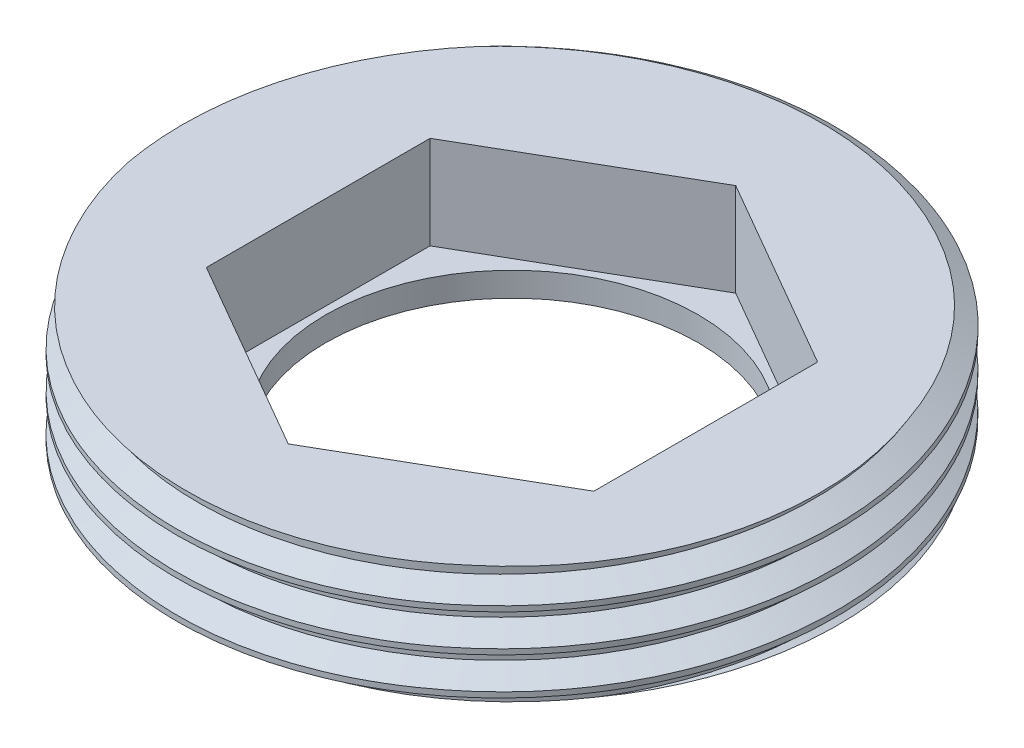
ISO-10303-21;
HEADER;
FILE_DESCRIPTION(('STEP AP214'),'2;1');
FILE_NAME('part.step','',(''),(''),'','','');
FILE_SCHEMA(('AUTOMOTIVE_DESIGN { 1 0 10303 214 1 1 1 1 }'));
ENDSEC;
DATA;
#1=APPLICATION_CONTEXT('core data for automotive mechanical design processes');
#2=APPLICATION_PROTOCOL_DEFINITION('international standard','automotive_design',2000,#1);
#3=PRODUCT_CONTEXT('',#1,'mechanical');
#4=PRODUCT('Part','Part','',(#3));
#5=PRODUCT_RELATED_PRODUCT_CATEGORY('part','',(#4));
#6=PRODUCT_DEFINITION_FORMATION('','',#4);
#7=PRODUCT_DEFINITION_CONTEXT('part definition',#1,'design');
#8=PRODUCT_DEFINITION('design','',#6,#7);
#9=PRODUCT_DEFINITION_SHAPE('','',#8);
#10=(LENGTH_UNIT() NAMED_UNIT(*) SI_UNIT(.MILLI.,.METRE.));
#11=(NAMED_UNIT(*) PLANE_ANGLE_UNIT() SI_UNIT($,.RADIAN.));
#12=(NAMED_UNIT(*) SI_UNIT($,.STERADIAN.) SOLID_ANGLE_UNIT());
#13=UNCERTAINTY_MEASURE_WITH_UNIT(LENGTH_MEASURE(1.E-05),#10,'distance_accuracy_value','');
#14=(GEOMETRIC_REPRESENTATION_CONTEXT(3) GLOBAL_UNCERTAINTY_ASSIGNED_CONTEXT((#13)) GLOBAL_UNIT_ASSIGNED_CONTEXT((#10,
#11,#12)) REPRESENTATION_CONTEXT('',''));
#15=CARTESIAN_POINT('',(0.,0.,0.));
#16=DIRECTION('',(0.,0.,1.));
#17=DIRECTION('',(1.,0.,0.));
#18=AXIS2_PLACEMENT_3D('',#15,#16,#17);
#19=CARTESIAN_POINT('',(0.,0.,0.));
#20=DIRECTION('',(0.,1.,0.));
#21=DIRECTION('',(1.,0.,0.));
#22=AXIS2_PLACEMENT_3D('',#19,#20,#21);
#23=PLANE('',#22);
#24=CARTESIAN_POINT('',(0.,0.,0.));
#25=DIRECTION('',(0.,-1.,0.));
#26=DIRECTION('',(1.,0.,0.));
#27=AXIS2_PLACEMENT_3D('',#24,#25,#26);
#28=CIRCLE('',#27,5.);
#29=CARTESIAN_POINT('',(-5.,0.,0.));
#30=VERTEX_POINT('',#29);
#31=EDGE_CURVE('E11',#30,#30,#28,.T.);
#32=ORIENTED_EDGE('',*,*,#31,.F.);
#33=EDGE_LOOP('',(#32));
#34=FACE_BOUND('',#33,.T.);
#35=CARTESIAN_POINT('',(-2.10003299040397,0.,7.99971667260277));
#36=CARTESIAN_POINT('',(-2.31314715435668,0.,7.95152558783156));
#37=CARTESIAN_POINT('',(-2.52397511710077,0.,7.89494513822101));
#38=CARTESIAN_POINT('',(-2.73200459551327,0.,7.83006043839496));
#39=CARTESIAN_POINT('',(-2.74895625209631,0.,7.82477319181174));
#40=CARTESIAN_POINT('',(-2.76588932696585,0.,7.819430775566));
#41=CARTESIAN_POINT('',(-2.78280354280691,0.,7.81403322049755));
#42=CARTESIAN_POINT('',(-2.98861446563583,0.,7.74835617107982));
#43=CARTESIAN_POINT('',(-3.19163390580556,0.,7.6745197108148));
#44=CARTESIAN_POINT('',(-3.39146771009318,0.,7.59286001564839));
#45=CARTESIAN_POINT('',(-3.59295748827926,0.,7.51052362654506));
#46=CARTESIAN_POINT('',(-3.7912092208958,0.,7.42023353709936));
#47=CARTESIAN_POINT('',(-3.98580423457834,0.,7.322283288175));
#48=CARTESIAN_POINT('',(-4.1804906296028,0.,7.2242870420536));
#49=CARTESIAN_POINT('',(-4.37151747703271,0.,7.11862310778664));
#50=CARTESIAN_POINT('',(-4.55844182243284,0.,7.00553917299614));
#51=CARTESIAN_POINT('',(-4.63705608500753,0.,6.95797977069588));
#52=CARTESIAN_POINT('',(-4.71494436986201,0.,6.90910740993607));
#53=CARTESIAN_POINT('',(-4.79207207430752,0.,6.85893828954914));
#54=CARTESIAN_POINT('',(-4.81401524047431,0.,6.84466495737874));
#55=CARTESIAN_POINT('',(-4.83589683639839,0.,6.83028665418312));
#56=CARTESIAN_POINT('',(-4.85771604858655,0.,6.81580373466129));
#57=CARTESIAN_POINT('',(-4.87842652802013,0.,6.8020567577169));
#58=CARTESIAN_POINT('',(-4.89907297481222,0.,6.78822071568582));
#59=CARTESIAN_POINT('',(-4.91965331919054,0.,6.7742971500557));
#60=CARTESIAN_POINT('',(-5.10081440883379,0.,6.65173319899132));
#61=CARTESIAN_POINT('',(-5.2768932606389,0.,6.52236596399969));
#62=CARTESIAN_POINT('',(-5.44750312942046,0.,6.38653291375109));
#63=CARTESIAN_POINT('',(-5.61892829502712,0.,6.25005075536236));
#64=CARTESIAN_POINT('',(-5.78483269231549,0.,6.10704051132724));
#65=CARTESIAN_POINT('',(-5.94480304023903,0.,5.95779646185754));
#66=CARTESIAN_POINT('',(-6.05731111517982,0.,5.85283225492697));
#67=CARTESIAN_POINT('',(-6.16688355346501,0.,5.74478355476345));
#68=CARTESIAN_POINT('',(-6.27336793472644,0.,5.63373992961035));
#69=CARTESIAN_POINT('',(-6.42448628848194,0.,5.47615128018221));
#70=CARTESIAN_POINT('',(-6.56938708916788,0.,5.31253212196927));
#71=CARTESIAN_POINT('',(-6.70784727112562,0.,5.1433232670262));
#72=CARTESIAN_POINT('',(-6.80199982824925,0.,5.02826169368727));
#73=CARTESIAN_POINT('',(-6.89317350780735,0.,4.9106146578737));
#74=CARTESIAN_POINT('',(-6.98128721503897,0.,4.7905124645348));
#75=CARTESIAN_POINT('',(-7.01983696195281,0.,4.73796775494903));
#76=CARTESIAN_POINT('',(-7.05780089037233,0.,4.68495303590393));
#77=CARTESIAN_POINT('',(-7.09517162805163,0.,4.63147888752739));
#78=CARTESIAN_POINT('',(-7.11918889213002,0.,4.59711235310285));
#79=CARTESIAN_POINT('',(-7.14296114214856,0.,4.56255605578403));
#80=CARTESIAN_POINT('',(-7.16648634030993,0.,4.52781276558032));
#81=CARTESIAN_POINT('',(-7.18198016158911,0.,4.50493064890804));
#82=CARTESIAN_POINT('',(-7.19736248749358,0.,4.4819737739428));
#83=CARTESIAN_POINT('',(-7.2126285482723,0.,4.45894976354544));
#84=CARTESIAN_POINT('',(-7.33826839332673,0.,4.26946190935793));
#85=CARTESIAN_POINT('',(-7.45613106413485,0.,4.07529108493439));
#86=CARTESIAN_POINT('',(-7.56603221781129,0.,3.87697826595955));
#87=CARTESIAN_POINT('',(-7.67325205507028,0.,3.68350378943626));
#88=CARTESIAN_POINT('',(-7.77289431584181,0.,3.48608618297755));
#89=CARTESIAN_POINT('',(-7.8647487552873,0.,3.28519041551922));
#90=CARTESIAN_POINT('',(-7.96004879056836,0.,3.0767587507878));
#91=CARTESIAN_POINT('',(-8.04696648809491,0.,2.86458260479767));
#92=CARTESIAN_POINT('',(-8.1252170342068,0.,2.64914963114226));
#93=CARTESIAN_POINT('',(-8.20346758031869,0.,2.43371665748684));
#94=CARTESIAN_POINT('',(-8.27305142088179,0.,2.21502614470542));
#95=CARTESIAN_POINT('',(-8.33362632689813,0.,1.9935440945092));
#96=CARTESIAN_POINT('',(-8.35722162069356,0.,1.90727183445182));
#97=CARTESIAN_POINT('',(-8.37944934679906,0.,1.82057584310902));
#98=CARTESIAN_POINT('',(-8.40030787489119,0.,1.73348843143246));
#99=CARTESIAN_POINT('',(-8.41717941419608,0.,1.66304728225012));
#100=CARTESIAN_POINT('',(-8.43315513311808,0.,1.59235004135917));
#101=CARTESIAN_POINT('',(-8.44823350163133,0.,1.52141374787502));
#102=CARTESIAN_POINT('',(-8.45475307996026,0.,1.49074234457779));
#103=CARTESIAN_POINT('',(-8.4611054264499,0.,1.46002328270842));
#104=CARTESIAN_POINT('',(-8.4672856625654,0.,1.42928229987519));
#105=CARTESIAN_POINT('',(-8.51058465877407,0.,1.21390967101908));
#106=CARTESIAN_POINT('',(-8.54549240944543,0.,0.997222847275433));
#107=CARTESIAN_POINT('',(-8.5721120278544,0.,0.779731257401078));
#108=CARTESIAN_POINT('',(-8.59907936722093,0.,0.559398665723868));
#109=CARTESIAN_POINT('',(-8.61754075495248,0.,0.338239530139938));
#110=CARTESIAN_POINT('',(-8.62755371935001,0.,0.116763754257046));
#111=CARTESIAN_POINT('',(-8.63763096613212,0.,-0.106133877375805));
#112=CARTESIAN_POINT('',(-8.63915104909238,0.,-0.329352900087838));
#113=CARTESIAN_POINT('',(-8.63212112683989,0.,-0.55238361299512));
#114=CARTESIAN_POINT('',(-8.62512284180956,0.,-0.774410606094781));
#115=CARTESIAN_POINT('',(-8.60965133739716,0.,-0.996251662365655));
#116=CARTESIAN_POINT('',(-8.5856623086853,0.,-1.2174037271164));
#117=CARTESIAN_POINT('',(-8.56673784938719,0.,-1.39186611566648));
#118=CARTESIAN_POINT('',(-8.54251167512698,0.,-1.56589983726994));
#119=CARTESIAN_POINT('',(-8.51293923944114,0.,-1.73925361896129));
#120=CARTESIAN_POINT('',(-8.50639688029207,0.,-1.77760496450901));
#121=CARTESIAN_POINT('',(-8.49959277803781,0.,-1.81592300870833));
#122=CARTESIAN_POINT('',(-8.49252631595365,0.,-1.85420498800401));
#123=CARTESIAN_POINT('',(-8.48778319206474,0.,-1.87990047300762));
#124=CARTESIAN_POINT('',(-8.48292328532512,0.,-1.90557193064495));
#125=CARTESIAN_POINT('',(-8.47794766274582,0.,-1.93121338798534));
#126=CARTESIAN_POINT('',(-8.45682896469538,0.,-2.04004684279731));
#127=CARTESIAN_POINT('',(-8.43362039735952,0.,-2.14836946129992));
#128=CARTESIAN_POINT('',(-8.40832882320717,0.,-2.25612045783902));
#129=CARTESIAN_POINT('',(-8.35765332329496,0.,-2.47201590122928));
#130=CARTESIAN_POINT('',(-8.29861880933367,0.,-2.68561670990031));
#131=CARTESIAN_POINT('',(-8.23155271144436,0.,-2.89652589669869));
#132=CARTESIAN_POINT('',(-8.16368356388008,0.,-3.10996051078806));
#133=CARTESIAN_POINT('',(-8.08758915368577,0.,-3.32063924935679));
#134=CARTESIAN_POINT('',(-8.00355547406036,0.,-3.52814445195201));
#135=CARTESIAN_POINT('',(-7.91907842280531,0.,-3.73674447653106));
#136=CARTESIAN_POINT('',(-7.8265778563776,0.,-3.94213800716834));
#137=CARTESIAN_POINT('',(-7.72629410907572,0.,-4.14388532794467));
#138=CARTESIAN_POINT('',(-7.63931231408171,0.,-4.31887224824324));
#139=CARTESIAN_POINT('',(-7.5464742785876,0.,-4.49111609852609));
#140=CARTESIAN_POINT('',(-7.44790869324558,0.,-4.66031516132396));
#141=CARTESIAN_POINT('',(-7.41010923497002,0.,-4.72520224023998));
#142=CARTESIAN_POINT('',(-7.37146717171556,0.,-4.78964135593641));
#143=CARTESIAN_POINT('',(-7.33198881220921,0.,-4.85361480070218));
#144=CARTESIAN_POINT('',(-7.30253686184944,0.,-4.90134076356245));
#145=CARTESIAN_POINT('',(-7.27261945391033,0.,-4.94880754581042));
#146=CARTESIAN_POINT('',(-7.24223902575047,0.,-4.99600763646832));
#147=CARTESIAN_POINT('',(-7.22632381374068,0.,-5.02073406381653));
#148=CARTESIAN_POINT('',(-7.21028605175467,0.,-5.0453802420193));
#149=CARTESIAN_POINT('',(-7.1941293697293,0.,-5.06994062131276));
#150=CARTESIAN_POINT('',(-7.06992681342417,0.,-5.25874559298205));
#151=CARTESIAN_POINT('',(-6.9386443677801,0.,-5.44256919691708));
#152=CARTESIAN_POINT('',(-6.80054671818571,0.,-5.62098959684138));
#153=CARTESIAN_POINT('',(-6.6772861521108,0.,-5.78024067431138));
#154=CARTESIAN_POINT('',(-6.54859532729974,0.,-5.93518728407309));
#155=CARTESIAN_POINT('',(-6.414631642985,0.,-6.08551270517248));
#156=(BOUNDED_CURVE() B_SPLINE_CURVE(3,(#35,#36,#37,#38,#39,#40,#41,#42,#43,#44,#45,#46,#47,#48,
#49,#50,#51,#52,#53,#54,#55,#56,#57,#58,#59,#60,#61,#62,#63,#64,#65,#66,#67,#68,#69,#70,#71,#72,
#73,#74,#75,#76,#77,#78,#79,#80,#81,#82,#83,#84,#85,#86,#87,#88,#89,#90,#91,#92,#93,#94,#95,#96,
#97,#98,#99,#100,#101,#102,#103,#104,#105,#106,#107,#108,#109,#110,#111,#112,#113,#114,#115,
#116,#117,#118,#119,#120,#121,#122,#123,#124,#125,#126,#127,#128,#129,#130,#131,#132,#133,#134,
#135,#136,#137,#138,#139,#140,#141,#142,#143,#144,#145,#146,#147,#148,#149,#150,#151,#152,#153,
#154,#155),.UNSPECIFIED.,.F.,.F.) B_SPLINE_CURVE_WITH_KNOTS((4,3,3,3,3,3,3,3,3,3,3,3,3,3,3,3,3,
3,3,3,3,3,3,3,3,3,3,3,3,3,3,3,3,3,3,3,3,3,3,3,4),(-0.303002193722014,-0.237369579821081,
-0.232021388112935,-0.166944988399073,-0.101329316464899,-0.0356828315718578,
-0.00807406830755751,-0.000219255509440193,0.0072364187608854,0.0728659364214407,
0.138809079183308,0.185187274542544,0.251005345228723,0.295761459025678,0.315342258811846,
0.327926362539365,0.336214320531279,0.40442430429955,0.470970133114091,0.540012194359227,
0.609054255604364,0.635947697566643,0.657700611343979,0.667106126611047,0.733001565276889,
0.799757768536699,0.866942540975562,0.933824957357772,0.986587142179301,0.998259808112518,
1.0060946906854,1.03934932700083,1.10598002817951,1.17340856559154,1.24119286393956,
1.29998603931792,1.322532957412,1.33935358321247,1.34816530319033,1.41590434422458,
1.47636556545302),
.UNSPECIFIED.) CURVE() GEOMETRIC_REPRESENTATION_ITEM() RATIONAL_B_SPLINE_CURVE((1.,1.,1.,1.,1.,
1.,1.,1.,1.,1.,1.,1.,1.,1.,1.,1.,1.,1.,1.,1.,1.,1.,1.,1.,1.,1.,1.,1.,1.,1.,1.,1.,1.,1.,1.,1.,1.,
1.,1.,1.,1.,1.,1.,1.,1.,1.,1.,1.,1.,1.,1.,1.,1.,1.,1.,1.,1.,1.,1.,1.,1.,1.,1.,1.,1.,1.,1.,1.,1.,
1.,1.,1.,1.,1.,1.,1.,1.,1.,1.,1.,1.,1.,1.,1.,1.,1.,1.,1.,1.,1.,1.,1.,1.,1.,1.,1.,1.,1.,1.,1.,1.,
1.,1.,1.,1.,1.,1.,1.,1.,1.,1.,1.,1.,1.,1.,1.,1.,1.,1.,1.,1.)) REPRESENTATION_ITEM(''));
#157=CARTESIAN_POINT('',(-2.1000329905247,0.,7.99971667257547));
#158=VERTEX_POINT('',#157);
#159=CARTESIAN_POINT('',(-6.414631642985,0.,-6.08551270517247));
#160=VERTEX_POINT('',#159);
#161=EDGE_CURVE('E741',#158,#160,#156,.T.);
#162=ORIENTED_EDGE('',*,*,#161,.T.);
#163=CARTESIAN_POINT('',(0.,0.,0.));
#164=DIRECTION('',(0.,1.,0.));
#165=DIRECTION('',(1.,0.,0.));
#166=AXIS2_PLACEMENT_3D('',#163,#164,#165);
#167=CIRCLE('',#166,8.842);
#168=CARTESIAN_POINT('',(0.759058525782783,0.,-8.80804749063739));
#169=VERTEX_POINT('',#168);
#170=EDGE_CURVE('E292',#169,#160,#167,.T.);
#171=ORIENTED_EDGE('',*,*,#170,.F.);
#172=CARTESIAN_POINT('',(0.759058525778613,5.54608511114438E-11,-8.80804749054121));
#173=CARTESIAN_POINT('',(0.887331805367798,5.11500153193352E-11,-8.79268458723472));
#174=CARTESIAN_POINT('',(1.01528636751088,4.55109374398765E-11,-8.7745568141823));
#175=CARTESIAN_POINT('',(1.14282300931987,3.93612017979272E-11,-8.75367920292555));
#176=CARTESIAN_POINT('',(1.36702124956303,2.85505054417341E-11,-8.71697819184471));
#177=CARTESIAN_POINT('',(1.58992937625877,1.61412099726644E-11,-8.67178214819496));
#178=CARTESIAN_POINT('',(1.81099415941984,6.87231521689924E-12,-8.61813455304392));
#179=CARTESIAN_POINT('',(1.97634110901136,0.,-8.57800845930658));
#180=CARTESIAN_POINT('',(2.1406565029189,-5.22853776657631E-12,-8.53315318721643));
#181=CARTESIAN_POINT('',(2.30372173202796,-6.50876227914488E-12,-8.48358958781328));
#182=CARTESIAN_POINT('',(2.37851596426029,-7.09599161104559E-12,-8.46085591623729));
#183=CARTESIAN_POINT('',(2.45295698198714,-7.63000928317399E-12,-8.43715887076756));
#184=CARTESIAN_POINT('',(2.52702582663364,-8.14104339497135E-12,-8.41250634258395));
#185=CARTESIAN_POINT('',(2.74142786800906,-9.62029904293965E-12,-8.34114634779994));
#186=CARTESIAN_POINT('',(2.95271257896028,-1.09377593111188E-11,-8.261784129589));
#187=CARTESIAN_POINT('',(3.16041214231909,-1.25998794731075E-11,-8.17457684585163));
#188=CARTESIAN_POINT('',(3.36778243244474,-1.42593646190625E-11,-8.08750781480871));
#189=CARTESIAN_POINT('',(3.57157956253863,-1.62630396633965E-11,-7.99261834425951));
#190=CARTESIAN_POINT('',(3.77131844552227,-1.87352355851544E-11,-7.89001690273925));
#191=CARTESIAN_POINT('',(3.96952321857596,-2.11884436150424E-11,-7.78820349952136));
#192=CARTESIAN_POINT('',(4.16373242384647,-2.41026063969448E-11,-7.67879588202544));
#193=CARTESIAN_POINT('',(4.35344389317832,-2.72245975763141E-11,-7.5618564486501));
#194=CARTESIAN_POINT('',(4.53893224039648,-3.02770908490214E-11,-7.44752017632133));
#195=CARTESIAN_POINT('',(4.72012130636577,-3.35272385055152E-11,-7.32598337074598));
#196=CARTESIAN_POINT('',(4.89650734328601,-3.63750141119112E-11,-7.19726683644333));
#197=CARTESIAN_POINT('',(4.94155704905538,-3.71023478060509E-11,-7.164392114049));
#198=CARTESIAN_POINT('',(4.98629324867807,-3.78021087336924E-11,-7.1310488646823));
#199=CARTESIAN_POINT('',(5.03071120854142,-3.84595827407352E-11,-7.0972434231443));
#200=CARTESIAN_POINT('',(5.05157831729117,-3.87684573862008E-11,-7.08136196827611));
#201=CARTESIAN_POINT('',(5.07237613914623,-3.90680871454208E-11,-7.06537776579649));
#202=CARTESIAN_POINT('',(5.0931012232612,-3.93566151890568E-11,-7.04929375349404));
#203=CARTESIAN_POINT('',(5.11318690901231,-3.96362417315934E-11,-7.03370595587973));
#204=CARTESIAN_POINT('',(5.13319785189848,-3.99032507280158E-11,-7.01802941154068));
#205=CARTESIAN_POINT('',(5.15313377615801,-4.0160083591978E-11,-7.00226492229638));
#206=CARTESIAN_POINT('',(5.18406688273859,-4.05585922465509E-11,-6.9778043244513));
#207=CARTESIAN_POINT('',(5.21481938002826,-4.09318958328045E-11,-6.95313199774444));
#208=CARTESIAN_POINT('',(5.24539021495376,-4.12838235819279E-11,-6.92825089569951));
#209=CARTESIAN_POINT('',(5.35926704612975,-4.25947598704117E-11,-6.83556840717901));
#210=CARTESIAN_POINT('',(5.47062362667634,-4.36220858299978E-11,-6.73998970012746));
#211=CARTESIAN_POINT('',(5.57940193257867,-4.45745801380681E-11,-6.64166157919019));
#212=CARTESIAN_POINT('',(5.74360636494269,-4.60124016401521E-11,-6.49323204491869));
#213=CARTESIAN_POINT('',(5.90193742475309,-4.72983980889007E-11,-6.33853907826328));
#214=CARTESIAN_POINT('',(6.05416847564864,-4.88275392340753E-11,-6.17805251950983));
#215=CARTESIAN_POINT('',(6.20791896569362,-5.03719429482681E-11,-6.01596412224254));
#216=CARTESIAN_POINT('',(6.35544748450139,-5.21666473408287E-11,-5.84796534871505));
#217=CARTESIAN_POINT('',(6.4964821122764,-5.42123013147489E-11,-5.67450486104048));
#218=CARTESIAN_POINT('',(6.63790556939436,-5.62635951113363E-11,-5.50056614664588));
#219=CARTESIAN_POINT('',(6.77279966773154,-5.85678958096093E-11,-5.32113495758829));
#220=CARTESIAN_POINT('',(6.90084578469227,-6.0698224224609E-11,-5.1366370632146));
#221=CARTESIAN_POINT('',(7.02777952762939,-6.28100458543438E-11,-4.95374195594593));
#222=CARTESIAN_POINT('',(7.14798405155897,-6.47512563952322E-11,-4.76586717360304));
#223=CARTESIAN_POINT('',(7.26110035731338,-6.56758536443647E-11,-4.57341055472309));
#224=CARTESIAN_POINT('',(7.27433202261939,-6.57840074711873E-11,-4.55089813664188));
#225=CARTESIAN_POINT('',(7.28746854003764,-6.58769164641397E-11,-4.52831968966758));
#226=CARTESIAN_POINT('',(7.30050124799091,-6.59545473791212E-11,-4.50568988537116));
#227=CARTESIAN_POINT('',(7.38720558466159,-6.64710123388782E-11,-4.35513773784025));
#228=CARTESIAN_POINT('',(7.46933508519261,-6.63164915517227E-11,-4.20228553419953));
#229=CARTESIAN_POINT('',(7.54677967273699,-6.59204912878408E-11,-4.04735112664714));
#230=CARTESIAN_POINT('',(7.63528777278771,-6.54679195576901E-11,-3.87028323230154));
#231=CARTESIAN_POINT('',(7.71767750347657,-6.47053501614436E-11,-3.69049577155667));
#232=CARTESIAN_POINT('',(7.7937585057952,-6.40252850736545E-11,-3.50829779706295));
#233=CARTESIAN_POINT('',(7.88070822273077,-6.32480678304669E-11,-3.30007154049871));
#234=CARTESIAN_POINT('',(7.95941930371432,-6.25873356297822E-11,-3.0886967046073));
#235=CARTESIAN_POINT('',(8.02955850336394,-6.21846463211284E-11,-2.87461545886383));
#236=CARTESIAN_POINT('',(8.09708647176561,-6.17969488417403E-11,-2.66850430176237));
#237=CARTESIAN_POINT('',(8.15666894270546,-6.16464702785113E-11,-2.45988385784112));
#238=CARTESIAN_POINT('',(8.20795785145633,-6.14371054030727E-11,-2.24913914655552));
#239=CARTESIAN_POINT('',(8.25824597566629,-6.12318257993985E-11,-2.04250663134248));
#240=CARTESIAN_POINT('',(8.30056118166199,-6.09692501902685E-11,-1.83383142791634));
#241=CARTESIAN_POINT('',(8.33452437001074,-5.99686966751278E-11,-1.62347536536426));
#242=CARTESIAN_POINT('',(8.34288648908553,-5.97223494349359E-11,-1.57168333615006));
#243=CARTESIAN_POINT('',(8.35074205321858,-5.94297501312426E-11,-1.51978942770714));
#244=CARTESIAN_POINT('',(8.35809202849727,-5.90761883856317E-11,-1.4678003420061));
#245=CARTESIAN_POINT('',(8.36123587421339,-5.89249574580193E-11,-1.44556276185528));
#246=CARTESIAN_POINT('',(8.36428754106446,-5.87620101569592E-11,-1.42330530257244));
#247=CARTESIAN_POINT('',(8.36724597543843,-5.85873294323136E-11,-1.40103699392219));
#248=CARTESIAN_POINT('',(8.3708503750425,-5.83745076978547E-11,-1.37390646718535));
#249=CARTESIAN_POINT('',(8.37431590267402,-5.8144407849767E-11,-1.34676372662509));
#250=CARTESIAN_POINT('',(8.3776430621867,-5.78977144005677E-11,-1.31960975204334));
#251=CARTESIAN_POINT('',(8.3827871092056,-5.75163071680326E-11,-1.27762759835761));
#252=CARTESIAN_POINT('',(8.38760041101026,-5.70968716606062E-11,-1.23561859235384));
#253=CARTESIAN_POINT('',(8.39208476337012,-5.66477698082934E-11,-1.19358633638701));
#254=CARTESIAN_POINT('',(8.40741597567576,-5.51123695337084E-11,-1.04988544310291));
#255=CARTESIAN_POINT('',(8.41890312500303,-5.32332473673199E-11,-0.905912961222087));
#256=CARTESIAN_POINT('',(8.42661098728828,-5.12674347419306E-11,-0.761811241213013));
#257=CARTESIAN_POINT('',(8.43817987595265,-4.83169062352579E-11,-0.545526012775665));
#258=CARTESIAN_POINT('',(8.44123726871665,-4.51921998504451E-11,-0.328949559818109));
#259=CARTESIAN_POINT('',(8.43595807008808,-4.23989177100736E-11,-0.112557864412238));
#260=CARTESIAN_POINT('',(8.4306254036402,-3.95773451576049E-11,0.106025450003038));
#261=CARTESIAN_POINT('',(8.41678632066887,-3.70960936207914E-11,0.324420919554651));
#262=CARTESIAN_POINT('',(8.39456891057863,-3.50164619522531E-11,0.542135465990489));
#263=CARTESIAN_POINT('',(8.37227607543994,-3.29297702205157E-11,0.760589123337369));
#264=CARTESIAN_POINT('',(8.34154777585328,-3.12481729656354E-11,0.978357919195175));
#265=CARTESIAN_POINT('',(8.30246317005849,-2.95514168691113E-11,1.19493093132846));
#266=CARTESIAN_POINT('',(8.26369563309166,-2.78684254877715E-11,1.40974702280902));
#267=CARTESIAN_POINT('',(8.21670658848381,-2.61710092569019E-11,1.62338729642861));
#268=CARTESIAN_POINT('',(8.16152695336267,-2.35623187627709E-11,1.83533066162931));
#269=CARTESIAN_POINT('',(8.12119762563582,-2.16557151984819E-11,1.99023443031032));
#270=CARTESIAN_POINT('',(8.07660509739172,-1.92291400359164E-11,2.14379757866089));
#271=CARTESIAN_POINT('',(8.02781639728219,-1.67336144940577E-11,2.29583383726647));
#272=CARTESIAN_POINT('',(7.96117673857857,-1.33250184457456E-11,2.50349758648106));
#273=CARTESIAN_POINT('',(7.88671038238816,-9.80679543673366E-12,2.70831358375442));
#274=CARTESIAN_POINT('',(7.80454398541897,-6.91408041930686E-12,2.9097975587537));
#275=CARTESIAN_POINT('',(7.72263733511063,-4.03050993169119E-12,3.11064459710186));
#276=CARTESIAN_POINT('',(7.63307902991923,-1.7689590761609E-12,3.30818130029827));
#277=CARTESIAN_POINT('',(7.53594689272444,-3.65540930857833E-13,3.50190781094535));
#278=CARTESIAN_POINT('',(7.43971269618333,1.02490327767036E-12,3.69384341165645));
#279=CARTESIAN_POINT('',(7.33604381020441,1.57288808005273E-12,3.88203953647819));
#280=CARTESIAN_POINT('',(7.2249726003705,1.53077550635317E-12,4.06598099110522));
#281=CARTESIAN_POINT('',(7.11676680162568,1.48974935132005E-12,4.24517713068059));
#282=CARTESIAN_POINT('',(7.00153536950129,8.90695610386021E-13,4.42033572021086));
#283=CARTESIAN_POINT('',(6.87927116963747,4.22550883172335E-13,4.59094536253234));
#284=(BOUNDED_CURVE() B_SPLINE_CURVE(3,(#172,#173,#174,#175,#176,#177,#178,#179,#180,#181,#182,
#183,#184,#185,#186,#187,#188,#189,#190,#191,#192,#193,#194,#195,#196,#197,#198,#199,#200,#201,
#202,#203,#204,#205,#206,#207,#208,#209,#210,#211,#212,#213,#214,#215,#216,#217,#218,#219,#220,
#221,#222,#223,#224,#225,#226,#227,#228,#229,#230,#231,#232,#233,#234,#235,#236,#237,#238,#239,
#240,#241,#242,#243,#244,#245,#246,#247,#248,#249,#250,#251,#252,#253,#254,#255,#256,#257,#258,
#259,#260,#261,#262,#263,#264,#265,#266,#267,#268,#269,#270,#271,#272,#273,#274,#275,#276,#277,
#278,#279,#280,#281,#282,#283),.UNSPECIFIED.,.F.,.F.) B_SPLINE_CURVE_WITH_KNOTS((4,3,3,3,3,3,3,
3,3,3,3,3,3,3,3,3,3,3,3,3,3,3,3,3,3,3,3,3,3,3,3,3,3,3,3,3,3,4),(-2.43293728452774,
-2.39415866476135,-2.32598924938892,-2.2750014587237,-2.25161524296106,-2.18392075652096,
-2.11633358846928,-2.04926552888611,-1.98369045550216,-1.96694231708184,-1.95907421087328,
-1.95144884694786,-1.93961713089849,-1.89554380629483,-1.82901367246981,-1.76181949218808,
-1.69444005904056,-1.62764597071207,-1.61983279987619,-1.56785313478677,-1.508447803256,
-1.44055599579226,-1.3751917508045,-1.3111029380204,-1.29532355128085,-1.28857414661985,
-1.28035102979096,-1.26763745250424,-1.22417196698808,-1.15893372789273,-1.09303475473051,
-1.02691206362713,-0.961325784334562,-0.913390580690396,-0.847916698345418,-0.782649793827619,
-0.717986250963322,-0.654990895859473),
.UNSPECIFIED.) CURVE() GEOMETRIC_REPRESENTATION_ITEM() RATIONAL_B_SPLINE_CURVE((1.,1.,1.,1.,1.,
1.,1.,1.,1.,1.,1.,1.,1.,1.,1.,1.,1.,1.,1.,1.,1.,1.,1.,1.,1.,1.,1.,1.,1.,1.,1.,1.,1.,1.,1.,1.,1.,
1.,1.,1.,1.,1.,1.,1.,1.,1.,1.,1.,1.,1.,1.,1.,1.,1.,1.,1.,1.,1.,1.,1.,1.,1.,1.,1.,1.,1.,1.,1.,1.,
1.,1.,1.,1.,1.,1.,1.,1.,1.,1.,1.,1.,1.,1.,1.,1.,1.,1.,1.,1.,1.,1.,1.,1.,1.,1.,1.,1.,1.,1.,1.,1.,
1.,1.,1.,1.,1.,1.,1.,1.,1.,1.,1.)) REPRESENTATION_ITEM(''));
#285=CARTESIAN_POINT('',(6.87927208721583,0.,4.5909460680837));
#286=VERTEX_POINT('',#285);
#287=EDGE_CURVE('E271',#169,#286,#284,.T.);
#288=ORIENTED_EDGE('',*,*,#287,.T.);
#289=CARTESIAN_POINT('',(0.,0.,0.));
#290=DIRECTION('',(0.,-1.,0.));
#291=DIRECTION('',(1.,0.,0.));
#292=AXIS2_PLACEMENT_3D('',#289,#290,#291);
#293=CIRCLE('',#292,8.2705);
#294=EDGE_CURVE('E738',#286,#158,#293,.T.);
#295=ORIENTED_EDGE('',*,*,#294,.T.);
#296=EDGE_LOOP('',(#162,#171,#288,#295));
#297=FACE_BOUND('',#296,.T.);
#298=ADVANCED_FACE('F17',(#34,#297),#23,.F.);
#299=CARTESIAN_POINT('',(0.,0.,0.));
#300=DIRECTION('',(0.,1.,0.));
#301=DIRECTION('',(-0.995797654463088,0.,0.0915807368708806));
#302=AXIS2_PLACEMENT_3D('',#299,#300,#301);
#303=CYLINDRICAL_SURFACE('',#302,8.842);
#304=DIRECTION('',(0.,-1.,0.));
#305=VECTOR('',#304,1.);
#306=CARTESIAN_POINT('',(-8.842,0.,0.));
#307=LINE('',#306,#305);
#308=CARTESIAN_POINT('',(-8.842,3.15,0.));
#309=VERTEX_POINT('',#308);
#310=CARTESIAN_POINT('',(-8.84128663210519,3.12081054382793,-5.7343386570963E-05));
#311=VERTEX_POINT('',#310);
#312=EDGE_CURVE('E362',#309,#311,#307,.T.);
#313=ORIENTED_EDGE('',*,*,#312,.T.);
#314=CARTESIAN_POINT('',(5.5994279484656,3.47995567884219,6.84305272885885));
#315=CARTESIAN_POINT('',(4.4659070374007,3.4535923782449,7.77057278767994));
#316=CARTESIAN_POINT('',(1.73021478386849,3.40086577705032,9.05057862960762));
#317=CARTESIAN_POINT('',(-2.7943901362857,3.32177587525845,8.78031332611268));
#318=CARTESIAN_POINT('',(-6.64198701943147,3.24268597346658,6.38632627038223));
#319=CARTESIAN_POINT('',(-8.88335150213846,3.16359607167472,2.44731608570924));
#320=CARTESIAN_POINT('',(-8.97553154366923,3.08450616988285,-2.08364692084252));
#321=CARTESIAN_POINT('',(-6.89660572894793,3.00541626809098,-6.11059745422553));
#322=CARTESIAN_POINT('',(-3.14928828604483,2.92632636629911,-8.65934284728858));
#323=CARTESIAN_POINT('',(1.35982796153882,2.84723646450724,-9.11335246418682));
#324=CARTESIAN_POINT('',(5.54001015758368,2.76814656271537,-7.3627860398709));
#325=CARTESIAN_POINT('',(8.38002432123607,2.68905666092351,-3.8311219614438));
#326=CARTESIAN_POINT('',(9.19286702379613,2.60996675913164,0.627313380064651));
#327=CARTESIAN_POINT('',(7.7819008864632,2.53087685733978,4.9339975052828));
#328=CARTESIAN_POINT('',(4.48844971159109,2.4517869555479,8.04711985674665));
#329=CARTESIAN_POINT('',(0.109216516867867,2.37269705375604,9.21359802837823));
#330=CARTESIAN_POINT('',(-4.29643651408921,2.29360715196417,8.15125452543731));
#331=CARTESIAN_POINT('',(-7.66275725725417,2.2145172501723,5.117076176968));
#332=CARTESIAN_POINT('',(-9.17541339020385,2.13542734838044,0.845048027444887));
#333=CARTESIAN_POINT('',(-8.46848489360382,2.05633744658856,-3.63140205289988));
#334=CARTESIAN_POINT('',(-5.71298174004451,1.9772475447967,-7.22939532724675));
#335=CARTESIAN_POINT('',(-1.57547583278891,1.89815764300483,-9.07855677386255));
#336=CARTESIAN_POINT('',(2.94314663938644,1.81906774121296,-8.73156372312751));
#337=CARTESIAN_POINT('',(6.74980520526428,1.73997783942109,-6.27235576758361));
#338=CARTESIAN_POINT('',(8.92364751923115,1.66088793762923,-2.29582929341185));
#339=CARTESIAN_POINT('',(8.93880876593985,1.58179803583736,2.23607134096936));
#340=CARTESIAN_POINT('',(6.79162135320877,1.50270813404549,6.22705360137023));
#341=CARTESIAN_POINT('',(3.00150212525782,1.42361823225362,8.71167620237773));
#342=CARTESIAN_POINT('',(-1.51469753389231,1.34452833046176,9.08889478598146));
#343=CARTESIAN_POINT('',(-5.6644832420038,1.26543842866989,7.26745808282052));
#344=CARTESIAN_POINT('',(-8.44399826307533,1.18634852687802,3.68798188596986));
#345=CARTESIAN_POINT('',(-9.18086207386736,1.10725862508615,-0.783637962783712));
#346=CARTESIAN_POINT('',(-7.69682320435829,1.02816872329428,-5.06569159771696));
#347=CARTESIAN_POINT('',(-4.35087894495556,0.949078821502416,-8.12232511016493));
#348=CARTESIAN_POINT('',(0.0475674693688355,0.869988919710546,-9.21412304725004));
#349=CARTESIAN_POINT('',(4.4345074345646,0.790899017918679,-8.07697015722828));
#350=CARTESIAN_POINT('',(7.74871406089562,0.711809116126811,-4.98595639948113));
#351=CARTESIAN_POINT('',(9.18846425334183,0.632719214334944,-0.688803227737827));
#352=CARTESIAN_POINT('',(8.40546962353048,0.553629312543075,3.77495902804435));
#353=CARTESIAN_POINT('',(5.58915023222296,0.474539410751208,7.32556970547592));
#354=CARTESIAN_POINT('',(1.42077144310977,0.39544950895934,9.10401886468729));
#355=CARTESIAN_POINT('',(-3.09127580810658,0.316359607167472,8.68028247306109));
#356=CARTESIAN_POINT('',(-6.85557414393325,0.237269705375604,6.15648097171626));
#357=CARTESIAN_POINT('',(-8.96137274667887,0.158179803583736,2.14390224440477));
#358=CARTESIAN_POINT('',(-8.89957415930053,0.0790899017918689,-2.38834597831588));
#359=CARTESIAN_POINT('',(-7.42266945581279,0.0263633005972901,-5.02295782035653));
#360=CARTESIAN_POINT('',(-6.414631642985,0.,-6.08551270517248));
#361=(BOUNDED_CURVE() B_SPLINE_CURVE(3,(#314,#315,#316,#317,#318,#319,#320,#321,#322,#323,#324,
#325,#326,#327,#328,#329,#330,#331,#332,#333,#334,#335,#336,#337,#338,#339,#340,#341,#342,#343,
#344,#345,#346,#347,#348,#349,#350,#351,#352,#353,#354,#355,#356,#357,#358,#359,#360),
.UNSPECIFIED.,.F.,.F.) B_SPLINE_CURVE_WITH_KNOTS((4,1,1,1,1,1,1,1,1,1,1,1,1,1,1,1,1,1,1,1,1,1,1,
1,1,1,1,1,1,1,1,1,1,1,1,1,1,1,1,1,1,1,1,1,4),(8.66570292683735,9.16263943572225,
9.65957594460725,10.1565124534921,10.653448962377,11.150385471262,11.6473219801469,
12.1442584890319,12.6411949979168,13.1381315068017,13.6350680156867,14.1320045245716,
14.6289410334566,15.1258775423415,15.6228140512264,16.1197505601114,16.6166870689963,
17.1136235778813,17.6105600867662,18.1074965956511,18.6044331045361,19.101369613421,
19.598306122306,20.0952426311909,20.5921791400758,21.0891156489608,21.5860521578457,
22.0829886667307,22.5799251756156,23.0768616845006,23.5737981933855,24.0707347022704,
24.5676712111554,25.0646077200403,25.5615442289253,26.0584807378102,26.5554172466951,
27.0523537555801,27.549290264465,28.04622677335,28.5431632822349,29.0400997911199,
29.5370363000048,30.0339728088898,30.5309093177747),
.UNSPECIFIED.) CURVE() GEOMETRIC_REPRESENTATION_ITEM() RATIONAL_B_SPLINE_CURVE((1.,1.,1.,1.,1.,
1.,1.,1.,1.,1.,1.,1.,1.,1.,1.,1.,1.,1.,1.,1.,1.,1.,1.,1.,1.,1.,1.,1.,1.,1.,1.,1.,1.,1.,1.,1.,1.,
1.,1.,1.,1.,1.,1.,1.,1.,1.,1.)) REPRESENTATION_ITEM(''));
#362=CARTESIAN_POINT('',(-8.69395512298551,3.15,1.6128166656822));
#363=VERTEX_POINT('',#362);
#364=EDGE_CURVE('E277',#311,#363,#361,.F.);
#365=ORIENTED_EDGE('',*,*,#364,.T.);
#366=CARTESIAN_POINT('',(0.,3.15,0.));
#367=DIRECTION('',(0.,1.,0.));
#368=DIRECTION('',(1.,0.,0.));
#369=AXIS2_PLACEMENT_3D('',#366,#367,#368);
#370=CIRCLE('',#369,8.842);
#371=EDGE_CURVE('E252',#309,#363,#370,.T.);
#372=ORIENTED_EDGE('',*,*,#371,.F.);
#373=EDGE_LOOP('',(#313,#365,#372));
#374=FACE_BOUND('',#373,.T.);
#375=ADVANCED_FACE('F384',(#374),#303,.T.);
#376=CARTESIAN_POINT('',(0.,0.,0.));
#377=DIRECTION('',(0.,1.,0.));
#378=DIRECTION('',(1.,0.,0.));
#379=AXIS2_PLACEMENT_3D('',#376,#377,#378);
#380=CYLINDRICAL_SURFACE('',#379,5.);
#381=CARTESIAN_POINT('',(0.,0.65,0.));
#382=DIRECTION('',(0.,1.,0.));
#383=DIRECTION('',(1.,0.,0.));
#384=AXIS2_PLACEMENT_3D('',#381,#382,#383);
#385=CIRCLE('',#384,5.);
#386=CARTESIAN_POINT('',(-5.,0.65,0.));
#387=VERTEX_POINT('',#386);
#388=EDGE_CURVE('E224',#387,#387,#385,.T.);
#389=ORIENTED_EDGE('',*,*,#388,.T.);
#390=DIRECTION('',(0.,-1.,0.));
#391=VECTOR('',#390,1.);
#392=CARTESIAN_POINT('',(-5.,0.,0.));
#393=LINE('',#392,#391);
#394=EDGE_CURVE('E30',#387,#30,#393,.T.);
#395=ORIENTED_EDGE('',*,*,#394,.T.);
#396=ORIENTED_EDGE('',*,*,#31,.T.);
#397=ORIENTED_EDGE('',*,*,#394,.F.);
#398=EDGE_LOOP('',(#389,#395,#396,#397));
#399=FACE_BOUND('',#398,.T.);
#400=ADVANCED_FACE('F394',(#399),#380,.F.);
#401=CARTESIAN_POINT('',(0.,3.15,0.));
#402=DIRECTION('',(0.,1.,0.));
#403=DIRECTION('',(1.,0.,0.));
#404=AXIS2_PLACEMENT_3D('',#401,#402,#403);
#405=PLANE('',#404);
#406=DIRECTION('',(0.866025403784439,0.,0.5));
#407=VECTOR('',#406,1.);
#408=CARTESIAN_POINT('',(1.3,3.15,-5.25388744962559));
#409=LINE('',#408,#407);
#410=CARTESIAN_POINT('',(0.,3.15,-6.00444279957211));
#411=VERTEX_POINT('',#410);
#412=CARTESIAN_POINT('',(5.2,3.15,-3.00222139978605));
#413=VERTEX_POINT('',#412);
#414=EDGE_CURVE('E196',#411,#413,#409,.T.);
#415=ORIENTED_EDGE('',*,*,#414,.T.);
#416=DIRECTION('',(0.,0.,1.));
#417=VECTOR('',#416,1.);
#418=CARTESIAN_POINT('',(5.2,3.15,-1.50111069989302));
#419=LINE('',#418,#417);
#420=CARTESIAN_POINT('',(5.2,3.15,3.00222139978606));
#421=VERTEX_POINT('',#420);
#422=EDGE_CURVE('E226',#413,#421,#419,.T.);
#423=ORIENTED_EDGE('',*,*,#422,.T.);
#424=DIRECTION('',(-0.866025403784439,0.,0.5));
#425=VECTOR('',#424,1.);
#426=CARTESIAN_POINT('',(3.9,3.15,3.75277674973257));
#427=LINE('',#426,#425);
#428=CARTESIAN_POINT('',(0.,3.15,6.00444279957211));
#429=VERTEX_POINT('',#428);
#430=EDGE_CURVE('E232',#421,#429,#427,.T.);
#431=ORIENTED_EDGE('',*,*,#430,.T.);
#432=DIRECTION('',(-0.866025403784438,0.,-0.5));
#433=VECTOR('',#432,1.);
#434=CARTESIAN_POINT('',(-1.3,3.15,5.25388744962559));
#435=LINE('',#434,#433);
#436=CARTESIAN_POINT('',(-5.2,3.15,3.00222139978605));
#437=VERTEX_POINT('',#436);
#438=EDGE_CURVE('E236',#429,#437,#435,.T.);
#439=ORIENTED_EDGE('',*,*,#438,.T.);
#440=DIRECTION('',(0.,0.,-1.));
#441=VECTOR('',#440,1.);
#442=CARTESIAN_POINT('',(-5.2,3.15,1.50111069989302));
#443=LINE('',#442,#441);
#444=CARTESIAN_POINT('',(-5.2,3.15,-3.00222139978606));
#445=VERTEX_POINT('',#444);
#446=EDGE_CURVE('E150',#437,#445,#443,.T.);
#447=ORIENTED_EDGE('',*,*,#446,.T.);
#448=DIRECTION('',(0.866025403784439,0.,-0.5));
#449=VECTOR('',#448,1.);
#450=CARTESIAN_POINT('',(-3.9,3.15,-3.75277674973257));
#451=LINE('',#450,#449);
#452=EDGE_CURVE('E191',#445,#411,#451,.T.);
#453=ORIENTED_EDGE('',*,*,#452,.T.);
#454=EDGE_LOOP('',(#415,#423,#431,#439,#447,#453));
#455=FACE_BOUND('',#454,.T.);
#456=CARTESIAN_POINT('',(-8.69395512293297,3.15,1.61281666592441));
#457=CARTESIAN_POINT('',(-8.6777301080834,3.15,1.6876227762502));
#458=CARTESIAN_POINT('',(-8.66052150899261,3.15,1.76225582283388));
#459=CARTESIAN_POINT('',(-8.64232472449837,3.15,1.83669592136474));
#460=CARTESIAN_POINT('',(-8.63631156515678,3.15,1.86129478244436));
#461=CARTESIAN_POINT('',(-8.63019271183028,3.15,1.88586346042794));
#462=CARTESIAN_POINT('',(-8.62396878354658,3.15,1.91039913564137));
#463=CARTESIAN_POINT('',(-8.5871414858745,3.15,2.0555779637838));
#464=CARTESIAN_POINT('',(-8.54663016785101,3.15,2.19962594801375));
#465=CARTESIAN_POINT('',(-8.50244887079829,3.15,2.34240205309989));
#466=CARTESIAN_POINT('',(-8.43604594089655,3.15,2.55698949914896));
#467=CARTESIAN_POINT('',(-8.36135530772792,3.15,2.76870480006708));
#468=CARTESIAN_POINT('',(-8.27869655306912,3.15,2.97714628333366));
#469=CARTESIAN_POINT('',(-8.19545576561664,3.15,3.18705548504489));
#470=CARTESIAN_POINT('',(-8.10413392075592,3.15,3.39364519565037));
#471=CARTESIAN_POINT('',(-8.00500817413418,3.15,3.59648567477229));
#472=CARTESIAN_POINT('',(-7.90597818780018,3.15,3.79913020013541));
#473=CARTESIAN_POINT('',(-7.79915898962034,3.15,3.99803330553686));
#474=CARTESIAN_POINT('',(-7.6847833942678,3.15,4.19273836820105));
#475=CARTESIAN_POINT('',(-7.58680358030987,3.15,4.3595323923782));
#476=CARTESIAN_POINT('',(-7.48327767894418,3.15,4.52324543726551));
#477=CARTESIAN_POINT('',(-7.37432973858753,3.15,4.68356919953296));
#478=CARTESIAN_POINT('',(-7.33128657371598,3.15,4.74690993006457));
#479=CARTESIAN_POINT('',(-7.28739688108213,3.15,4.80972139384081));
#480=CARTESIAN_POINT('',(-7.2426675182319,3.15,4.87198358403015));
#481=CARTESIAN_POINT('',(-7.22108969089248,3.15,4.90201939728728));
#482=CARTESIAN_POINT('',(-7.19931274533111,3.15,4.93193228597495));
#483=CARTESIAN_POINT('',(-7.17735795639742,3.15,4.9616924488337));
#484=CARTESIAN_POINT('',(-7.03830004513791,3.15,5.15018827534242));
#485=CARTESIAN_POINT('',(-6.89199117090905,3.15,5.33273305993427));
#486=CARTESIAN_POINT('',(-6.73875643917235,3.15,5.50886766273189));
#487=CARTESIAN_POINT('',(-6.58552170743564,3.15,5.68500226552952));
#488=CARTESIAN_POINT('',(-6.42536063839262,3.15,5.85472737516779));
#489=CARTESIAN_POINT('',(-6.25854910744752,3.15,6.01754650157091));
#490=CARTESIAN_POINT('',(-6.09856018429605,3.15,6.17370630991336));
#491=CARTESIAN_POINT('',(-5.93245287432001,3.15,6.32351365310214));
#492=CARTESIAN_POINT('',(-5.76067212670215,3.15,6.46672014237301));
#493=CARTESIAN_POINT('',(-5.5891094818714,3.15,6.60974480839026));
#494=CARTESIAN_POINT('',(-5.41188718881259,3.15,6.74618569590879));
#495=CARTESIAN_POINT('',(-5.22942243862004,3.15,6.87575058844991));
#496=CARTESIAN_POINT('',(-5.12945028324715,3.15,6.94673899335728));
#497=CARTESIAN_POINT('',(-5.02790397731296,3.15,7.01566246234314));
#498=CARTESIAN_POINT('',(-4.92484981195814,3.15,7.08246667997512));
#499=CARTESIAN_POINT('',(-4.86957947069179,3.15,7.11829533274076));
#500=CARTESIAN_POINT('',(-4.81387538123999,3.15,7.15351432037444));
#501=CARTESIAN_POINT('',(-4.7577476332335,3.15,7.18811470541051));
#502=CARTESIAN_POINT('',(-4.73651891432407,3.15,7.20120131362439));
#503=CARTESIAN_POINT('',(-4.71523272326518,3.15,7.2141974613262));
#504=CARTESIAN_POINT('',(-4.6938980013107,3.15,7.22709778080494));
#505=CARTESIAN_POINT('',(-4.50364077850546,3.15,7.34213930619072));
#506=CARTESIAN_POINT('',(-4.30933309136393,3.15,7.44968314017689));
#507=CARTESIAN_POINT('',(-4.11143101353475,3.15,7.54952409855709));
#508=CARTESIAN_POINT('',(-3.91336367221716,3.15,7.64944843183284));
#509=CARTESIAN_POINT('',(-3.71169532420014,3.15,7.74165733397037));
#510=CARTESIAN_POINT('',(-3.50685641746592,3.15,7.82590034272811));
#511=CARTESIAN_POINT('',(-3.30392478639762,3.15,7.90935895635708));
#512=CARTESIAN_POINT('',(-3.09788075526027,3.15,7.98499955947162));
#513=CARTESIAN_POINT('',(-2.88912573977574,3.15,8.05253076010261));
#514=CARTESIAN_POINT('',(-2.79045045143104,3.15,8.08445172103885));
#515=CARTESIAN_POINT('',(-2.69116925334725,3.15,8.11456007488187));
#516=CARTESIAN_POINT('',(-2.59132377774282,3.15,8.14282104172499));
#517=CARTESIAN_POINT('',(-2.42278025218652,3.15,8.19052678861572));
#518=CARTESIAN_POINT('',(-2.25262874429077,3.15,8.23296948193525));
#519=CARTESIAN_POINT('',(-2.08112021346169,3.15,8.27012142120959));
#520=CARTESIAN_POINT('',(-1.99696196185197,3.15,8.28835166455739));
#521=CARTESIAN_POINT('',(-1.91247696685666,3.15,8.30530768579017));
#522=CARTESIAN_POINT('',(-1.82769501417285,3.15,8.32098441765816));
#523=CARTESIAN_POINT('',(-1.78464738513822,3.15,8.32894420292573));
#524=CARTESIAN_POINT('',(-1.74152320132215,3.15,8.33657416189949));
#525=CARTESIAN_POINT('',(-1.69832638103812,3.15,8.34387351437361));
#526=CARTESIAN_POINT('',(-1.660617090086,3.15,8.35024559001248));
#527=CARTESIAN_POINT('',(-1.62284727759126,3.15,8.35636645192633));
#528=CARTESIAN_POINT('',(-1.5850503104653,3.15,8.36223097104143));
#529=CARTESIAN_POINT('',(-1.36754328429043,3.15,8.39597902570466));
#530=CARTESIAN_POINT('',(-1.14896988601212,3.15,8.42127304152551));
#531=CARTESIAN_POINT('',(-0.929838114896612,3.15,8.43813365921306));
#532=CARTESIAN_POINT('',(-0.710675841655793,3.15,8.45499662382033));
#533=CARTESIAN_POINT('',(-0.490954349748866,3.15,8.46342383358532));
#534=CARTESIAN_POINT('',(-0.271179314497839,3.15,8.46338427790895));
#535=CARTESIAN_POINT('',(-0.115832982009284,3.15,8.4633563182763));
#536=CARTESIAN_POINT('',(0.0395401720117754,3.15,8.45909706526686));
#537=CARTESIAN_POINT('',(0.194759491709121,3.15,8.45058001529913));
#538=CARTESIAN_POINT('',(0.285113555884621,3.15,8.44562219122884));
#539=CARTESIAN_POINT('',(0.375415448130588,3.15,8.43922138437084));
#540=CARTESIAN_POINT('',(0.465628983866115,3.15,8.43137035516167));
#541=CARTESIAN_POINT('',(0.49374090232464,3.15,8.42892385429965));
#542=CARTESIAN_POINT('',(0.521845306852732,3.15,8.42633641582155));
#543=CARTESIAN_POINT('',(0.549937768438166,3.15,8.42360811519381));
#544=CARTESIAN_POINT('',(0.767472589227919,3.15,8.40248143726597));
#545=CARTESIAN_POINT('',(0.983878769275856,3.15,8.37295334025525));
#546=CARTESIAN_POINT('',(1.19866150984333,3.15,8.335006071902));
#547=CARTESIAN_POINT('',(1.32586515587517,3.15,8.31253205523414));
#548=CARTESIAN_POINT('',(1.45249932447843,3.15,8.2871040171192));
#549=CARTESIAN_POINT('',(1.57845973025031,3.15,8.25870976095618));
#550=CARTESIAN_POINT('',(1.79177618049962,3.15,8.21062352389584));
#551=CARTESIAN_POINT('',(2.00316151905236,3.15,8.15403267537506));
#552=CARTESIAN_POINT('',(2.21216482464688,3.15,8.08916417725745));
#553=CARTESIAN_POINT('',(2.35880687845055,3.15,8.04365078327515));
#554=CARTESIAN_POINT('',(2.50427598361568,3.15,7.99406142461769));
#555=CARTESIAN_POINT('',(2.64840917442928,3.15,7.94046098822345));
#556=CARTESIAN_POINT('',(2.6763417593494,3.15,7.93007338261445));
#557=CARTESIAN_POINT('',(2.70421652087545,3.15,7.9195379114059));
#558=CARTESIAN_POINT('',(2.73202602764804,3.15,7.90885774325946));
#559=CARTESIAN_POINT('',(2.93506467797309,3.15,7.83088128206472));
#560=CARTESIAN_POINT('',(3.13473311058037,3.15,7.74515609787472));
#561=CARTESIAN_POINT('',(3.33061232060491,3.15,7.65196538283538));
#562=CARTESIAN_POINT('',(3.52777982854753,3.15,7.55816175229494));
#563=CARTESIAN_POINT('',(3.72110872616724,3.15,7.45679376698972));
#564=CARTESIAN_POINT('',(3.91015209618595,3.15,7.34810158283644));
#565=CARTESIAN_POINT('',(4.09836484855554,3.15,7.23988696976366));
#566=CARTESIAN_POINT('',(4.28233022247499,3.15,7.12441201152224));
#567=CARTESIAN_POINT('',(4.46157893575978,3.15,7.00187076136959));
#568=CARTESIAN_POINT('',(4.63792541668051,3.15,6.88131358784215));
#569=CARTESIAN_POINT('',(4.80970720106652,3.15,6.75391668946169));
#570=CARTESIAN_POINT('',(4.97644248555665,3.15,6.61982898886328));
#571=CARTESIAN_POINT('',(5.0649121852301,3.15,6.54868208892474));
#572=CARTESIAN_POINT('',(5.15196047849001,3.15,6.4756509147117));
#573=CARTESIAN_POINT('',(5.23751061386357,3.15,6.40075408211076));
#574=(BOUNDED_CURVE() B_SPLINE_CURVE(3,(#456,#457,#458,#459,#460,#461,#462,#463,#464,#465,#466,
#467,#468,#469,#470,#471,#472,#473,#474,#475,#476,#477,#478,#479,#480,#481,#482,#483,#484,#485,
#486,#487,#488,#489,#490,#491,#492,#493,#494,#495,#496,#497,#498,#499,#500,#501,#502,#503,#504,
#505,#506,#507,#508,#509,#510,#511,#512,#513,#514,#515,#516,#517,#518,#519,#520,#521,#522,#523,
#524,#525,#526,#527,#528,#529,#530,#531,#532,#533,#534,#535,#536,#537,#538,#539,#540,#541,#542,
#543,#544,#545,#546,#547,#548,#549,#550,#551,#552,#553,#554,#555,#556,#557,#558,#559,#560,#561,
#562,#563,#564,#565,#566,#567,#568,#569,#570,#571,#572,#573),.UNSPECIFIED.,.F.,
.F.) B_SPLINE_CURVE_WITH_KNOTS((4,3,3,3,3,3,3,3,3,3,3,3,3,3,3,3,3,3,3,3,3,3,3,3,3,3,3,3,3,3,3,3,
3,3,3,3,3,3,3,4),(0.32384626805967,0.34684677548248,0.354447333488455,0.399420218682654,
0.467012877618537,0.535081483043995,0.603084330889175,0.661338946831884,0.684354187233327,
0.695456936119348,0.76577986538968,0.836102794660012,0.903549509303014,0.970910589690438,
1.00781762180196,1.02761171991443,1.03509827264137,1.10186130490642,1.16868008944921,
1.23487671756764,1.26616684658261,1.3189859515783,1.3449039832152,1.35806373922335,
1.36955173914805,1.43566076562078,1.50177899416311,1.54851416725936,1.57571898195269,
1.58419641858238,1.64984170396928,1.6887196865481,1.75456032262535,1.80075579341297,
1.8097083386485,1.87507133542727,1.9408642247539,2.00636803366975,2.07081126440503,
2.10500482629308),
.UNSPECIFIED.) CURVE() GEOMETRIC_REPRESENTATION_ITEM() RATIONAL_B_SPLINE_CURVE((1.,1.,1.,1.,1.,
1.,1.,1.,1.,1.,1.,1.,1.,1.,1.,1.,1.,1.,1.,1.,1.,1.,1.,1.,1.,1.,1.,1.,1.,1.,1.,1.,1.,1.,1.,1.,1.,
1.,1.,1.,1.,1.,1.,1.,1.,1.,1.,1.,1.,1.,1.,1.,1.,1.,1.,1.,1.,1.,1.,1.,1.,1.,1.,1.,1.,1.,1.,1.,1.,
1.,1.,1.,1.,1.,1.,1.,1.,1.,1.,1.,1.,1.,1.,1.,1.,1.,1.,1.,1.,1.,1.,1.,1.,1.,1.,1.,1.,1.,1.,1.,1.,
1.,1.,1.,1.,1.,1.,1.,1.,1.,1.,1.,1.,1.,1.,1.,1.,1.)) REPRESENTATION_ITEM(''));
#575=CARTESIAN_POINT('',(5.23751061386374,3.15,6.40075408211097));
#576=VERTEX_POINT('',#575);
#577=EDGE_CURVE('E274',#363,#576,#574,.T.);
#578=ORIENTED_EDGE('',*,*,#577,.T.);
#579=CARTESIAN_POINT('',(0.,3.15,0.));
#580=DIRECTION('',(0.,1.,0.));
#581=DIRECTION('',(1.,0.,0.));
#582=AXIS2_PLACEMENT_3D('',#579,#580,#581);
#583=CIRCLE('',#582,8.2705);
#584=CARTESIAN_POINT('',(7.75319029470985,3.14999933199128,-2.86515330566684));
#585=VERTEX_POINT('',#584);
#586=EDGE_CURVE('E310',#576,#585,#583,.T.);
#587=ORIENTED_EDGE('',*,*,#586,.T.);
#588=CARTESIAN_POINT('',(7.75318918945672,3.15,-2.86515296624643));
#589=CARTESIAN_POINT('',(7.68464073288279,3.15000000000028,-3.06957602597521));
#590=CARTESIAN_POINT('',(7.60839524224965,3.15000000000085,-3.27107330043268));
#591=CARTESIAN_POINT('',(7.5247588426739,3.15000000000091,-3.46922073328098));
#592=CARTESIAN_POINT('',(7.43985804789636,3.15000000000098,-3.67036371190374));
#593=CARTESIAN_POINT('',(7.34734102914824,3.15000000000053,-3.86805545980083));
#594=CARTESIAN_POINT('',(7.2474748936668,3.14999999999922,-4.061845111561));
#595=CARTESIAN_POINT('',(7.14762253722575,3.14999999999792,-4.2556080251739));
#596=CARTESIAN_POINT('',(7.04042280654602,3.14999999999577,-4.44547057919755));
#597=CARTESIAN_POINT('',(6.92609354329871,3.14999999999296,-4.6309649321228));
#598=CARTESIAN_POINT('',(6.81330821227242,3.14999999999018,-4.81395432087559));
#599=CARTESIAN_POINT('',(6.69358424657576,3.14999999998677,-4.99269327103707));
#600=CARTESIAN_POINT('',(6.56708789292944,3.14999999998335,-5.16670680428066));
#601=CARTESIAN_POINT('',(6.45829890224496,3.14999999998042,-5.31636136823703));
#602=CARTESIAN_POINT('',(6.34450008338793,3.1499999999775,-5.46252070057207));
#603=CARTESIAN_POINT('',(6.22577415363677,3.14999999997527,-5.60486208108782));
#604=CARTESIAN_POINT('',(6.08468044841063,3.14999999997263,-5.77402035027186));
#605=CARTESIAN_POINT('',(5.93717369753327,3.14999999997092,-5.93713362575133));
#606=CARTESIAN_POINT('',(5.78351457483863,3.14999999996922,-6.09375443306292));
#607=CARTESIAN_POINT('',(5.67762251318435,3.14999999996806,-6.20168749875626));
#608=CARTESIAN_POINT('',(5.56880759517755,3.14999999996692,-6.30653691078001));
#609=CARTESIAN_POINT('',(5.45714243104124,3.14999999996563,-6.40814939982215));
#610=CARTESIAN_POINT('',(5.29855540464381,3.1499999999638,-6.5524596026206));
#611=CARTESIAN_POINT('',(5.13422113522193,3.14999999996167,-6.69024286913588));
#612=CARTESIAN_POINT('',(4.9646394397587,3.14999999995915,-6.82141559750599));
#613=CARTESIAN_POINT('',(4.79260027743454,3.1499999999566,-6.95448919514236));
#614=CARTESIAN_POINT('',(4.61515997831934,3.14999999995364,-7.0807596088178));
#615=CARTESIAN_POINT('',(4.43280455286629,3.14999999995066,-7.20009988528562));
#616=CARTESIAN_POINT('',(4.24648829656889,3.14999999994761,-7.3220322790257));
#617=CARTESIAN_POINT('',(4.05504050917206,3.14999999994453,-7.43673065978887));
#618=CARTESIAN_POINT('',(3.85895071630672,3.14999999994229,-7.54401248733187));
#619=CARTESIAN_POINT('',(3.80528383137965,3.14999999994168,-7.57337394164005));
#620=CARTESIAN_POINT('',(3.7512691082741,3.14999999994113,-7.60217958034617));
#621=CARTESIAN_POINT('',(3.69691630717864,3.14999999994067,-7.63042499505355));
#622=CARTESIAN_POINT('',(3.67634281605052,3.1499999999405,-7.641116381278));
#623=CARTESIAN_POINT('',(3.6557237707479,3.14999999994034,-7.65172597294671));
#624=CARTESIAN_POINT('',(3.63506736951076,3.14999999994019,-7.66224977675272));
#625=CARTESIAN_POINT('',(3.43922532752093,3.14999999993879,-7.76202529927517));
#626=CARTESIAN_POINT('',(3.23982850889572,3.1499999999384,-7.85419689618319));
#627=CARTESIAN_POINT('',(3.03740409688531,3.14999999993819,-7.9386936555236));
#628=CARTESIAN_POINT('',(2.83268002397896,3.14999999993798,-8.02415034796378));
#629=CARTESIAN_POINT('',(2.62485858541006,3.14999999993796,-8.10175714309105));
#630=CARTESIAN_POINT('',(2.41445195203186,3.14999999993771,-8.17139849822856));
#631=CARTESIAN_POINT('',(2.20329965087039,3.14999999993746,-8.24128665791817));
#632=CARTESIAN_POINT('',(1.98954314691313,3.149999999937,-8.30315309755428));
#633=CARTESIAN_POINT('',(1.77367629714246,3.14999999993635,-8.35683441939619));
#634=CARTESIAN_POINT('',(1.56021430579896,3.14999999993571,-8.40991770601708));
#635=CARTESIAN_POINT('',(1.3446880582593,3.14999999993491,-8.45499739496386));
#636=CARTESIAN_POINT('',(1.12756179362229,3.1499999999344,-8.49186686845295));
#637=CARTESIAN_POINT('',(0.980831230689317,3.14999999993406,-8.51678268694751));
#638=CARTESIAN_POINT('',(0.833369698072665,3.14999999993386,-8.53794802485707));
#639=CARTESIAN_POINT('',(0.685319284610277,3.14999999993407,-8.55528570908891));
#640=CARTESIAN_POINT('',(0.643562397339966,3.14999999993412,-8.5601757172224));
#641=CARTESIAN_POINT('',(0.601758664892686,3.14999999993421,-8.56476116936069));
#642=CARTESIAN_POINT('',(0.559911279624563,3.14999999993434,-8.56904017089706));
#643=CARTESIAN_POINT('',(0.527678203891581,3.14999999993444,-8.57233608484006));
#644=CARTESIAN_POINT('',(0.495415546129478,3.14999999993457,-8.57545045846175));
#645=CARTESIAN_POINT('',(0.463151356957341,3.14999999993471,-8.57838015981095));
#646=CARTESIAN_POINT('',(0.239243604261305,3.14999999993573,-8.59871176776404));
#647=CARTESIAN_POINT('',(0.0150202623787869,3.14999999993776,-8.61018026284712));
#648=CARTESIAN_POINT('',(-0.209011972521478,3.14999999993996,-8.61266051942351));
#649=CARTESIAN_POINT('',(-0.356577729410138,3.14999999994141,-8.6142942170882));
#650=CARTESIAN_POINT('',(-0.504061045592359,3.14999999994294,-8.61202730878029));
#651=CARTESIAN_POINT('',(-0.651320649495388,3.1499999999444,-8.60581219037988));
#652=CARTESIAN_POINT('',(-0.870764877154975,3.14999999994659,-8.59655050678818));
#653=CARTESIAN_POINT('',(-1.08971241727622,3.14999999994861,-8.57852381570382));
#654=CARTESIAN_POINT('',(-1.30770623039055,3.14999999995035,-8.55198682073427));
#655=CARTESIAN_POINT('',(-1.53312615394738,3.14999999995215,-8.52454582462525));
#656=CARTESIAN_POINT('',(-1.7575269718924,3.14999999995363,-8.48800490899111));
#657=CARTESIAN_POINT('',(-1.98040028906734,3.14999999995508,-8.44258839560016));
#658=CARTESIAN_POINT('',(-2.14755527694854,3.14999999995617,-8.40852601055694));
#659=CARTESIAN_POINT('',(-2.31385105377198,3.14999999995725,-8.36946988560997));
#660=CARTESIAN_POINT('',(-2.47906830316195,3.14999999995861,-8.32549437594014));
#661=CARTESIAN_POINT('',(-2.54250327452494,3.14999999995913,-8.30861002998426));
#662=CARTESIAN_POINT('',(-2.60577919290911,3.14999999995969,-8.29100030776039));
#663=CARTESIAN_POINT('',(-2.66888338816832,3.14999999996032,-8.27266876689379));
#664=CARTESIAN_POINT('',(-2.70317665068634,3.14999999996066,-8.26270669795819));
#665=CARTESIAN_POINT('',(-2.73741919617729,3.14999999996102,-8.25253145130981));
#666=CARTESIAN_POINT('',(-2.77160896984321,3.1499999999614,-8.24214355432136));
#667=CARTESIAN_POINT('',(-2.80169738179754,3.14999999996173,-8.23300177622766));
#668=CARTESIAN_POINT('',(-2.83174692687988,3.14999999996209,-8.22369461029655));
#669=CARTESIAN_POINT('',(-2.86173420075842,3.14999999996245,-8.21422952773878));
#670=CARTESIAN_POINT('',(-3.0758009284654,3.14999999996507,-8.14666222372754));
#671=CARTESIAN_POINT('',(-3.28694075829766,3.14999999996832,-8.07097864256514));
#672=CARTESIAN_POINT('',(-3.49468437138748,3.14999999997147,-7.98745427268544));
#673=CARTESIAN_POINT('',(-3.639376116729,3.14999999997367,-7.92928022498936));
#674=CARTESIAN_POINT('',(-3.78242041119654,3.14999999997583,-7.86730145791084));
#675=CARTESIAN_POINT('',(-3.92365683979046,3.14999999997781,-7.80159626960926));
#676=CARTESIAN_POINT('',(-4.12782494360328,3.14999999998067,-7.70661437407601));
#677=CARTESIAN_POINT('',(-4.32821627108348,3.14999999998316,-7.60384744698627));
#678=CARTESIAN_POINT('',(-4.52444401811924,3.14999999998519,-7.49357377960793));
#679=CARTESIAN_POINT('',(-4.7202856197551,3.14999999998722,-7.38351711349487));
#680=CARTESIAN_POINT('',(-4.91198056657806,3.1499999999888,-7.26598289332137));
#681=CARTESIAN_POINT('',(-5.09912054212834,3.14999999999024,-7.14120197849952));
#682=CARTESIAN_POINT('',(-5.25319325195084,3.14999999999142,-7.03846960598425));
#683=CARTESIAN_POINT('',(-5.40417819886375,3.14999999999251,-6.93082432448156));
#684=CARTESIAN_POINT('',(-5.55183132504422,3.14999999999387,-6.81837393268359));
#685=CARTESIAN_POINT('',(-5.73267198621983,3.14999999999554,-6.68064841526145));
#686=CARTESIAN_POINT('',(-5.90789056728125,3.15000000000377,-6.53619178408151));
#687=CARTESIAN_POINT('',(-6.07711469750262,3.15000000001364,-6.38531233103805));
#688=CARTESIAN_POINT('',(-6.24663706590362,3.15000000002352,-6.23416697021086));
#689=CARTESIAN_POINT('',(-6.41014440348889,3.15000000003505,-6.07657580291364));
#690=CARTESIAN_POINT('',(-6.5672378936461,3.15000000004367,-5.91280284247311));
#691=CARTESIAN_POINT('',(-6.60514193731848,3.15000000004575,-5.87328715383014));
#692=CARTESIAN_POINT('',(-6.64267244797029,3.15000000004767,-5.83341137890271));
#693=CARTESIAN_POINT('',(-6.67982355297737,3.15000000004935,-5.7931788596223));
#694=(BOUNDED_CURVE() B_SPLINE_CURVE(3,(#588,#589,#590,#591,#592,#593,#594,#595,#596,#597,#598,
#599,#600,#601,#602,#603,#604,#605,#606,#607,#608,#609,#610,#611,#612,#613,#614,#615,#616,#617,
#618,#619,#620,#621,#622,#623,#624,#625,#626,#627,#628,#629,#630,#631,#632,#633,#634,#635,#636,
#637,#638,#639,#640,#641,#642,#643,#644,#645,#646,#647,#648,#649,#650,#651,#652,#653,#654,#655,
#656,#657,#658,#659,#660,#661,#662,#663,#664,#665,#666,#667,#668,#669,#670,#671,#672,#673,#674,
#675,#676,#677,#678,#679,#680,#681,#682,#683,#684,#685,#686,#687,#688,#689,#690,#691,#692,#693),
.UNSPECIFIED.,.F.,.F.) B_SPLINE_CURVE_WITH_KNOTS((4,3,3,3,3,3,3,3,3,3,3,3,3,3,3,3,3,3,3,3,3,3,3,
3,3,3,3,3,3,3,3,3,3,3,3,4),(0.957707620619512,1.02229554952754,1.08785990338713,1.1534152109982,
1.21808524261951,1.27370255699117,1.33979810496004,1.38534693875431,1.45003545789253,
1.51566140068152,1.58271276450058,1.60106373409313,1.60800989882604,1.67386605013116,
1.74047036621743,1.80731072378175,1.8734064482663,1.91807291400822,1.93067086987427,
1.94037448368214,2.00771584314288,2.05207231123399,2.11817170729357,2.18652282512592,
2.23778616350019,2.25746866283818,2.26816489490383,2.2775780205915,2.34477442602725,
2.39157617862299,2.45923170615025,2.52675409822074,2.58234541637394,2.65043380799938,
2.71864219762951,2.73509974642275),
.UNSPECIFIED.) CURVE() GEOMETRIC_REPRESENTATION_ITEM() RATIONAL_B_SPLINE_CURVE((1.,1.,1.,1.,1.,
1.,1.,1.,1.,1.,1.,1.,1.,1.,1.,1.,1.,1.,1.,1.,1.,1.,1.,1.,1.,1.,1.,1.,1.,1.,1.,1.,1.,1.,1.,1.,1.,
1.,1.,1.,1.,1.,1.,1.,1.,1.,1.,1.,1.,1.,1.,1.,1.,1.,1.,1.,1.,1.,1.,1.,1.,1.,1.,1.,1.,1.,1.,1.,1.,
1.,1.,1.,1.,1.,1.,1.,1.,1.,1.,1.,1.,1.,1.,1.,1.,1.,1.,1.,1.,1.,1.,1.,1.,1.,1.,1.,1.,1.,1.,1.,1.,
1.,1.,1.,1.,1.)) REPRESENTATION_ITEM(''));
#695=CARTESIAN_POINT('',(-6.67982355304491,3.15,-5.7931788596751));
#696=VERTEX_POINT('',#695);
#697=EDGE_CURVE('E287',#585,#696,#694,.T.);
#698=ORIENTED_EDGE('',*,*,#697,.T.);
#699=CARTESIAN_POINT('',(0.,3.15,0.));
#700=DIRECTION('',(0.,1.,0.));
#701=DIRECTION('',(1.,0.,0.));
#702=AXIS2_PLACEMENT_3D('',#699,#700,#701);
#703=CIRCLE('',#702,8.842);
#704=EDGE_CURVE('E371',#696,#309,#703,.T.);
#705=ORIENTED_EDGE('',*,*,#704,.T.);
#706=ORIENTED_EDGE('',*,*,#371,.T.);
#707=EDGE_LOOP('',(#578,#587,#698,#705,#706));
#708=FACE_BOUND('',#707,.T.);
#709=ADVANCED_FACE('F193',(#455,#708),#405,.T.);
#710=CARTESIAN_POINT('',(7.35451421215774,-0.329958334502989,4.9083688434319));
#711=CARTESIAN_POINT('',(8.63216397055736,-0.28853025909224,2.99398677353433));
#712=CARTESIAN_POINT('',(9.61571636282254,-0.205674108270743,-1.8705715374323));
#713=CARTESIAN_POINT('',(6.18875775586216,-0.102103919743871,-7.0559090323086));
#714=CARTESIAN_POINT('',(1.86473385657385,-0.0192477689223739,-8.86678650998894));
#715=CARTESIAN_POINT('',(-2.83428368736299,0.0636083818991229,-8.94936382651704));
#716=CARTESIAN_POINT('',(-7.33920078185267,0.153369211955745,-6.03295143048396));
#717=CARTESIAN_POINT('',(-9.21579951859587,0.250034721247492,-0.786677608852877));
#718=CARTESIAN_POINT('',(-8.3898545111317,0.332890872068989,3.8898468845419));
#719=CARTESIAN_POINT('',(-4.83826068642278,0.429556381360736,8.17654709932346));
#720=CARTESIAN_POINT('',(1.60830506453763,0.540031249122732,9.66022541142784));
#721=CARTESIAN_POINT('',(7.94587189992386,0.664315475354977,5.72675895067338));
#722=CARTESIAN_POINT('',(9.67373555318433,0.788599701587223,-1.52959807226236));
#723=CARTESIAN_POINT('',(6.22481067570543,0.899074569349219,-7.17670615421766));
#724=CARTESIAN_POINT('',(1.03877330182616,0.995740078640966,-9.18853717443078));
#725=CARTESIAN_POINT('',(-2.88267140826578,1.06478687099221,-8.61140198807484));
#726=CARTESIAN_POINT('',(-5.53616934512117,1.12002430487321,-7.01786429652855));
#727=CARTESIAN_POINT('',(-8.07185525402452,1.18446797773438,-4.43942854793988));
#728=CARTESIAN_POINT('',(-9.2482425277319,1.25351477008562,-0.54921940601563));
#729=CARTESIAN_POINT('',(-8.19590097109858,1.33637092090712,4.01095105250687));
#730=CARTESIAN_POINT('',(-5.61291700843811,1.41002083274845,7.35597594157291));
#731=CARTESIAN_POINT('',(-1.20581342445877,1.49287698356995,9.17292388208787));
#732=CARTESIAN_POINT('',(3.51479600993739,1.57573313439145,8.55685273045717));
#733=CARTESIAN_POINT('',(7.30495453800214,1.65858928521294,5.67712796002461));
#734=CARTESIAN_POINT('',(9.16379700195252,1.74144543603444,1.28676073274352));
#735=CARTESIAN_POINT('',(8.64727479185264,1.81509534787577,-2.90721439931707));
#736=CARTESIAN_POINT('',(6.19542831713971,1.89795149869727,-6.89321100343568));
#737=CARTESIAN_POINT('',(1.90175487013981,1.98080764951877,-9.21767327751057));
#738=CARTESIAN_POINT('',(-3.35959118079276,2.07287003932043,-8.61313087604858));
#739=CARTESIAN_POINT('',(-7.8513609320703,2.16953554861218,-5.34772420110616));
#740=CARTESIAN_POINT('',(-9.7475228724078,2.28001041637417,1.00304003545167));
#741=CARTESIAN_POINT('',(-6.60097420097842,2.39048528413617,6.83155081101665));
#742=CARTESIAN_POINT('',(-1.53312538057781,2.48715079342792,9.11866857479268));
#743=CARTESIAN_POINT('',(3.20242803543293,2.57000694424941,8.68117618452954));
#744=CARTESIAN_POINT('',(6.77515196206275,2.64595841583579,6.16139236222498));
#745=CARTESIAN_POINT('',(8.64203880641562,2.71500520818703,2.73230462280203));
#746=CARTESIAN_POINT('',(9.1836565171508,2.79786135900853,-1.93195166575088));
#747=CARTESIAN_POINT('',(6.35140849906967,2.9014315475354,-7.45801552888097));
#748=CARTESIAN_POINT('',(0.445033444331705,3.00500173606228,-9.37418860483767));
#749=CARTESIAN_POINT('',(-4.07382796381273,3.08785788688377,-8.09654154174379));
#750=CARTESIAN_POINT('',(-5.9258405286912,3.12928596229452,-6.66255881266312));
#751=CARTESIAN_POINT('',(-6.67982355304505,3.14999999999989,-5.79317885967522));
#752=CARTESIAN_POINT('',(7.19609856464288,-0.219972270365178,4.80256291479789));
#753=CARTESIAN_POINT('',(8.44620701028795,-0.178544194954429,2.92941648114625));
#754=CARTESIAN_POINT('',(9.40853218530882,-0.0956880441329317,-1.8303425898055));
#755=CARTESIAN_POINT('',(6.05536816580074,0.00788214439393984,-6.9039364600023));
#756=CARTESIAN_POINT('',(1.82449149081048,0.0907382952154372,-8.67576611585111));
#757=CARTESIAN_POINT('',(-2.77328659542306,0.173594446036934,-8.75652892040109));
#758=CARTESIAN_POINT('',(-7.18112353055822,0.263355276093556,-5.90291654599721));
#759=CARTESIAN_POINT('',(-9.01725153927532,0.360020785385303,-0.769659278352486));
#760=CARTESIAN_POINT('',(-8.20906625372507,0.4428769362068,3.80610352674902));
#761=CARTESIAN_POINT('',(-4.73395904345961,0.539542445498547,8.0004202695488));
#762=CARTESIAN_POINT('',(1.57372696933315,0.650017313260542,9.4520842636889));
#763=CARTESIAN_POINT('',(7.77472164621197,0.77430153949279,5.60331639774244));
#764=CARTESIAN_POINT('',(9.46530392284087,0.898585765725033,-1.49671581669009));
#765=CARTESIAN_POINT('',(6.09064341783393,1.00906063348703,-7.02213128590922));
#766=CARTESIAN_POINT('',(1.01632378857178,1.10572614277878,-8.99057845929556));
#767=CARTESIAN_POINT('',(-2.82062926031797,1.17477293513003,-8.42584808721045));
#768=CARTESIAN_POINT('',(-5.4169457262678,1.23001036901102,-6.86662309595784));
#769=CARTESIAN_POINT('',(-7.89798100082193,1.29445404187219,-4.34372051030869));
#770=CARTESIAN_POINT('',(-9.04899377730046,1.36350083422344,-0.537316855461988));
#771=CARTESIAN_POINT('',(-8.01929052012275,1.44635698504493,3.92459705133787));
#772=CARTESIAN_POINT('',(-5.49193161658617,1.52000689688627,7.19753410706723));
#773=CARTESIAN_POINT('',(-1.1797651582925,1.60286304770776,8.97530281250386));
#774=CARTESIAN_POINT('',(3.43913436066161,1.68571919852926,8.37246932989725));
#775=CARTESIAN_POINT('',(7.14761244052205,1.76857534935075,5.55475953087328));
#776=CARTESIAN_POINT('',(8.96637318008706,1.85143150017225,1.25896852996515));
#777=CARTESIAN_POINT('',(8.46094782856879,1.92508141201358,-2.84464374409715));
#778=CARTESIAN_POINT('',(6.06189623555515,2.00793756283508,-6.74474380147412));
#779=CARTESIAN_POINT('',(1.86071224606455,2.09079371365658,-9.01909332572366));
#780=CARTESIAN_POINT('',(-3.28727383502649,2.18285610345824,-8.42753613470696));
#781=CARTESIAN_POINT('',(-7.68224405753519,2.27952161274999,-5.23244864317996));
#782=CARTESIAN_POINT('',(-9.53750546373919,2.38999648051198,0.981503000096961));
#783=CARTESIAN_POINT('',(-6.45870511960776,2.50047134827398,6.68441512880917));
#784=CARTESIAN_POINT('',(-1.50002560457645,2.59713685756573,8.92221889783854));
#785=CARTESIAN_POINT('',(3.13349727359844,2.67999300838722,8.49411659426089));
#786=CARTESIAN_POINT('',(6.62922807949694,2.7559444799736,6.02859447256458));
#787=CARTESIAN_POINT('',(8.45586712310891,2.82499127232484,2.67337218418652));
#788=CARTESIAN_POINT('',(8.98578058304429,2.90784742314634,-1.89039703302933));
#789=CARTESIAN_POINT('',(6.21451157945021,3.01141761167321,-7.29738081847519));
#790=CARTESIAN_POINT('',(0.435374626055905,3.11498780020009,-9.17222556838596));
#791=CARTESIAN_POINT('',(-3.98611853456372,3.19784395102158,-7.92207131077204));
#792=CARTESIAN_POINT('',(-5.7982187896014,3.23927202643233,-6.51896971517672));
#793=CARTESIAN_POINT('',(-6.53595074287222,3.25998606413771,-5.66831482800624));
#794=CARTESIAN_POINT('',(7.03768411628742,-0.109986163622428,4.6967552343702));
#795=CARTESIAN_POINT('',(8.26025079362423,-0.068558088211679,2.8648441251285));
#796=CARTESIAN_POINT('',(9.20134758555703,0.0142980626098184,-1.79011595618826));
#797=CARTESIAN_POINT('',(5.92197689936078,0.11786825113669,-6.75196539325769));
#798=CARTESIAN_POINT('',(1.78424700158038,0.200724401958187,-8.48474619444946));
#799=CARTESIAN_POINT('',(-2.71229165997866,0.283580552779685,-8.5636933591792));
#800=CARTESIAN_POINT('',(-7.0230477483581,0.373341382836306,-5.77287991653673));
#801=CARTESIAN_POINT('',(-8.81870377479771,0.470006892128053,-0.752638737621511));
#802=CARTESIAN_POINT('',(-8.02827708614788,0.55286304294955,3.72236219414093));
#803=CARTESIAN_POINT('',(-4.62965545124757,0.649528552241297,7.82429462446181));
#804=CARTESIAN_POINT('',(1.53915119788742,0.760003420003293,9.24394275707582));
#805=CARTESIAN_POINT('',(7.60357278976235,0.884287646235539,5.47987195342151));
#806=CARTESIAN_POINT('',(9.2568719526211,1.00857187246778,-1.46383588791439));
#807=CARTESIAN_POINT('',(5.95647445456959,1.11904674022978,-6.86755793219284));
#808=CARTESIAN_POINT('',(0.99387207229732,1.21571224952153,-8.79262001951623));
#809=CARTESIAN_POINT('',(-2.75858918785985,1.28475904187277,-8.24029351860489));
#810=CARTESIAN_POINT('',(-5.2977238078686,1.33999647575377,-6.71538058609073));
#811=CARTESIAN_POINT('',(-7.7241078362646,1.40444014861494,-4.24801054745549));
#812=CARTESIAN_POINT('',(-8.84974518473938,1.47348694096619,-0.525412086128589));
#813=CARTESIAN_POINT('',(-7.84267912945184,1.55634309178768,3.83824502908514));
#814=CARTESIAN_POINT('',(-5.37094447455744,1.62999300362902,7.03909364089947));
#815=CARTESIAN_POINT('',(-1.15371469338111,1.71284915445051,8.77768205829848));
#816=CARTESIAN_POINT('',(3.36347477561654,1.79570530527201,8.18808510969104));
#817=CARTESIAN_POINT('',(6.99027172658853,1.87856145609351,5.43238936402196));
#818=CARTESIAN_POINT('',(8.76894969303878,1.961417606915,1.23117413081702));
#819=CARTESIAN_POINT('',(8.27462019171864,2.03506751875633,-2.78207517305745));
#820=CARTESIAN_POINT('',(5.92836251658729,2.11792366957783,-6.59627810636));
#821=CARTESIAN_POINT('',(1.81966741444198,2.20077982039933,-8.82051385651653));
#822=CARTESIAN_POINT('',(-3.21495856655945,2.29284221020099,-8.24194061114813));
#823=CARTESIAN_POINT('',(-7.51312848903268,2.38950771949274,-5.11717121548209));
#824=CARTESIAN_POINT('',(-9.32748784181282,2.49998258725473,0.959968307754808));
#825=CARTESIAN_POINT('',(-6.31643441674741,2.61045745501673,6.53728105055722));
#826=CARTESIAN_POINT('',(-1.46692364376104,2.70712296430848,8.72576961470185));
#827=CARTESIAN_POINT('',(3.06456860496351,2.78997911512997,8.30705625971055));
#828=CARTESIAN_POINT('',(6.4833056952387,2.86593058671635,5.89579497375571));
#829=CARTESIAN_POINT('',(8.26969612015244,2.93497737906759,2.61443767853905));
#830=CARTESIAN_POINT('',(8.7879042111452,3.01783352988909,-1.84884461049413));
#831=CARTESIAN_POINT('',(6.07761288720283,3.12140371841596,-7.13674765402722));
#832=CARTESIAN_POINT('',(0.425713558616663,3.22497390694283,-8.97026266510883));
#833=CARTESIAN_POINT('',(-3.89841106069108,3.30783005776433,-7.74760012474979));
#834=CARTESIAN_POINT('',(-5.67059866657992,3.34925813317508,-6.37537921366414));
#835=CARTESIAN_POINT('',(-6.39207934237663,3.36997217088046,-5.54344920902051));
#836=CARTESIAN_POINT('',(6.87927113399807,-1.23509348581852E-09,4.59094541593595));
#837=CARTESIAN_POINT('',(8.07429548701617,0.0414280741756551,2.80026924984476));
#838=CARTESIAN_POINT('',(8.99416247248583,0.124284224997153,-1.74989214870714));
#839=CARTESIAN_POINT('',(5.78858358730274,0.227854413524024,-6.59999616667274));
#840=CARTESIAN_POINT('',(1.74399991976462,0.310710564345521,-8.29372685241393));
#841=CARTESIAN_POINT('',(-2.6512993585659,0.393566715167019,-8.3708570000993));
#842=CARTESIAN_POINT('',(-6.86497376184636,0.48332754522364,-5.64284115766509));
#843=CARTESIAN_POINT('',(-8.62015627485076,0.579993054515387,-0.735615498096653));
#844=CARTESIAN_POINT('',(-7.84748680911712,0.662849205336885,3.63862333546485));
#845=CARTESIAN_POINT('',(-4.52534947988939,0.759514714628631,7.64817042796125));
#846=CARTESIAN_POINT('',(1.50457826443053,0.869989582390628,9.03580081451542));
#847=CARTESIAN_POINT('',(7.43242564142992,0.994273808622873,5.356425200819));
#848=CARTESIAN_POINT('',(9.04843956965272,1.11855803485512,-1.43095880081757));
#849=CARTESIAN_POINT('',(5.82230341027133,1.22903290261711,-6.71298642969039));
#850=CARTESIAN_POINT('',(0.971417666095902,1.32569841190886,-8.59466191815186));
#851=CARTESIAN_POINT('',(-2.69655165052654,1.39474520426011,-8.05473813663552));
#852=CARTESIAN_POINT('',(-5.17850396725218,1.44998263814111,-6.56413647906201));
#853=CARTESIAN_POINT('',(-7.55023600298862,1.51442631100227,-4.15229823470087));
#854=CARTESIAN_POINT('',(-8.65049678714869,1.58347310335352,-0.513504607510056));
#855=CARTESIAN_POINT('',(-7.66606659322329,1.66632925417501,3.75189542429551));
#856=CARTESIAN_POINT('',(-5.24995519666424,1.73997916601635,6.88065484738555));
#857=CARTESIAN_POINT('',(-1.12766154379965,1.82283531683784,8.58006169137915));
#858=CARTESIAN_POINT('',(3.28781771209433,1.90569146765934,8.00369989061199));
#859=CARTESIAN_POINT('',(6.83293270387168,1.98854761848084,5.31001707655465));
#860=CARTESIAN_POINT('',(8.57152661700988,2.07140376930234,1.2033770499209));
#861=CARTESIAN_POINT('',(8.08829173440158,2.14505368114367,-2.71950914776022));
#862=CARTESIAN_POINT('',(5.7948267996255,2.22790983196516,-6.44781425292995));
#863=CARTESIAN_POINT('',(1.77861988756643,2.31076598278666,-8.62193497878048));
#864=CARTESIAN_POINT('',(-3.1426458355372,2.40282837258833,-8.05634413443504));
#865=CARTESIAN_POINT('',(-7.34401451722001,2.49949388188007,-5.00189150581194));
#866=CARTESIAN_POINT('',(-9.11746996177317,2.60996874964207,0.938436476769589));
#867=CARTESIAN_POINT('',(-6.17416173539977,2.72044361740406,6.39014893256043));
#868=CARTESIAN_POINT('',(-1.43381901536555,2.81710912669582,8.52932081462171));
#869=CARTESIAN_POINT('',(2.99564249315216,2.8999652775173,8.11999501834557));
#870=CARTESIAN_POINT('',(6.33738514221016,2.97591674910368,5.76299351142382));
#871=CARTESIAN_POINT('',(8.08352595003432,3.04496354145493,2.5555006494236));
#872=CARTESIAN_POINT('',(8.59002730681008,3.12781969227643,-1.80729488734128));
#873=CARTESIAN_POINT('',(5.94071203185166,3.23138988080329,-6.97611637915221));
#874=CARTESIAN_POINT('',(0.416049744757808,3.33496006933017,-8.76829992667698));
#875=CARTESIAN_POINT('',(-3.8107059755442,3.41781622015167,-7.57312777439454));
#876=CARTESIAN_POINT('',(-5.54298051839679,3.45924429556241,-6.23178699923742));
#877=CARTESIAN_POINT('',(-6.24820966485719,3.47995833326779,-5.41858165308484));
#878=(BOUNDED_SURFACE() B_SPLINE_SURFACE(3,3,((#710,#711,#712,#713,#714,#715,#716,#717,#718,
#719,#720,#721,#722,#723,#724,#725,#726,#727,#728,#729,#730,#731,#732,#733,#734,#735,#736,#737,
#738,#739,#740,#741,#742,#743,#744,#745,#746,#747,#748,#749,#750,#751),(#752,#753,#754,#755,
#756,#757,#758,#759,#760,#761,#762,#763,#764,#765,#766,#767,#768,#769,#770,#771,#772,#773,#774,
#775,#776,#777,#778,#779,#780,#781,#782,#783,#784,#785,#786,#787,#788,#789,#790,#791,#792,#793),
(#794,#795,#796,#797,#798,#799,#800,#801,#802,#803,#804,#805,#806,#807,#808,#809,#810,#811,#812,
#813,#814,#815,#816,#817,#818,#819,#820,#821,#822,#823,#824,#825,#826,#827,#828,#829,#830,#831,
#832,#833,#834,#835),(#836,#837,#838,#839,#840,#841,#842,#843,#844,#845,#846,#847,#848,#849,
#850,#851,#852,#853,#854,#855,#856,#857,#858,#859,#860,#861,#862,#863,#864,#865,#866,#867,#868,
#869,#870,#871,#872,#873,#874,#875,#876,#877)),.UNSPECIFIED.,.F.,.F.,
.F.) B_SPLINE_SURFACE_WITH_KNOTS((4,4),(4,1,1,1,1,1,1,1,1,1,1,1,1,1,1,1,1,1,1,1,1,1,1,1,1,1,1,1,
1,1,1,1,1,1,1,1,1,1,1,4),(0.00577421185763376,0.0717655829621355),(11.9776883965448,
12.7585892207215,13.5394900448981,13.9299404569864,14.3203908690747,15.1012916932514,
15.6218922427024,16.1424927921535,16.6630933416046,17.4439941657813,18.2248949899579,
19.0057958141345,19.7866966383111,20.3072971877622,20.8278977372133,21.0881980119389,
21.3484982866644,22.0426323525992,22.3896993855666,22.9102999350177,23.4309004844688,
23.9515010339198,24.4721015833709,24.992702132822,25.5133026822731,25.8603697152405,
26.5545037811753,27.0751043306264,27.5957048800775,28.3766057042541,29.1575065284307,
29.6781070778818,30.1987076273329,30.719308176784,31.1097585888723,31.5002090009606,
32.2811098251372,33.0620106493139,33.4524610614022,33.8429114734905),
.UNSPECIFIED.) GEOMETRIC_REPRESENTATION_ITEM() RATIONAL_B_SPLINE_SURFACE(((1.,1.,1.,1.,1.,1.,1.,
1.,1.,1.,1.,1.,1.,1.,1.,1.,1.,1.,1.,1.,1.,1.,1.,1.,1.,1.,1.,1.,1.,1.,1.,1.,1.,1.,1.,1.,1.,1.,1.,
1.,1.,1.),(1.,1.,1.,1.,1.,1.,1.,1.,1.,1.,1.,1.,1.,1.,1.,1.,1.,1.,1.,1.,1.,1.,1.,1.,1.,1.,1.,1.,
1.,1.,1.,1.,1.,1.,1.,1.,1.,1.,1.,1.,1.,1.),(1.,1.,1.,1.,1.,1.,1.,1.,1.,1.,1.,1.,1.,1.,1.,1.,1.,
1.,1.,1.,1.,1.,1.,1.,1.,1.,1.,1.,1.,1.,1.,1.,1.,1.,1.,1.,1.,1.,1.,1.,1.,1.),(1.,1.,1.,1.,1.,1.,
1.,1.,1.,1.,1.,1.,1.,1.,1.,1.,1.,1.,1.,1.,1.,1.,1.,1.,1.,1.,1.,1.,1.,1.,1.,1.,1.,1.,1.,1.,1.,1.,
1.,1.,1.,1.))) REPRESENTATION_ITEM('') SURFACE());
#879=CARTESIAN_POINT('',(-6.24821053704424,3.47995766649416,-5.41858241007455));
#880=CARTESIAN_POINT('',(-5.54298129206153,3.45924362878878,-6.23178786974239));
#881=CARTESIAN_POINT('',(-3.81070650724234,3.41781555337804,-7.57312883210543));
#882=CARTESIAN_POINT('',(0.416049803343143,3.33495940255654,-8.76830115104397));
#883=CARTESIAN_POINT('',(5.94071286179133,3.23138921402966,-6.97611735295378));
#884=CARTESIAN_POINT('',(8.59002850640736,3.1278190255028,-1.80729513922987));
#885=CARTESIAN_POINT('',(8.08352707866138,3.0449628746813,2.55550100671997));
#886=CARTESIAN_POINT('',(6.33738602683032,2.97591608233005,5.76299431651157));
#887=CARTESIAN_POINT('',(2.99564291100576,2.89996461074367,8.11999615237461));
#888=CARTESIAN_POINT('',(-1.4338192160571,2.81710845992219,8.52932200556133));
#889=CARTESIAN_POINT('',(-6.17416259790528,2.72044295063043,6.39014982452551));
#890=CARTESIAN_POINT('',(-9.11747123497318,2.60996808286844,0.938436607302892));
#891=CARTESIAN_POINT('',(-7.34401554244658,2.49949321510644,-5.00189220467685));
#892=CARTESIAN_POINT('',(-3.14264627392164,2.4028277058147,-8.05634525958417));
#893=CARTESIAN_POINT('',(1.77862013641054,2.31076531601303,-8.62193618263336));
#894=CARTESIAN_POINT('',(5.79482760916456,2.22790916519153,-6.44781515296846));
#895=CARTESIAN_POINT('',(8.08829286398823,2.14505301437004,-2.7195095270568));
#896=CARTESIAN_POINT('',(8.5715278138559,2.07140310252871,1.20337721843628));
#897=CARTESIAN_POINT('',(6.83293365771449,1.98854695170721,5.31001781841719));
#898=CARTESIAN_POINT('',(3.28781817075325,1.90569080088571,8.00370100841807));
#899=CARTESIAN_POINT('',(-1.12766170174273,1.82283465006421,8.58006288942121));
#900=CARTESIAN_POINT('',(-5.2499559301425,1.73997849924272,6.88065580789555));
#901=CARTESIAN_POINT('',(-7.66606766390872,1.66632858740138,3.75189594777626));
#902=CARTESIAN_POINT('',(-8.65049799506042,1.58347243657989,-0.513504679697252));
#903=CARTESIAN_POINT('',(-7.55023705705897,1.51442564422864,-4.15229881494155));
#904=CARTESIAN_POINT('',(-5.17850469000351,1.44998197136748,-6.56413739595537));
#905=CARTESIAN_POINT('',(-2.69655202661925,1.39474453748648,-8.05473926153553));
#906=CARTESIAN_POINT('',(0.97141780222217,1.32569774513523,-8.59466311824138));
#907=CARTESIAN_POINT('',(5.82230422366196,1.22903223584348,-6.71298736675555));
#908=CARTESIAN_POINT('',(9.04844083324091,1.11855736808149,-1.43095900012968));
#909=CARTESIAN_POINT('',(7.4324266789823,0.994273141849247,5.35642594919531));
#910=CARTESIAN_POINT('',(1.50457847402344,0.869988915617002,9.03580207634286));
#911=CARTESIAN_POINT('',(-4.52535011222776,0.759514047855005,7.64817149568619));
#912=CARTESIAN_POINT('',(-7.84748790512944,0.662848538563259,3.63862384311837));
#913=CARTESIAN_POINT('',(-8.62015747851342,0.579992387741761,-0.735615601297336));
#914=CARTESIAN_POINT('',(-6.86497472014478,0.483326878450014,-5.64284194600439));
#915=CARTESIAN_POINT('',(-2.65129972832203,0.393566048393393,-8.37085816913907));
#916=CARTESIAN_POINT('',(1.74400016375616,0.310709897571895,-8.29372801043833));
#917=CARTESIAN_POINT('',(5.78858439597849,0.227853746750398,-6.59999708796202));
#918=CARTESIAN_POINT('',(8.99416372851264,0.124283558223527,-1.74989239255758));
#919=CARTESIAN_POINT('',(8.07429661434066,0.0414274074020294,2.80026964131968));
#920=CARTESIAN_POINT('',(6.87927209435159,-6.68008719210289E-07,4.59094605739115));
#921=(BOUNDED_CURVE() B_SPLINE_CURVE(3,(#879,#880,#881,#882,#883,#884,#885,#886,#887,#888,#889,
#890,#891,#892,#893,#894,#895,#896,#897,#898,#899,#900,#901,#902,#903,#904,#905,#906,#907,#908,
#909,#910,#911,#912,#913,#914,#915,#916,#917,#918,#919,#920),.UNSPECIFIED.,.F.,
.F.) B_SPLINE_CURVE_WITH_KNOTS((4,1,1,1,1,1,1,1,1,1,1,1,1,1,1,1,1,1,1,1,1,1,1,1,1,1,1,1,1,1,1,1,
1,1,1,1,1,1,1,4),(11.9776883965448,12.3681388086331,12.7585892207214,13.5394900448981,
14.3203908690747,14.710841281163,15.1012916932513,15.6218922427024,16.1424927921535,
16.6630933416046,17.4439941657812,18.2248949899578,18.7454955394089,19.26609608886,
19.9602301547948,20.3072971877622,20.8278977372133,21.3484982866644,21.8690988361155,
22.3896993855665,22.9102999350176,23.4309004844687,23.7779675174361,24.4721015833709,
24.7324018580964,24.992702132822,25.5133026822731,26.0339032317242,26.8148040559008,
27.5957048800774,28.376605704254,29.1575065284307,29.6781070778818,30.1987076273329,
30.7193081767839,31.5002090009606,31.8906594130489,32.2811098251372,33.0620106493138,
33.8429114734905),
.UNSPECIFIED.) CURVE() GEOMETRIC_REPRESENTATION_ITEM() RATIONAL_B_SPLINE_CURVE((1.,1.,1.,1.,1.,
1.,1.,1.,1.,1.,1.,1.,1.,1.,1.,1.,1.,1.,1.,1.,1.,1.,1.,1.,1.,1.,1.,1.,1.,1.,1.,1.,1.,1.,1.,1.,1.,
1.,1.,1.,1.,1.)) REPRESENTATION_ITEM(''));
#922=CARTESIAN_POINT('',(-8.27420069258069,2.59365914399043,0.00266128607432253));
#923=VERTEX_POINT('',#922);
#924=EDGE_CURVE('E318',#923,#585,#921,.F.);
#925=CARTESIAN_POINT('',(-6.24821053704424,3.47995766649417,-5.41858241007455));
#926=CARTESIAN_POINT('',(-5.54298129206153,3.45924362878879,-6.23178786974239));
#927=CARTESIAN_POINT('',(-3.81070650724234,3.41781555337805,-7.57312883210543));
#928=CARTESIAN_POINT('',(0.416049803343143,3.33495940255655,-8.76830115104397));
#929=CARTESIAN_POINT('',(5.94071286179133,3.23138921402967,-6.97611735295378));
#930=CARTESIAN_POINT('',(8.59002850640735,3.12781902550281,-1.80729513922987));
#931=CARTESIAN_POINT('',(8.08352707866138,3.04496287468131,2.55550100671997));
#932=CARTESIAN_POINT('',(6.33738602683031,2.97591608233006,5.76299431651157));
#933=CARTESIAN_POINT('',(2.99564291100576,2.89996461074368,8.11999615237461));
#934=CARTESIAN_POINT('',(-1.4338192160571,2.8171084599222,8.52932200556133));
#935=CARTESIAN_POINT('',(-6.17416259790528,2.72044295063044,6.3901498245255));
#936=CARTESIAN_POINT('',(-9.11747123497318,2.60996808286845,0.938436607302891));
#937=CARTESIAN_POINT('',(-7.34401554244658,2.49949321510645,-5.00189220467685));
#938=CARTESIAN_POINT('',(-3.14264627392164,2.40282770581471,-8.05634525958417));
#939=CARTESIAN_POINT('',(1.77862013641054,2.31076531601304,-8.62193618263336));
#940=CARTESIAN_POINT('',(5.79482760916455,2.22790916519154,-6.44781515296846));
#941=CARTESIAN_POINT('',(8.08829286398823,2.14505301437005,-2.7195095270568));
#942=CARTESIAN_POINT('',(8.57152781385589,2.07140310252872,1.20337721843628));
#943=CARTESIAN_POINT('',(6.83293365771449,1.98854695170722,5.31001781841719));
#944=CARTESIAN_POINT('',(3.28781817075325,1.90569080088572,8.00370100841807));
#945=CARTESIAN_POINT('',(-1.12766170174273,1.82283465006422,8.58006288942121));
#946=CARTESIAN_POINT('',(-5.2499559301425,1.73997849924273,6.88065580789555));
#947=CARTESIAN_POINT('',(-7.66606766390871,1.66632858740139,3.75189594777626));
#948=CARTESIAN_POINT('',(-8.65049799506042,1.5834724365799,-0.513504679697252));
#949=CARTESIAN_POINT('',(-7.55023705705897,1.51442564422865,-4.15229881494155));
#950=CARTESIAN_POINT('',(-5.17850469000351,1.44998197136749,-6.56413739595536));
#951=CARTESIAN_POINT('',(-2.69655202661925,1.39474453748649,-8.05473926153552));
#952=CARTESIAN_POINT('',(0.97141780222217,1.32569774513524,-8.59466311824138));
#953=CARTESIAN_POINT('',(5.82230422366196,1.22903223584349,-6.71298736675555));
#954=CARTESIAN_POINT('',(9.0484408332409,1.1185573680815,-1.43095900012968));
#955=CARTESIAN_POINT('',(7.4324266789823,0.994273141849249,5.35642594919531));
#956=CARTESIAN_POINT('',(1.50457847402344,0.869988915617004,9.03580207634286));
#957=CARTESIAN_POINT('',(-4.52535011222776,0.759514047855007,7.64817149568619));
#958=CARTESIAN_POINT('',(-7.84748790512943,0.662848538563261,3.63862384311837));
#959=CARTESIAN_POINT('',(-8.62015747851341,0.579992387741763,-0.735615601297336));
#960=CARTESIAN_POINT('',(-6.86497472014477,0.483326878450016,-5.64284194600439));
#961=CARTESIAN_POINT('',(-2.65129972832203,0.393566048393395,-8.37085816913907));
#962=CARTESIAN_POINT('',(1.74400016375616,0.310709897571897,-8.29372801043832));
#963=CARTESIAN_POINT('',(5.78858439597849,0.2278537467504,-6.59999708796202));
#964=CARTESIAN_POINT('',(8.99416372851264,0.124283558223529,-1.74989239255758));
#965=CARTESIAN_POINT('',(8.07429661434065,0.0414274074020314,2.80026964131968));
#966=CARTESIAN_POINT('',(6.87927209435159,-6.68008717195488E-07,4.59094605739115));
#967=(BOUNDED_CURVE() B_SPLINE_CURVE(3,(#925,#926,#927,#928,#929,#930,#931,#932,#933,#934,#935,
#936,#937,#938,#939,#940,#941,#942,#943,#944,#945,#946,#947,#948,#949,#950,#951,#952,#953,#954,
#955,#956,#957,#958,#959,#960,#961,#962,#963,#964,#965,#966),.UNSPECIFIED.,.F.,
.F.) B_SPLINE_CURVE_WITH_KNOTS((4,1,1,1,1,1,1,1,1,1,1,1,1,1,1,1,1,1,1,1,1,1,1,1,1,1,1,1,1,1,1,1,
1,1,1,1,1,1,1,4),(11.9776883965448,12.3681388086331,12.7585892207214,13.5394900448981,
14.3203908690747,14.710841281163,15.1012916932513,15.6218922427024,16.1424927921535,
16.6630933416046,17.4439941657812,18.2248949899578,18.7454955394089,19.26609608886,
19.9602301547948,20.3072971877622,20.8278977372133,21.3484982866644,21.8690988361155,
22.3896993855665,22.9102999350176,23.4309004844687,23.7779675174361,24.4721015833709,
24.7324018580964,24.992702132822,25.5133026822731,26.0339032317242,26.8148040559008,
27.5957048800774,28.376605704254,29.1575065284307,29.6781070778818,30.1987076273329,
30.7193081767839,31.5002090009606,31.8906594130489,32.2811098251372,33.0620106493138,
33.8429114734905),
.UNSPECIFIED.) CURVE() GEOMETRIC_REPRESENTATION_ITEM() RATIONAL_B_SPLINE_CURVE((1.,1.,1.,1.,1.,
1.,1.,1.,1.,1.,1.,1.,1.,1.,1.,1.,1.,1.,1.,1.,1.,1.,1.,1.,1.,1.,1.,1.,1.,1.,1.,1.,1.,1.,1.,1.,1.,
1.,1.,1.,1.,1.)) REPRESENTATION_ITEM(''));
#968=CARTESIAN_POINT('',(-8.27116940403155,1.59365914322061,-0.000254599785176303));
#969=VERTEX_POINT('',#968);
#970=EDGE_CURVE('E649',#969,#923,#967,.F.);
#971=CARTESIAN_POINT('',(-6.24821053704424,3.47995766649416,-5.41858241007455));
#972=CARTESIAN_POINT('',(-5.54298129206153,3.45924362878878,-6.2317878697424));
#973=CARTESIAN_POINT('',(-3.81070650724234,3.41781555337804,-7.57312883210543));
#974=CARTESIAN_POINT('',(0.416049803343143,3.33495940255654,-8.76830115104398));
#975=CARTESIAN_POINT('',(5.94071286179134,3.23138921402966,-6.97611735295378));
#976=CARTESIAN_POINT('',(8.59002850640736,3.1278190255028,-1.80729513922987));
#977=CARTESIAN_POINT('',(8.08352707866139,3.0449628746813,2.55550100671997));
#978=CARTESIAN_POINT('',(6.33738602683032,2.97591608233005,5.76299431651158));
#979=CARTESIAN_POINT('',(2.99564291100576,2.89996461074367,8.11999615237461));
#980=CARTESIAN_POINT('',(-1.4338192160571,2.81710845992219,8.52932200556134));
#981=CARTESIAN_POINT('',(-6.17416259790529,2.72044295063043,6.39014982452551));
#982=CARTESIAN_POINT('',(-9.11747123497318,2.60996808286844,0.938436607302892));
#983=CARTESIAN_POINT('',(-7.34401554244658,2.49949321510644,-5.00189220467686));
#984=CARTESIAN_POINT('',(-3.14264627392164,2.4028277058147,-8.05634525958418));
#985=CARTESIAN_POINT('',(1.77862013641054,2.31076531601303,-8.62193618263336));
#986=CARTESIAN_POINT('',(5.79482760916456,2.22790916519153,-6.44781515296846));
#987=CARTESIAN_POINT('',(8.08829286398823,2.14505301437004,-2.7195095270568));
#988=CARTESIAN_POINT('',(8.5715278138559,2.07140310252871,1.20337721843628));
#989=CARTESIAN_POINT('',(6.8329336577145,1.98854695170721,5.31001781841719));
#990=CARTESIAN_POINT('',(3.28781817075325,1.90569080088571,8.00370100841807));
#991=CARTESIAN_POINT('',(-1.12766170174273,1.82283465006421,8.58006288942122));
#992=CARTESIAN_POINT('',(-5.24995593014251,1.73997849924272,6.88065580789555));
#993=CARTESIAN_POINT('',(-7.66606766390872,1.66632858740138,3.75189594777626));
#994=CARTESIAN_POINT('',(-8.65049799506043,1.58347243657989,-0.513504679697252));
#995=CARTESIAN_POINT('',(-7.55023705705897,1.51442564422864,-4.15229881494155));
#996=CARTESIAN_POINT('',(-5.17850469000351,1.44998197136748,-6.56413739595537));
#997=CARTESIAN_POINT('',(-2.69655202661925,1.39474453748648,-8.05473926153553));
#998=CARTESIAN_POINT('',(0.97141780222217,1.32569774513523,-8.59466311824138));
#999=CARTESIAN_POINT('',(5.82230422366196,1.22903223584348,-6.71298736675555));
#1000=CARTESIAN_POINT('',(9.04844083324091,1.11855736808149,-1.43095900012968));
#1001=CARTESIAN_POINT('',(7.4324266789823,0.994273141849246,5.35642594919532));
#1002=CARTESIAN_POINT('',(1.50457847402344,0.869988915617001,9.03580207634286));
#1003=CARTESIAN_POINT('',(-4.52535011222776,0.759514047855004,7.6481714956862));
#1004=CARTESIAN_POINT('',(-7.84748790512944,0.662848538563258,3.63862384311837));
#1005=CARTESIAN_POINT('',(-8.62015747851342,0.57999238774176,-0.735615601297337));
#1006=CARTESIAN_POINT('',(-6.86497472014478,0.483326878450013,-5.6428419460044));
#1007=CARTESIAN_POINT('',(-2.65129972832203,0.393566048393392,-8.37085816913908));
#1008=CARTESIAN_POINT('',(1.74400016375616,0.310709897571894,-8.29372801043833));
#1009=CARTESIAN_POINT('',(5.78858439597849,0.227853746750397,-6.59999708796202));
#1010=CARTESIAN_POINT('',(8.99416372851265,0.124283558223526,-1.74989239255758));
#1011=CARTESIAN_POINT('',(8.07429661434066,0.0414274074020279,2.80026964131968));
#1012=CARTESIAN_POINT('',(6.8792720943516,-6.68008720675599E-07,4.59094605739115));
#1013=(BOUNDED_CURVE() B_SPLINE_CURVE(3,(#971,#972,#973,#974,#975,#976,#977,#978,#979,#980,#981,
#982,#983,#984,#985,#986,#987,#988,#989,#990,#991,#992,#993,#994,#995,#996,#997,#998,#999,#1000,
#1001,#1002,#1003,#1004,#1005,#1006,#1007,#1008,#1009,#1010,#1011,#1012),.UNSPECIFIED.,.F.,
.F.) B_SPLINE_CURVE_WITH_KNOTS((4,1,1,1,1,1,1,1,1,1,1,1,1,1,1,1,1,1,1,1,1,1,1,1,1,1,1,1,1,1,1,1,
1,1,1,1,1,1,1,4),(11.9776883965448,12.3681388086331,12.7585892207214,13.5394900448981,
14.3203908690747,14.710841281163,15.1012916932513,15.6218922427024,16.1424927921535,
16.6630933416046,17.4439941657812,18.2248949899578,18.7454955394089,19.26609608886,
19.9602301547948,20.3072971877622,20.8278977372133,21.3484982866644,21.8690988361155,
22.3896993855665,22.9102999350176,23.4309004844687,23.7779675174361,24.4721015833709,
24.7324018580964,24.992702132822,25.5133026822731,26.0339032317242,26.8148040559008,
27.5957048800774,28.376605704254,29.1575065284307,29.6781070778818,30.1987076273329,
30.7193081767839,31.5002090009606,31.8906594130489,32.2811098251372,33.0620106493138,
33.8429114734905),
.UNSPECIFIED.) CURVE() GEOMETRIC_REPRESENTATION_ITEM() RATIONAL_B_SPLINE_CURVE((1.,1.,1.,1.,1.,
1.,1.,1.,1.,1.,1.,1.,1.,1.,1.,1.,1.,1.,1.,1.,1.,1.,1.,1.,1.,1.,1.,1.,1.,1.,1.,1.,1.,1.,1.,1.,1.,
1.,1.,1.,1.,1.)) REPRESENTATION_ITEM(''));
#1014=CARTESIAN_POINT('',(-8.27016468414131,0.593659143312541,0.00150337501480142));
#1015=VERTEX_POINT('',#1014);
#1016=EDGE_CURVE('E221',#1015,#969,#1013,.F.);
#1017=CARTESIAN_POINT('',(-6.24821010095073,3.47995799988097,-5.4185820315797));
#1018=CARTESIAN_POINT('',(-5.54298090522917,3.45924396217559,-6.23178743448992));
#1019=CARTESIAN_POINT('',(-3.81070624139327,3.41781588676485,-7.57312830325));
#1020=CARTESIAN_POINT('',(0.416049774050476,3.33495973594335,-8.7683005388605));
#1021=CARTESIAN_POINT('',(5.94071244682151,3.23138954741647,-6.97611686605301));
#1022=CARTESIAN_POINT('',(8.59002790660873,3.12781935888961,-1.80729501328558));
#1023=CARTESIAN_POINT('',(8.08352651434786,3.04496320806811,2.55550082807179));
#1024=CARTESIAN_POINT('',(6.33738558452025,2.97591641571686,5.76299391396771));
#1025=CARTESIAN_POINT('',(2.99564270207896,2.89996494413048,8.1199955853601));
#1026=CARTESIAN_POINT('',(-1.43381911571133,2.817108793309,8.52932141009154));
#1027=CARTESIAN_POINT('',(-6.17416216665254,2.72044328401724,6.39014937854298));
#1028=CARTESIAN_POINT('',(-9.11747059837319,2.60996841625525,0.938436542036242));
#1029=CARTESIAN_POINT('',(-7.34401502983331,2.49949354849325,-5.00189185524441));
#1030=CARTESIAN_POINT('',(-3.14264605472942,2.40282803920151,-8.05634469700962));
#1031=CARTESIAN_POINT('',(1.77862001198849,2.31076564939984,-8.62193558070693));
#1032=CARTESIAN_POINT('',(5.79482720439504,2.22790949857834,-6.44781470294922));
#1033=CARTESIAN_POINT('',(8.08829229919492,2.14505334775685,-2.71950933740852));
#1034=CARTESIAN_POINT('',(8.5715272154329,2.07140343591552,1.20337713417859));
#1035=CARTESIAN_POINT('',(6.8329331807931,1.98854728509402,5.31001744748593));
#1036=CARTESIAN_POINT('',(3.2878179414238,1.90569113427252,8.00370044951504));
#1037=CARTESIAN_POINT('',(-1.12766162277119,1.82283498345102,8.58006229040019));
#1038=CARTESIAN_POINT('',(-5.24995556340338,1.73997883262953,6.88065532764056));
#1039=CARTESIAN_POINT('',(-7.66606712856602,1.66632892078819,3.75189568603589));
#1040=CARTESIAN_POINT('',(-8.65049739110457,1.5834727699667,-0.513504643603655));
#1041=CARTESIAN_POINT('',(-7.55023653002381,1.51442597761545,-4.15229852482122));
#1042=CARTESIAN_POINT('',(-5.17850432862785,1.44998230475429,-6.5641369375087));
#1043=CARTESIAN_POINT('',(-2.6965518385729,1.39474487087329,-8.05473869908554));
#1044=CARTESIAN_POINT('',(0.971417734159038,1.32569807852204,-8.59466251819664));
#1045=CARTESIAN_POINT('',(5.82230381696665,1.22903256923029,-6.71298689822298));
#1046=CARTESIAN_POINT('',(9.04844020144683,1.1185577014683,-1.43095890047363));
#1047=CARTESIAN_POINT('',(7.43242616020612,0.994273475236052,5.35642557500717));
#1048=CARTESIAN_POINT('',(1.50457836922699,0.869989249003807,9.03580144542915));
#1049=CARTESIAN_POINT('',(-4.52534979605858,0.75951438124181,7.64817096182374));
#1050=CARTESIAN_POINT('',(-7.84748735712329,0.662848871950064,3.63862358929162));
#1051=CARTESIAN_POINT('',(-8.6201568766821,0.579992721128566,-0.735615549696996));
#1052=CARTESIAN_POINT('',(-6.86497424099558,0.483327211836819,-5.64284155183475));
#1053=CARTESIAN_POINT('',(-2.65129954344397,0.393566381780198,-8.3708575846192));
#1054=CARTESIAN_POINT('',(1.74400004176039,0.3107102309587,-8.29372743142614));
#1055=CARTESIAN_POINT('',(5.78858399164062,0.227854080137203,-6.59999662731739));
#1056=CARTESIAN_POINT('',(8.99416310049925,0.124283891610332,-1.74989227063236));
#1057=CARTESIAN_POINT('',(8.07429605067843,0.041427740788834,2.80026944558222));
#1058=CARTESIAN_POINT('',(6.87927161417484,-3.3462191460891E-07,4.59094573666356));
#1059=(BOUNDED_CURVE() B_SPLINE_CURVE(3,(#1017,#1018,#1019,#1020,#1021,#1022,#1023,#1024,#1025,
#1026,#1027,#1028,#1029,#1030,#1031,#1032,#1033,#1034,#1035,#1036,#1037,#1038,#1039,#1040,#1041,
#1042,#1043,#1044,#1045,#1046,#1047,#1048,#1049,#1050,#1051,#1052,#1053,#1054,#1055,#1056,#1057,
#1058),.UNSPECIFIED.,.F.,.F.) B_SPLINE_CURVE_WITH_KNOTS((4,1,1,1,1,1,1,1,1,1,1,1,1,1,1,1,1,1,1,
1,1,1,1,1,1,1,1,1,1,1,1,1,1,1,1,1,1,1,1,4),(11.9776883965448,12.3681388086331,12.7585892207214,
13.5394900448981,14.3203908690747,14.710841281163,15.1012916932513,15.6218922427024,
16.1424927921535,16.6630933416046,17.4439941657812,18.2248949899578,18.7454955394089,
19.26609608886,19.9602301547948,20.3072971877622,20.8278977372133,21.3484982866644,
21.8690988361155,22.3896993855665,22.9102999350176,23.4309004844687,23.7779675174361,
24.4721015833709,24.7324018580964,24.992702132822,25.5133026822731,26.0339032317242,
26.8148040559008,27.5957048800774,28.376605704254,29.1575065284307,29.6781070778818,
30.1987076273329,30.7193081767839,31.5002090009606,31.8906594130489,32.2811098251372,
33.0620106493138,33.8429114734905),
.UNSPECIFIED.) CURVE() GEOMETRIC_REPRESENTATION_ITEM() RATIONAL_B_SPLINE_CURVE((1.,1.,1.,1.,1.,
1.,1.,1.,1.,1.,1.,1.,1.,1.,1.,1.,1.,1.,1.,1.,1.,1.,1.,1.,1.,1.,1.,1.,1.,1.,1.,1.,1.,1.,1.,1.,1.,
1.,1.,1.,1.,1.)) REPRESENTATION_ITEM(''));
#1060=EDGE_CURVE('E305',#286,#1015,#1059,.F.);
#1061=CARTESIAN_POINT('',(7.35451421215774,-0.329958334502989,4.9083688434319));
#1062=CARTESIAN_POINT('',(8.63216397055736,-0.28853025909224,2.99398677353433));
#1063=CARTESIAN_POINT('',(9.61571636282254,-0.205674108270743,-1.8705715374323));
#1064=CARTESIAN_POINT('',(6.18875775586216,-0.102103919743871,-7.0559090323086));
#1065=CARTESIAN_POINT('',(1.86473385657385,-0.0192477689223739,-8.86678650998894));
#1066=CARTESIAN_POINT('',(-2.83428368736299,0.0636083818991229,-8.94936382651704));
#1067=CARTESIAN_POINT('',(-7.33920078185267,0.153369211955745,-6.03295143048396));
#1068=CARTESIAN_POINT('',(-9.21579951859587,0.250034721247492,-0.786677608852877));
#1069=CARTESIAN_POINT('',(-8.3898545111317,0.332890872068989,3.8898468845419));
#1070=CARTESIAN_POINT('',(-4.83826068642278,0.429556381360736,8.17654709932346));
#1071=CARTESIAN_POINT('',(1.60830506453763,0.540031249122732,9.66022541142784));
#1072=CARTESIAN_POINT('',(7.94587189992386,0.664315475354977,5.72675895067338));
#1073=CARTESIAN_POINT('',(9.67373555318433,0.788599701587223,-1.52959807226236));
#1074=CARTESIAN_POINT('',(6.22481067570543,0.899074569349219,-7.17670615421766));
#1075=CARTESIAN_POINT('',(1.03877330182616,0.995740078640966,-9.18853717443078));
#1076=CARTESIAN_POINT('',(-2.88267140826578,1.06478687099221,-8.61140198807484));
#1077=CARTESIAN_POINT('',(-5.53616934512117,1.12002430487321,-7.01786429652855));
#1078=CARTESIAN_POINT('',(-8.07185525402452,1.18446797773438,-4.43942854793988));
#1079=CARTESIAN_POINT('',(-9.2482425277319,1.25351477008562,-0.54921940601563));
#1080=CARTESIAN_POINT('',(-8.19590097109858,1.33637092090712,4.01095105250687));
#1081=CARTESIAN_POINT('',(-5.61291700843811,1.41002083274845,7.35597594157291));
#1082=CARTESIAN_POINT('',(-1.20581342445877,1.49287698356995,9.17292388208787));
#1083=CARTESIAN_POINT('',(3.51479600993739,1.57573313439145,8.55685273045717));
#1084=CARTESIAN_POINT('',(7.30495453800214,1.65858928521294,5.67712796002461));
#1085=CARTESIAN_POINT('',(9.16379700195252,1.74144543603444,1.28676073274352));
#1086=CARTESIAN_POINT('',(8.64727479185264,1.81509534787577,-2.90721439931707));
#1087=CARTESIAN_POINT('',(6.19542831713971,1.89795149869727,-6.89321100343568));
#1088=CARTESIAN_POINT('',(1.90175487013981,1.98080764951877,-9.21767327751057));
#1089=CARTESIAN_POINT('',(-3.35959118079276,2.07287003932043,-8.61313087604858));
#1090=CARTESIAN_POINT('',(-7.8513609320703,2.16953554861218,-5.34772420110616));
#1091=CARTESIAN_POINT('',(-9.7475228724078,2.28001041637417,1.00304003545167));
#1092=CARTESIAN_POINT('',(-6.60097420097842,2.39048528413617,6.83155081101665));
#1093=CARTESIAN_POINT('',(-1.53312538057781,2.48715079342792,9.11866857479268));
#1094=CARTESIAN_POINT('',(3.20242803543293,2.57000694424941,8.68117618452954));
#1095=CARTESIAN_POINT('',(6.77515196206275,2.64595841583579,6.16139236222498));
#1096=CARTESIAN_POINT('',(8.64203880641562,2.71500520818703,2.73230462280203));
#1097=CARTESIAN_POINT('',(9.1836565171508,2.79786135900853,-1.93195166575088));
#1098=CARTESIAN_POINT('',(6.35140849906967,2.9014315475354,-7.45801552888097));
#1099=CARTESIAN_POINT('',(0.445033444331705,3.00500173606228,-9.37418860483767));
#1100=CARTESIAN_POINT('',(-4.07382796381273,3.08785788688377,-8.09654154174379));
#1101=CARTESIAN_POINT('',(-5.9258405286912,3.12928596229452,-6.66255881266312));
#1102=CARTESIAN_POINT('',(-6.67982355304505,3.14999999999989,-5.79317885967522));
#1103=(BOUNDED_CURVE() B_SPLINE_CURVE(3,(#1061,#1062,#1063,#1064,#1065,#1066,#1067,#1068,#1069,
#1070,#1071,#1072,#1073,#1074,#1075,#1076,#1077,#1078,#1079,#1080,#1081,#1082,#1083,#1084,#1085,
#1086,#1087,#1088,#1089,#1090,#1091,#1092,#1093,#1094,#1095,#1096,#1097,#1098,#1099,#1100,#1101,
#1102),.UNSPECIFIED.,.F.,.F.) B_SPLINE_CURVE_WITH_KNOTS((4,1,1,1,1,1,1,1,1,1,1,1,1,1,1,1,1,1,1,
1,1,1,1,1,1,1,1,1,1,1,1,1,1,1,1,1,1,1,1,4),(11.9776883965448,12.7585892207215,13.5394900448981,
13.9299404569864,14.3203908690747,15.1012916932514,15.6218922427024,16.1424927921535,
16.6630933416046,17.4439941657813,18.2248949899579,19.0057958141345,19.7866966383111,
20.3072971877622,20.8278977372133,21.0881980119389,21.3484982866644,22.0426323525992,
22.3896993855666,22.9102999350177,23.4309004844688,23.9515010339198,24.4721015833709,
24.992702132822,25.5133026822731,25.8603697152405,26.5545037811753,27.0751043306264,
27.5957048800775,28.3766057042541,29.1575065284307,29.6781070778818,30.1987076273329,
30.719308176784,31.1097585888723,31.5002090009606,32.2811098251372,33.0620106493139,
33.4524610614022,33.8429114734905),
.UNSPECIFIED.) CURVE() GEOMETRIC_REPRESENTATION_ITEM() RATIONAL_B_SPLINE_CURVE((1.,1.,1.,1.,1.,
1.,1.,1.,1.,1.,1.,1.,1.,1.,1.,1.,1.,1.,1.,1.,1.,1.,1.,1.,1.,1.,1.,1.,1.,1.,1.,1.,1.,1.,1.,1.,1.,
1.,1.,1.,1.,1.)) REPRESENTATION_ITEM(''));
#1104=CARTESIAN_POINT('',(-8.8416411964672,0.263705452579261,0.00160712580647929));
#1105=VERTEX_POINT('',#1104);
#1106=EDGE_CURVE('E300',#1105,#169,#1103,.F.);
#1107=CARTESIAN_POINT('',(7.35451421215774,-0.329958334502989,4.9083688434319));
#1108=CARTESIAN_POINT('',(8.63216397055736,-0.28853025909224,2.99398677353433));
#1109=CARTESIAN_POINT('',(9.61571636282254,-0.205674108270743,-1.8705715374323));
#1110=CARTESIAN_POINT('',(6.18875775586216,-0.102103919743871,-7.0559090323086));
#1111=CARTESIAN_POINT('',(1.86473385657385,-0.0192477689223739,-8.86678650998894));
#1112=CARTESIAN_POINT('',(-2.83428368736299,0.0636083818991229,-8.94936382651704));
#1113=CARTESIAN_POINT('',(-7.33920078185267,0.153369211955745,-6.03295143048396));
#1114=CARTESIAN_POINT('',(-9.21579951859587,0.250034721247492,-0.786677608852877));
#1115=CARTESIAN_POINT('',(-8.3898545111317,0.332890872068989,3.8898468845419));
#1116=CARTESIAN_POINT('',(-4.83826068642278,0.429556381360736,8.17654709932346));
#1117=CARTESIAN_POINT('',(1.60830506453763,0.540031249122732,9.66022541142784));
#1118=CARTESIAN_POINT('',(7.94587189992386,0.664315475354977,5.72675895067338));
#1119=CARTESIAN_POINT('',(9.67373555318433,0.788599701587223,-1.52959807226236));
#1120=CARTESIAN_POINT('',(6.22481067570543,0.899074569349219,-7.17670615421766));
#1121=CARTESIAN_POINT('',(1.03877330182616,0.995740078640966,-9.18853717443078));
#1122=CARTESIAN_POINT('',(-2.88267140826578,1.06478687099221,-8.61140198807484));
#1123=CARTESIAN_POINT('',(-5.53616934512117,1.12002430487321,-7.01786429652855));
#1124=CARTESIAN_POINT('',(-8.07185525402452,1.18446797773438,-4.43942854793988));
#1125=CARTESIAN_POINT('',(-9.2482425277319,1.25351477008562,-0.54921940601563));
#1126=CARTESIAN_POINT('',(-8.19590097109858,1.33637092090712,4.01095105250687));
#1127=CARTESIAN_POINT('',(-5.61291700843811,1.41002083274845,7.35597594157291));
#1128=CARTESIAN_POINT('',(-1.20581342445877,1.49287698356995,9.17292388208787));
#1129=CARTESIAN_POINT('',(3.51479600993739,1.57573313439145,8.55685273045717));
#1130=CARTESIAN_POINT('',(7.30495453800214,1.65858928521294,5.67712796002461));
#1131=CARTESIAN_POINT('',(9.16379700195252,1.74144543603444,1.28676073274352));
#1132=CARTESIAN_POINT('',(8.64727479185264,1.81509534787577,-2.90721439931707));
#1133=CARTESIAN_POINT('',(6.19542831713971,1.89795149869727,-6.89321100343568));
#1134=CARTESIAN_POINT('',(1.90175487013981,1.98080764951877,-9.21767327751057));
#1135=CARTESIAN_POINT('',(-3.35959118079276,2.07287003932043,-8.61313087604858));
#1136=CARTESIAN_POINT('',(-7.8513609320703,2.16953554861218,-5.34772420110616));
#1137=CARTESIAN_POINT('',(-9.7475228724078,2.28001041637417,1.00304003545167));
#1138=CARTESIAN_POINT('',(-6.60097420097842,2.39048528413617,6.83155081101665));
#1139=CARTESIAN_POINT('',(-1.53312538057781,2.48715079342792,9.11866857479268));
#1140=CARTESIAN_POINT('',(3.20242803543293,2.57000694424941,8.68117618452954));
#1141=CARTESIAN_POINT('',(6.77515196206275,2.64595841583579,6.16139236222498));
#1142=CARTESIAN_POINT('',(8.64203880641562,2.71500520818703,2.73230462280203));
#1143=CARTESIAN_POINT('',(9.1836565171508,2.79786135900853,-1.93195166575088));
#1144=CARTESIAN_POINT('',(6.35140849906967,2.9014315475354,-7.45801552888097));
#1145=CARTESIAN_POINT('',(0.445033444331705,3.00500173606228,-9.37418860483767));
#1146=CARTESIAN_POINT('',(-4.07382796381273,3.08785788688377,-8.09654154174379));
#1147=CARTESIAN_POINT('',(-5.9258405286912,3.12928596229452,-6.66255881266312));
#1148=CARTESIAN_POINT('',(-6.67982355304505,3.14999999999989,-5.79317885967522));
#1149=(BOUNDED_CURVE() B_SPLINE_CURVE(3,(#1107,#1108,#1109,#1110,#1111,#1112,#1113,#1114,#1115,
#1116,#1117,#1118,#1119,#1120,#1121,#1122,#1123,#1124,#1125,#1126,#1127,#1128,#1129,#1130,#1131,
#1132,#1133,#1134,#1135,#1136,#1137,#1138,#1139,#1140,#1141,#1142,#1143,#1144,#1145,#1146,#1147,
#1148),.UNSPECIFIED.,.F.,.F.) B_SPLINE_CURVE_WITH_KNOTS((4,1,1,1,1,1,1,1,1,1,1,1,1,1,1,1,1,1,1,
1,1,1,1,1,1,1,1,1,1,1,1,1,1,1,1,1,1,1,1,4),(11.9776883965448,12.7585892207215,13.5394900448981,
13.9299404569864,14.3203908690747,15.1012916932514,15.6218922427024,16.1424927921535,
16.6630933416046,17.4439941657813,18.2248949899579,19.0057958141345,19.7866966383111,
20.3072971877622,20.8278977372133,21.0881980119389,21.3484982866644,22.0426323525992,
22.3896993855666,22.9102999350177,23.4309004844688,23.9515010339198,24.4721015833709,
24.992702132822,25.5133026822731,25.8603697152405,26.5545037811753,27.0751043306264,
27.5957048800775,28.3766057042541,29.1575065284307,29.6781070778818,30.1987076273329,
30.719308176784,31.1097585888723,31.5002090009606,32.2811098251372,33.0620106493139,
33.4524610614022,33.8429114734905),
.UNSPECIFIED.) CURVE() GEOMETRIC_REPRESENTATION_ITEM() RATIONAL_B_SPLINE_CURVE((1.,1.,1.,1.,1.,
1.,1.,1.,1.,1.,1.,1.,1.,1.,1.,1.,1.,1.,1.,1.,1.,1.,1.,1.,1.,1.,1.,1.,1.,1.,1.,1.,1.,1.,1.,1.,1.,
1.,1.,1.,1.,1.)) REPRESENTATION_ITEM(''));
#1150=CARTESIAN_POINT('',(-8.84271622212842,1.26370545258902,-0.000272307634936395));
#1151=VERTEX_POINT('',#1150);
#1152=EDGE_CURVE('E507',#1151,#1105,#1149,.F.);
#1153=CARTESIAN_POINT('',(7.35451421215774,-0.329958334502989,4.9083688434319));
#1154=CARTESIAN_POINT('',(8.63216397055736,-0.28853025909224,2.99398677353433));
#1155=CARTESIAN_POINT('',(9.61571636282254,-0.205674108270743,-1.8705715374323));
#1156=CARTESIAN_POINT('',(6.18875775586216,-0.102103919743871,-7.0559090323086));
#1157=CARTESIAN_POINT('',(1.86473385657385,-0.0192477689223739,-8.86678650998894));
#1158=CARTESIAN_POINT('',(-2.83428368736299,0.0636083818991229,-8.94936382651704));
#1159=CARTESIAN_POINT('',(-7.33920078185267,0.153369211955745,-6.03295143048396));
#1160=CARTESIAN_POINT('',(-9.21579951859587,0.250034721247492,-0.786677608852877));
#1161=CARTESIAN_POINT('',(-8.3898545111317,0.332890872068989,3.8898468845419));
#1162=CARTESIAN_POINT('',(-4.83826068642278,0.429556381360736,8.17654709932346));
#1163=CARTESIAN_POINT('',(1.60830506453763,0.540031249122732,9.66022541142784));
#1164=CARTESIAN_POINT('',(7.94587189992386,0.664315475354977,5.72675895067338));
#1165=CARTESIAN_POINT('',(9.67373555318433,0.788599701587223,-1.52959807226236));
#1166=CARTESIAN_POINT('',(6.22481067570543,0.899074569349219,-7.17670615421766));
#1167=CARTESIAN_POINT('',(1.03877330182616,0.995740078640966,-9.18853717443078));
#1168=CARTESIAN_POINT('',(-2.88267140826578,1.06478687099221,-8.61140198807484));
#1169=CARTESIAN_POINT('',(-5.53616934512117,1.12002430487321,-7.01786429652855));
#1170=CARTESIAN_POINT('',(-8.07185525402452,1.18446797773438,-4.43942854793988));
#1171=CARTESIAN_POINT('',(-9.2482425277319,1.25351477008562,-0.54921940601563));
#1172=CARTESIAN_POINT('',(-8.19590097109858,1.33637092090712,4.01095105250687));
#1173=CARTESIAN_POINT('',(-5.61291700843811,1.41002083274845,7.35597594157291));
#1174=CARTESIAN_POINT('',(-1.20581342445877,1.49287698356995,9.17292388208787));
#1175=CARTESIAN_POINT('',(3.51479600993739,1.57573313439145,8.55685273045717));
#1176=CARTESIAN_POINT('',(7.30495453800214,1.65858928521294,5.67712796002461));
#1177=CARTESIAN_POINT('',(9.16379700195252,1.74144543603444,1.28676073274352));
#1178=CARTESIAN_POINT('',(8.64727479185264,1.81509534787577,-2.90721439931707));
#1179=CARTESIAN_POINT('',(6.19542831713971,1.89795149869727,-6.89321100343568));
#1180=CARTESIAN_POINT('',(1.90175487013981,1.98080764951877,-9.21767327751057));
#1181=CARTESIAN_POINT('',(-3.35959118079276,2.07287003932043,-8.61313087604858));
#1182=CARTESIAN_POINT('',(-7.8513609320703,2.16953554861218,-5.34772420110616));
#1183=CARTESIAN_POINT('',(-9.7475228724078,2.28001041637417,1.00304003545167));
#1184=CARTESIAN_POINT('',(-6.60097420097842,2.39048528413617,6.83155081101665));
#1185=CARTESIAN_POINT('',(-1.53312538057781,2.48715079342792,9.11866857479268));
#1186=CARTESIAN_POINT('',(3.20242803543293,2.57000694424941,8.68117618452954));
#1187=CARTESIAN_POINT('',(6.77515196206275,2.64595841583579,6.16139236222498));
#1188=CARTESIAN_POINT('',(8.64203880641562,2.71500520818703,2.73230462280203));
#1189=CARTESIAN_POINT('',(9.1836565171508,2.79786135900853,-1.93195166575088));
#1190=CARTESIAN_POINT('',(6.35140849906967,2.9014315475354,-7.45801552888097));
#1191=CARTESIAN_POINT('',(0.445033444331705,3.00500173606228,-9.37418860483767));
#1192=CARTESIAN_POINT('',(-4.07382796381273,3.08785788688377,-8.09654154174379));
#1193=CARTESIAN_POINT('',(-5.9258405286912,3.12928596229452,-6.66255881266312));
#1194=CARTESIAN_POINT('',(-6.67982355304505,3.14999999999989,-5.79317885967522));
#1195=(BOUNDED_CURVE() B_SPLINE_CURVE(3,(#1153,#1154,#1155,#1156,#1157,#1158,#1159,#1160,#1161,
#1162,#1163,#1164,#1165,#1166,#1167,#1168,#1169,#1170,#1171,#1172,#1173,#1174,#1175,#1176,#1177,
#1178,#1179,#1180,#1181,#1182,#1183,#1184,#1185,#1186,#1187,#1188,#1189,#1190,#1191,#1192,#1193,
#1194),.UNSPECIFIED.,.F.,.F.) B_SPLINE_CURVE_WITH_KNOTS((4,1,1,1,1,1,1,1,1,1,1,1,1,1,1,1,1,1,1,
1,1,1,1,1,1,1,1,1,1,1,1,1,1,1,1,1,1,1,1,4),(11.9776883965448,12.7585892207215,13.5394900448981,
13.9299404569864,14.3203908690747,15.1012916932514,15.6218922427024,16.1424927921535,
16.6630933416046,17.4439941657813,18.2248949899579,19.0057958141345,19.7866966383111,
20.3072971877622,20.8278977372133,21.0881980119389,21.3484982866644,22.0426323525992,
22.3896993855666,22.9102999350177,23.4309004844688,23.9515010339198,24.4721015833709,
24.992702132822,25.5133026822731,25.8603697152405,26.5545037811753,27.0751043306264,
27.5957048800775,28.3766057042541,29.1575065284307,29.6781070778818,30.1987076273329,
30.719308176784,31.1097585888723,31.5002090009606,32.2811098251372,33.0620106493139,
33.4524610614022,33.8429114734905),
.UNSPECIFIED.) CURVE() GEOMETRIC_REPRESENTATION_ITEM() RATIONAL_B_SPLINE_CURVE((1.,1.,1.,1.,1.,
1.,1.,1.,1.,1.,1.,1.,1.,1.,1.,1.,1.,1.,1.,1.,1.,1.,1.,1.,1.,1.,1.,1.,1.,1.,1.,1.,1.,1.,1.,1.,1.,
1.,1.,1.,1.,1.)) REPRESENTATION_ITEM(''));
#1196=CARTESIAN_POINT('',(-8.84595743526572,2.26370545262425,0.00284465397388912));
#1197=VERTEX_POINT('',#1196);
#1198=EDGE_CURVE('E597',#1197,#1151,#1195,.F.);
#1199=CARTESIAN_POINT('',(7.35451421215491,-0.329958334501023,4.90836884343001));
#1200=CARTESIAN_POINT('',(8.63216397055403,-0.288530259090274,2.99398677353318));
#1201=CARTESIAN_POINT('',(9.61571636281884,-0.205674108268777,-1.87057153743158));
#1202=CARTESIAN_POINT('',(6.18875775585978,-0.102103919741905,-7.05590903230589));
#1203=CARTESIAN_POINT('',(1.86473385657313,-0.0192477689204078,-8.86678650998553));
#1204=CARTESIAN_POINT('',(-2.8342836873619,0.063608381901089,-8.9493638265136));
#1205=CARTESIAN_POINT('',(-7.33920078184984,0.153369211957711,-6.03295143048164));
#1206=CARTESIAN_POINT('',(-9.21579951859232,0.250034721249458,-0.786677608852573));
#1207=CARTESIAN_POINT('',(-8.38985451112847,0.332890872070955,3.8898468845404));
#1208=CARTESIAN_POINT('',(-4.83826068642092,0.429556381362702,8.17654709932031));
#1209=CARTESIAN_POINT('',(1.60830506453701,0.540031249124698,9.66022541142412));
#1210=CARTESIAN_POINT('',(7.9458718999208,0.664315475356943,5.72675895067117));
#1211=CARTESIAN_POINT('',(9.6737355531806,0.788599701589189,-1.52959807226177));
#1212=CARTESIAN_POINT('',(6.22481067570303,0.899074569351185,-7.1767061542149));
#1213=CARTESIAN_POINT('',(1.03877330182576,0.995740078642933,-9.18853717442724));
#1214=CARTESIAN_POINT('',(-2.88267140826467,1.06478687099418,-8.61140198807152));
#1215=CARTESIAN_POINT('',(-5.53616934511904,1.12002430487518,-7.01786429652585));
#1216=CARTESIAN_POINT('',(-8.07185525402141,1.18446797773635,-4.43942854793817));
#1217=CARTESIAN_POINT('',(-9.24824252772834,1.25351477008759,-0.549219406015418));
#1218=CARTESIAN_POINT('',(-8.19590097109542,1.33637092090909,4.01095105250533));
#1219=CARTESIAN_POINT('',(-5.61291700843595,1.41002083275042,7.35597594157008));
#1220=CARTESIAN_POINT('',(-1.2058134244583,1.49287698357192,9.17292388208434));
#1221=CARTESIAN_POINT('',(3.51479600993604,1.57573313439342,8.55685273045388));
#1222=CARTESIAN_POINT('',(7.30495453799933,1.65858928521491,5.67712796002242));
#1223=CARTESIAN_POINT('',(9.16379700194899,1.74144543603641,1.28676073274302));
#1224=CARTESIAN_POINT('',(8.64727479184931,1.81509534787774,-2.90721439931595));
#1225=CARTESIAN_POINT('',(6.19542831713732,1.89795149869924,-6.89321100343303));
#1226=CARTESIAN_POINT('',(1.90175487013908,1.98080764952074,-9.21767327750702));
#1227=CARTESIAN_POINT('',(-3.35959118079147,2.0728700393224,-8.61313087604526));
#1228=CARTESIAN_POINT('',(-7.85136093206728,2.16953554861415,-5.3477242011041));
#1229=CARTESIAN_POINT('',(-9.74752287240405,2.28001041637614,1.00304003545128));
#1230=CARTESIAN_POINT('',(-6.60097420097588,2.39048528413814,6.83155081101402));
#1231=CARTESIAN_POINT('',(-1.53312538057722,2.48715079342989,9.11866857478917));
#1232=CARTESIAN_POINT('',(3.2024280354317,2.57000694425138,8.6811761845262));
#1233=CARTESIAN_POINT('',(6.77515196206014,2.64595841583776,6.16139236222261));
#1234=CARTESIAN_POINT('',(8.64203880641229,2.715005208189,2.73230462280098));
#1235=CARTESIAN_POINT('',(9.18365651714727,2.7978613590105,-1.93195166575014));
#1236=CARTESIAN_POINT('',(6.35140849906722,2.90143154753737,-7.4580155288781));
#1237=CARTESIAN_POINT('',(0.445033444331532,3.00500173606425,-9.37418860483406));
#1238=CARTESIAN_POINT('',(-4.07382796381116,3.08785788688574,-8.09654154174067));
#1239=CARTESIAN_POINT('',(-5.92584052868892,3.12928596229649,-6.66255881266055));
#1240=CARTESIAN_POINT('',(-6.67982355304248,3.15000000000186,-5.79317885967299));
#1241=(BOUNDED_CURVE() B_SPLINE_CURVE(3,(#1199,#1200,#1201,#1202,#1203,#1204,#1205,#1206,#1207,
#1208,#1209,#1210,#1211,#1212,#1213,#1214,#1215,#1216,#1217,#1218,#1219,#1220,#1221,#1222,#1223,
#1224,#1225,#1226,#1227,#1228,#1229,#1230,#1231,#1232,#1233,#1234,#1235,#1236,#1237,#1238,#1239,
#1240),.UNSPECIFIED.,.F.,.F.) B_SPLINE_CURVE_WITH_KNOTS((4,1,1,1,1,1,1,1,1,1,1,1,1,1,1,1,1,1,1,
1,1,1,1,1,1,1,1,1,1,1,1,1,1,1,1,1,1,1,1,4),(11.9776883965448,12.7585892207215,13.5394900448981,
13.9299404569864,14.3203908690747,15.1012916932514,15.6218922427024,16.1424927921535,
16.6630933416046,17.4439941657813,18.2248949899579,19.0057958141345,19.7866966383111,
20.3072971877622,20.8278977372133,21.0881980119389,21.3484982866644,22.0426323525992,
22.3896993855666,22.9102999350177,23.4309004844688,23.9515010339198,24.4721015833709,
24.992702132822,25.5133026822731,25.8603697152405,26.5545037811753,27.0751043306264,
27.5957048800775,28.3766057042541,29.1575065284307,29.6781070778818,30.1987076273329,
30.719308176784,31.1097585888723,31.5002090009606,32.2811098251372,33.0620106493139,
33.4524610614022,33.8429114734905),
.UNSPECIFIED.) CURVE() GEOMETRIC_REPRESENTATION_ITEM() RATIONAL_B_SPLINE_CURVE((1.,1.,1.,1.,1.,
1.,1.,1.,1.,1.,1.,1.,1.,1.,1.,1.,1.,1.,1.,1.,1.,1.,1.,1.,1.,1.,1.,1.,1.,1.,1.,1.,1.,1.,1.,1.,1.,
1.,1.,1.,1.,1.)) REPRESENTATION_ITEM(''));
#1242=EDGE_CURVE('E598',#696,#1197,#1241,.F.);
#1243=ORIENTED_EDGE('',*,*,#697,.F.);
#1244=ORIENTED_EDGE('',*,*,#924,.F.);
#1245=ORIENTED_EDGE('',*,*,#970,.F.);
#1246=ORIENTED_EDGE('',*,*,#1016,.F.);
#1247=ORIENTED_EDGE('',*,*,#1060,.F.);
#1248=ORIENTED_EDGE('',*,*,#287,.F.);
#1249=ORIENTED_EDGE('',*,*,#1106,.F.);
#1250=ORIENTED_EDGE('',*,*,#1152,.F.);
#1251=ORIENTED_EDGE('',*,*,#1198,.F.);
#1252=ORIENTED_EDGE('',*,*,#1242,.F.);
#1253=EDGE_LOOP('',(#1243,#1244,#1245,#1246,#1247,#1248,#1249,#1250,#1251,#1252));
#1254=FACE_BOUND('',#1253,.T.);
#1255=ADVANCED_FACE('F349',(#1254),#878,.F.);
#1256=CARTESIAN_POINT('',(0.,-1.84858989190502,0.));
#1257=DIRECTION('',(0.,1.,0.));
#1258=DIRECTION('',(0.791749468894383,0.,-0.610845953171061));
#1259=AXIS2_PLACEMENT_3D('',#1256,#1257,#1258);
#1260=CYLINDRICAL_SURFACE('',#1259,8.2705);
#1261=DIRECTION('',(0.,1.,0.));
#1262=VECTOR('',#1261,1.);
#1263=CARTESIAN_POINT('',(-8.2705,-1.84858989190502,0.));
#1264=LINE('',#1263,#1262);
#1265=CARTESIAN_POINT('',(-8.27075400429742,0.790854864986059,-0.000191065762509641));
#1266=VERTEX_POINT('',#1265);
#1267=EDGE_CURVE('E321',#1015,#1266,#1264,.T.);
#1268=ORIENTED_EDGE('',*,*,#1267,.T.);
#1269=CARTESIAN_POINT('',(-6.00002386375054,-0.329955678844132,-5.69217742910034));
#1270=CARTESIAN_POINT('',(-6.94290745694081,-0.303592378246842,-4.69830045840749));
#1271=CARTESIAN_POINT('',(-8.32435287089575,-0.250865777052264,-2.23397595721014));
#1272=CARTESIAN_POINT('',(-8.38215712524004,-0.171775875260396,2.00533177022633));
#1273=CARTESIAN_POINT('',(-6.41246617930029,-0.0926859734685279,5.75855868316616));
#1274=CARTESIAN_POINT('',(-2.89147212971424,-0.0135960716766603,8.11923503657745));
#1275=CARTESIAN_POINT('',(1.32894030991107,0.0654938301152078,8.51558335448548));
#1276=CARTESIAN_POINT('',(5.2278971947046,0.144583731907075,6.852083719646));
#1277=CARTESIAN_POINT('',(7.86218463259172,0.223673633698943,3.5309656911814));
#1278=CARTESIAN_POINT('',(8.59457064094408,0.302763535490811,-0.644282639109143));
#1279=CARTESIAN_POINT('',(7.24787826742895,0.381853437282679,-4.66369061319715));
#1280=CARTESIAN_POINT('',(4.14788438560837,0.460943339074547,-7.55491763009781));
#1281=CARTESIAN_POINT('',(0.0444929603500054,0.540033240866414,-8.61857098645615));
#1282=CARTESIAN_POINT('',(-4.06966119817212,0.619123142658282,-7.59734107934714));
#1283=CARTESIAN_POINT('',(-7.19934136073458,0.69821304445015,-4.73827215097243));
#1284=CARTESIAN_POINT('',(-8.58745982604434,0.777302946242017,-0.732987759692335));
#1285=CARTESIAN_POINT('',(-7.89822298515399,0.856392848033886,3.44961029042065));
#1286=CARTESIAN_POINT('',(-5.29836107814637,0.935482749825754,6.7977281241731));
#1287=CARTESIAN_POINT('',(-1.41679551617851,1.01457265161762,8.50143681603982));
#1288=CARTESIAN_POINT('',(2.80750094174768,1.09366255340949,8.14859964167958));
#1289=CARTESIAN_POINT('',(6.35264695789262,1.17275245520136,5.82456987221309));
#1290=CARTESIAN_POINT('',(8.3610515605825,1.25184235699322,2.09154354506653));
#1291=CARTESIAN_POINT('',(8.34687025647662,1.33093225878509,-2.14743906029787));
#1292=CARTESIAN_POINT('',(6.31353358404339,1.41002216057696,-5.86694394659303));
#1293=CARTESIAN_POINT('',(2.75291724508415,1.48911206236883,-8.1672017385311));
#1294=CARTESIAN_POINT('',(-1.47364542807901,1.56820196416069,-8.49176699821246));
#1295=CARTESIAN_POINT('',(-5.34372489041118,1.64729186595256,-6.76212554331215));
#1296=CARTESIAN_POINT('',(-7.92112692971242,1.72638176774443,-3.39668747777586));
#1297=CARTESIAN_POINT('',(-8.58236331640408,1.8054716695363,0.790428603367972));
#1298=CARTESIAN_POINT('',(-7.16747725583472,1.88456157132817,4.78633550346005));
#1299=CARTESIAN_POINT('',(-4.01873763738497,1.96365147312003,7.6244006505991));
#1300=CARTESIAN_POINT('',(0.102157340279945,2.0427413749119,8.61807990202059));
#1301=CARTESIAN_POINT('',(4.19834011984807,2.12183127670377,7.52699669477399));
#1302=CARTESIAN_POINT('',(7.27892007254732,2.20092117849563,4.61509006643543));
#1303=CARTESIAN_POINT('',(8.59868883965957,2.28001108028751,0.586767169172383));
#1304=CARTESIAN_POINT('',(7.83838397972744,2.35910098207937,-3.58349855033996));
#1305=CARTESIAN_POINT('',(5.18193327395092,2.43819088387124,-6.88689458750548));
#1306=CARTESIAN_POINT('',(1.27193589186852,2.51728078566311,-8.5243136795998));
#1307=CARTESIAN_POINT('',(-2.94573498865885,2.59637068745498,-8.09964883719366));
#1308=CARTESIAN_POINT('',(-6.45084570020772,2.67546058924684,-5.71564083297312));
#1309=CARTESIAN_POINT('',(-8.39540077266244,2.75455049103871,-1.94897103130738));
#1310=CARTESIAN_POINT('',(-8.30917876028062,2.83364039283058,2.28913454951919));
#1311=CARTESIAN_POINT('',(-6.21268419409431,2.91273029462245,5.97354800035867));
#1312=CARTESIAN_POINT('',(-2.6137755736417,2.99182019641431,8.21280042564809));
#1313=CARTESIAN_POINT('',(1.61838287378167,3.07091009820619,8.46559721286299));
#1314=CARTESIAN_POINT('',(4.17725448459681,3.12363669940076,7.2683241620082));
#1315=CARTESIAN_POINT('',(5.23751061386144,3.14999999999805,6.40075408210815));
#1316=(BOUNDED_CURVE() B_SPLINE_CURVE(3,(#1269,#1270,#1271,#1272,#1273,#1274,#1275,#1276,#1277,
#1278,#1279,#1280,#1281,#1282,#1283,#1284,#1285,#1286,#1287,#1288,#1289,#1290,#1291,#1292,#1293,
#1294,#1295,#1296,#1297,#1298,#1299,#1300,#1301,#1302,#1303,#1304,#1305,#1306,#1307,#1308,#1309,
#1310,#1311,#1312,#1313,#1314,#1315),.UNSPECIFIED.,.F.,.F.) B_SPLINE_CURVE_WITH_KNOTS((4,1,1,1,
1,1,1,1,1,1,1,1,1,1,1,1,1,1,1,1,1,1,1,1,1,1,1,1,1,1,1,1,1,1,1,1,1,1,1,1,1,1,1,1,4),
(8.66570292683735,9.16263943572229,9.65957594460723,10.1565124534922,10.6534489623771,
11.150385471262,11.647321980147,12.1442584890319,12.6411949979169,13.1381315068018,
13.6350680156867,14.1320045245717,14.6289410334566,15.1258775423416,15.6228140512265,
16.1197505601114,16.6166870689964,17.1136235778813,17.6105600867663,18.1074965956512,
18.6044331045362,19.1013696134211,19.598306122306,20.095242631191,20.5921791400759,
21.0891156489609,21.5860521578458,22.0829886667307,22.5799251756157,23.0768616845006,
23.5737981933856,24.0707347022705,24.5676712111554,25.0646077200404,25.5615442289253,
26.0584807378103,26.5554172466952,27.0523537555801,27.5492902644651,28.04622677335,
28.543163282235,29.0400997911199,29.5370363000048,30.0339728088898,30.5309093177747),
.UNSPECIFIED.) CURVE() GEOMETRIC_REPRESENTATION_ITEM() RATIONAL_B_SPLINE_CURVE((1.,1.,1.,1.,1.,
1.,1.,1.,1.,1.,1.,1.,1.,1.,1.,1.,1.,1.,1.,1.,1.,1.,1.,1.,1.,1.,1.,1.,1.,1.,1.,1.,1.,1.,1.,1.,1.,
1.,1.,1.,1.,1.,1.,1.,1.,1.,1.)) REPRESENTATION_ITEM(''));
#1317=EDGE_CURVE('E736',#158,#1266,#1316,.T.);
#1318=ORIENTED_EDGE('',*,*,#1317,.F.);
#1319=ORIENTED_EDGE('',*,*,#294,.F.);
#1320=ORIENTED_EDGE('',*,*,#1060,.T.);
#1321=EDGE_LOOP('',(#1268,#1318,#1319,#1320));
#1322=FACE_BOUND('',#1321,.T.);
#1323=ADVANCED_FACE('F338',(#1322),#1260,.T.);
#1324=CARTESIAN_POINT('',(-6.00002386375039,-0.329955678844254,-5.69217742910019));
#1325=CARTESIAN_POINT('',(-6.94290745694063,-0.303592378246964,-4.69830045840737));
#1326=CARTESIAN_POINT('',(-8.32435287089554,-0.250865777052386,-2.23397595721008));
#1327=CARTESIAN_POINT('',(-8.38215712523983,-0.171775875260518,2.00533177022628));
#1328=CARTESIAN_POINT('',(-6.41246617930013,-0.0926859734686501,5.75855868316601));
#1329=CARTESIAN_POINT('',(-2.89147212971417,-0.0135960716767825,8.11923503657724));
#1330=CARTESIAN_POINT('',(1.32894030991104,0.0654938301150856,8.51558335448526));
#1331=CARTESIAN_POINT('',(5.22789719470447,0.144583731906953,6.85208371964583));
#1332=CARTESIAN_POINT('',(7.86218463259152,0.223673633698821,3.53096569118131));
#1333=CARTESIAN_POINT('',(8.59457064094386,0.302763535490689,-0.644282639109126));
#1334=CARTESIAN_POINT('',(7.24787826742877,0.381853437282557,-4.66369061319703));
#1335=CARTESIAN_POINT('',(4.14788438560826,0.460943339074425,-7.55491763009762));
#1336=CARTESIAN_POINT('',(0.0444929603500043,0.540033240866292,-8.61857098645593));
#1337=CARTESIAN_POINT('',(-4.06966119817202,0.61912314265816,-7.59734107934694));
#1338=CARTESIAN_POINT('',(-7.19934136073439,0.698213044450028,-4.73827215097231));
#1339=CARTESIAN_POINT('',(-8.58745982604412,0.777302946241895,-0.732987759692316));
#1340=CARTESIAN_POINT('',(-7.89822298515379,0.856392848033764,3.44961029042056));
#1341=CARTESIAN_POINT('',(-5.29836107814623,0.935482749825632,6.79772812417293));
#1342=CARTESIAN_POINT('',(-1.41679551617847,1.0145726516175,8.5014368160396));
#1343=CARTESIAN_POINT('',(2.80750094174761,1.09366255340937,8.14859964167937));
#1344=CARTESIAN_POINT('',(6.35264695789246,1.17275245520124,5.82456987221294));
#1345=CARTESIAN_POINT('',(8.36105156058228,1.2518423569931,2.09154354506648));
#1346=CARTESIAN_POINT('',(8.34687025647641,1.33093225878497,-2.14743906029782));
#1347=CARTESIAN_POINT('',(6.31353358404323,1.41002216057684,-5.86694394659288));
#1348=CARTESIAN_POINT('',(2.75291724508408,1.48911206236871,-8.16720173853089));
#1349=CARTESIAN_POINT('',(-1.47364542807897,1.56820196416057,-8.49176699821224));
#1350=CARTESIAN_POINT('',(-5.34372489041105,1.64729186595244,-6.76212554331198));
#1351=CARTESIAN_POINT('',(-7.92112692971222,1.72638176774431,-3.39668747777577));
#1352=CARTESIAN_POINT('',(-8.58236331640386,1.80547166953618,0.790428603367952));
#1353=CARTESIAN_POINT('',(-7.16747725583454,1.88456157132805,4.78633550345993));
#1354=CARTESIAN_POINT('',(-4.01873763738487,1.96365147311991,7.62440065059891));
#1355=CARTESIAN_POINT('',(0.102157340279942,2.04274137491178,8.61807990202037));
#1356=CARTESIAN_POINT('',(4.19834011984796,2.12183127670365,7.5269966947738));
#1357=CARTESIAN_POINT('',(7.27892007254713,2.20092117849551,4.61509006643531));
#1358=CARTESIAN_POINT('',(8.59868883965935,2.28001108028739,0.586767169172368));
#1359=CARTESIAN_POINT('',(7.83838397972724,2.35910098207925,-3.58349855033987));
#1360=CARTESIAN_POINT('',(5.18193327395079,2.43819088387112,-6.88689458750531));
#1361=CARTESIAN_POINT('',(1.27193589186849,2.51728078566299,-8.52431367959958));
#1362=CARTESIAN_POINT('',(-2.94573498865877,2.59637068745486,-8.09964883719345));
#1363=CARTESIAN_POINT('',(-6.45084570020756,2.67546058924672,-5.71564083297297));
#1364=CARTESIAN_POINT('',(-8.39540077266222,2.75455049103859,-1.94897103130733));
#1365=CARTESIAN_POINT('',(-8.30917876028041,2.83364039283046,2.28913454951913));
#1366=CARTESIAN_POINT('',(-6.21268419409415,2.91273029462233,5.97354800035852));
#1367=CARTESIAN_POINT('',(-2.61377557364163,2.99182019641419,8.21280042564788));
#1368=CARTESIAN_POINT('',(1.61838287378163,3.07091009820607,8.46559721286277));
#1369=CARTESIAN_POINT('',(4.1772544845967,3.12363669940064,7.26832416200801));
#1370=CARTESIAN_POINT('',(5.2375106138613,3.14999999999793,6.40075408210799));
#1371=CARTESIAN_POINT('',(-6.13822645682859,-0.219970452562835,-5.82328918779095));
#1372=CARTESIAN_POINT('',(-7.10282812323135,-0.193607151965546,-4.80651957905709));
#1373=CARTESIAN_POINT('',(-8.51609330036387,-0.140880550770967,-2.28543263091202));
#1374=CARTESIAN_POINT('',(-8.57522899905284,-0.0617906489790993,2.05152192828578));
#1375=CARTESIAN_POINT('',(-6.56016883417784,0.0172992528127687,5.89119944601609));
#1376=CARTESIAN_POINT('',(-2.95807335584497,0.0963891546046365,8.30625084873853));
#1377=CARTESIAN_POINT('',(1.35955068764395,0.175479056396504,8.71172852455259));
#1378=CARTESIAN_POINT('',(5.3483148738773,0.254568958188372,7.0099123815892));
#1379=CARTESIAN_POINT('',(8.04327962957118,0.33365885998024,3.61229680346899));
#1380=CARTESIAN_POINT('',(8.79253517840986,0.412748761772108,-0.659122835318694));
#1381=CARTESIAN_POINT('',(7.41482353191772,0.491838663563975,-4.7711125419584));
#1382=CARTESIAN_POINT('',(4.24342540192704,0.570928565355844,-7.72893513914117));
#1383=CARTESIAN_POINT('',(0.0455177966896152,0.650018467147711,-8.81708834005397));
#1384=CARTESIAN_POINT('',(-4.16340044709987,0.729108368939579,-7.77233575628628));
#1385=CARTESIAN_POINT('',(-7.36516864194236,0.808198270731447,-4.84741196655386));
#1386=CARTESIAN_POINT('',(-8.78526057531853,0.887288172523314,-0.749871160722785));
#1387=CARTESIAN_POINT('',(-8.08014807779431,0.966378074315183,3.529067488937));
#1388=CARTESIAN_POINT('',(-5.42040179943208,1.04546797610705,6.95430477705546));
#1389=CARTESIAN_POINT('',(-1.44942952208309,1.12455787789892,8.69725613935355));
#1390=CARTESIAN_POINT('',(2.87216800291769,1.20364777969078,8.33629182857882));
#1391=CARTESIAN_POINT('',(6.49897175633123,1.28273768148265,5.95873111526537));
#1392=CARTESIAN_POINT('',(8.55363729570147,1.36182758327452,2.13971947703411));
#1393=CARTESIAN_POINT('',(8.53912934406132,1.44091748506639,-2.19690247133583));
#1394=CARTESIAN_POINT('',(6.45895745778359,1.52000738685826,-6.00208122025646));
#1395=CARTESIAN_POINT('',(2.81632704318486,1.59909728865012,-8.35532240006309));
#1396=CARTESIAN_POINT('',(-1.50758889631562,1.67818719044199,-8.68736359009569));
#1397=CARTESIAN_POINT('',(-5.46681050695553,1.75727709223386,-6.9178821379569));
#1398=CARTESIAN_POINT('',(-8.10357958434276,1.83636699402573,-3.47492566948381));
#1399=CARTESIAN_POINT('',(-8.78004667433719,1.91545689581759,0.808635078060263));
#1400=CARTESIAN_POINT('',(-7.33257058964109,1.99454679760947,4.89658239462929));
#1401=CARTESIAN_POINT('',(-4.11130392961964,2.07363669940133,7.80001860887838));
#1402=CARTESIAN_POINT('',(0.104510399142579,2.1527266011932,8.81658594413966));
#1403=CARTESIAN_POINT('',(4.29504331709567,2.23181650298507,7.70037108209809));
#1404=CARTESIAN_POINT('',(7.44658034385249,2.31090640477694,4.72139254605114));
#1405=CARTESIAN_POINT('',(8.7967482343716,2.3899963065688,0.600282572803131));
#1406=CARTESIAN_POINT('',(8.01893076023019,2.46908620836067,-3.66603968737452));
#1407=CARTESIAN_POINT('',(5.30129223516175,2.54817611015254,-7.04552507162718));
#1408=CARTESIAN_POINT('',(1.30123324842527,2.62726601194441,-8.72065994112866));
#1409=CARTESIAN_POINT('',(-3.01358608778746,2.70635591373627,-8.28621350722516));
#1410=CARTESIAN_POINT('',(-6.59943237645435,2.78544581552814,-5.84729304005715));
#1411=CARTESIAN_POINT('',(-8.58877769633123,2.86453571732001,-1.99386299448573));
#1412=CARTESIAN_POINT('',(-8.50056967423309,2.94362561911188,2.34186172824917));
#1413=CARTESIAN_POINT('',(-6.35578513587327,3.02271552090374,6.11114075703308));
#1414=CARTESIAN_POINT('',(-2.67398042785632,3.10180542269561,8.40197139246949));
#1415=CARTESIAN_POINT('',(1.65566017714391,3.18089532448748,8.66059101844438));
#1416=CARTESIAN_POINT('',(4.27347200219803,3.23362192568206,7.43574037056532));
#1417=CARTESIAN_POINT('',(5.35814972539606,3.25998522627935,6.54818696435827));
#1418=CARTESIAN_POINT('',(-6.2764290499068,-0.109985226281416,-5.95440094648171));
#1419=CARTESIAN_POINT('',(-7.26274878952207,-0.0836219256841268,-4.91473869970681));
#1420=CARTESIAN_POINT('',(-8.7078337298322,-0.030895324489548,-2.33688930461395));
#1421=CARTESIAN_POINT('',(-8.76830087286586,0.0481945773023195,2.09771208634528));
#1422=CARTESIAN_POINT('',(-6.70787148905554,0.127284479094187,6.02384020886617));
#1423=CARTESIAN_POINT('',(-3.02467458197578,0.206374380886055,8.49326666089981));
#1424=CARTESIAN_POINT('',(1.39016106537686,0.285464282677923,8.90787369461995));
#1425=CARTESIAN_POINT('',(5.46873255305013,0.364554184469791,7.16774104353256));
#1426=CARTESIAN_POINT('',(8.22437462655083,0.443644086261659,3.69362791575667));
#1427=CARTESIAN_POINT('',(8.99049971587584,0.522733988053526,-0.673963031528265));
#1428=CARTESIAN_POINT('',(7.58176879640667,0.601823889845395,-4.87853447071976));
#1429=CARTESIAN_POINT('',(4.33896641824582,0.680913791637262,-7.90295264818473));
#1430=CARTESIAN_POINT('',(0.0465426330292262,0.76000369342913,-9.015605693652));
#1431=CARTESIAN_POINT('',(-4.25713969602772,0.839093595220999,-7.94733043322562));
#1432=CARTESIAN_POINT('',(-7.53099592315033,0.918183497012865,-4.95655178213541));
#1433=CARTESIAN_POINT('',(-8.98306132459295,0.997273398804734,-0.766754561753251));
#1434=CARTESIAN_POINT('',(-8.26207317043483,1.0763633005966,3.60852468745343));
#1435=CARTESIAN_POINT('',(-5.54244252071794,1.15545320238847,7.11088142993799));
#1436=CARTESIAN_POINT('',(-1.4820635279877,1.23454310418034,8.89307546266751));
#1437=CARTESIAN_POINT('',(2.93683506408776,1.3136330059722,8.52398401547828));
#1438=CARTESIAN_POINT('',(6.64529655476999,1.39272290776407,6.09289235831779));
#1439=CARTESIAN_POINT('',(8.74622303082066,1.47181280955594,2.18789540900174));
#1440=CARTESIAN_POINT('',(8.73138843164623,1.55090271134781,-2.24636588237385));
#1441=CARTESIAN_POINT('',(6.60438133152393,1.62999261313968,-6.13721849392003));
#1442=CARTESIAN_POINT('',(2.87973684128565,1.70908251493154,-8.54344306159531));
#1443=CARTESIAN_POINT('',(-1.54153236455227,1.78817241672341,-8.88296018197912));
#1444=CARTESIAN_POINT('',(-5.58989612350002,1.86726231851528,-7.07363873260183));
#1445=CARTESIAN_POINT('',(-8.2860322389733,1.94635222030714,-3.55316386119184));
#1446=CARTESIAN_POINT('',(-8.97773003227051,2.02544212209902,0.826841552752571));
#1447=CARTESIAN_POINT('',(-7.49766392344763,2.10453202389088,5.00682928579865));
#1448=CARTESIAN_POINT('',(-4.20387022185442,2.18362192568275,7.97563656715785));
#1449=CARTESIAN_POINT('',(0.10686345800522,2.26271182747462,9.01509198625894));
#1450=CARTESIAN_POINT('',(4.39174651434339,2.34180172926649,7.87374546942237));
#1451=CARTESIAN_POINT('',(7.61424061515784,2.42089163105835,4.82769502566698));
#1452=CARTESIAN_POINT('',(8.99480762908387,2.49998153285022,0.613797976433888));
#1453=CARTESIAN_POINT('',(8.19947754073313,2.57907143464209,-3.74858082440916));
#1454=CARTESIAN_POINT('',(5.42065119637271,2.65816133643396,-7.20415555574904));
#1455=CARTESIAN_POINT('',(1.33053060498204,2.73725123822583,-8.91700620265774));
#1456=CARTESIAN_POINT('',(-3.08143718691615,2.81634114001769,-8.47277817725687));
#1457=CARTESIAN_POINT('',(-6.74801905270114,2.89543104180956,-5.97894524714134));
#1458=CARTESIAN_POINT('',(-8.78215462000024,2.97452094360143,-2.03875495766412));
#1459=CARTESIAN_POINT('',(-8.69196058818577,3.0536108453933,2.3945889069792));
#1460=CARTESIAN_POINT('',(-6.49888607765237,3.13270074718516,6.24873351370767));
#1461=CARTESIAN_POINT('',(-2.734185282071,3.21179064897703,8.59114235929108));
#1462=CARTESIAN_POINT('',(1.6929374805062,3.2908805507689,8.85558482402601));
#1463=CARTESIAN_POINT('',(4.36968951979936,3.34360715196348,7.60315657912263));
#1464=CARTESIAN_POINT('',(5.47878883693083,3.36997045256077,6.69561984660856));
#1465=CARTESIAN_POINT('',(-6.414631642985,0.,-6.08551270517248));
#1466=CARTESIAN_POINT('',(-7.42266945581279,0.0263633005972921,-5.02295782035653));
#1467=CARTESIAN_POINT('',(-8.89957415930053,0.0790899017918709,-2.38834597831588));
#1468=CARTESIAN_POINT('',(-8.96137274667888,0.158179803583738,2.14390224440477));
#1469=CARTESIAN_POINT('',(-6.85557414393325,0.237269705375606,6.15648097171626));
#1470=CARTESIAN_POINT('',(-3.09127580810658,0.316359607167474,8.6802824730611));
#1471=CARTESIAN_POINT('',(1.42077144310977,0.395449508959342,9.10401886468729));
#1472=CARTESIAN_POINT('',(5.58915023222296,0.47453941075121,7.32556970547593));
#1473=CARTESIAN_POINT('',(8.40546962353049,0.553629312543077,3.77495902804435));
#1474=CARTESIAN_POINT('',(9.18846425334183,0.632719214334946,-0.688803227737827));
#1475=CARTESIAN_POINT('',(7.74871406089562,0.711809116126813,-4.98595639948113));
#1476=CARTESIAN_POINT('',(4.4345074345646,0.790899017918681,-8.07697015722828));
#1477=CARTESIAN_POINT('',(0.0475674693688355,0.869988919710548,-9.21412304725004));
#1478=CARTESIAN_POINT('',(-4.35087894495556,0.949078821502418,-8.12232511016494));
#1479=CARTESIAN_POINT('',(-7.69682320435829,1.02816872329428,-5.06569159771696));
#1480=CARTESIAN_POINT('',(-9.18086207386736,1.10725862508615,-0.783637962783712));
#1481=CARTESIAN_POINT('',(-8.44399826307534,1.18634852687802,3.68798188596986));
#1482=CARTESIAN_POINT('',(-5.6644832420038,1.26543842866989,7.26745808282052));
#1483=CARTESIAN_POINT('',(-1.51469753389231,1.34452833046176,9.08889478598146));
#1484=CARTESIAN_POINT('',(3.00150212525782,1.42361823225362,8.71167620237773));
#1485=CARTESIAN_POINT('',(6.79162135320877,1.50270813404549,6.22705360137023));
#1486=CARTESIAN_POINT('',(8.93880876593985,1.58179803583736,2.23607134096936));
#1487=CARTESIAN_POINT('',(8.92364751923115,1.66088793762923,-2.29582929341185));
#1488=CARTESIAN_POINT('',(6.74980520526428,1.73997783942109,-6.27235576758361));
#1489=CARTESIAN_POINT('',(2.94314663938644,1.81906774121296,-8.73156372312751));
#1490=CARTESIAN_POINT('',(-1.57547583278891,1.89815764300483,-9.07855677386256));
#1491=CARTESIAN_POINT('',(-5.71298174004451,1.9772475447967,-7.22939532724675));
#1492=CARTESIAN_POINT('',(-8.46848489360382,2.05633744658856,-3.63140205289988));
#1493=CARTESIAN_POINT('',(-9.17541339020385,2.13542734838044,0.845048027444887));
#1494=CARTESIAN_POINT('',(-7.66275725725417,2.2145172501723,5.117076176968));
#1495=CARTESIAN_POINT('',(-4.29643651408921,2.29360715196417,8.15125452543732));
#1496=CARTESIAN_POINT('',(0.109216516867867,2.37269705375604,9.21359802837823));
#1497=CARTESIAN_POINT('',(4.48844971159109,2.4517869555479,8.04711985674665));
#1498=CARTESIAN_POINT('',(7.7819008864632,2.53087685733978,4.9339975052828));
#1499=CARTESIAN_POINT('',(9.19286702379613,2.60996675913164,0.627313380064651));
#1500=CARTESIAN_POINT('',(8.38002432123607,2.68905666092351,-3.8311219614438));
#1501=CARTESIAN_POINT('',(5.54001015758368,2.76814656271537,-7.3627860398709));
#1502=CARTESIAN_POINT('',(1.35982796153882,2.84723646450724,-9.11335246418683));
#1503=CARTESIAN_POINT('',(-3.14928828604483,2.92632636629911,-8.65934284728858));
#1504=CARTESIAN_POINT('',(-6.89660572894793,3.00541626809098,-6.11059745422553));
#1505=CARTESIAN_POINT('',(-8.97553154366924,3.08450616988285,-2.08364692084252));
#1506=CARTESIAN_POINT('',(-8.88335150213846,3.16359607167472,2.44731608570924));
#1507=CARTESIAN_POINT('',(-6.64198701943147,3.24268597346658,6.38632627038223));
#1508=CARTESIAN_POINT('',(-2.7943901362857,3.32177587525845,8.78031332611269));
#1509=CARTESIAN_POINT('',(1.73021478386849,3.40086577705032,9.05057862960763));
#1510=CARTESIAN_POINT('',(4.4659070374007,3.4535923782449,7.77057278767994));
#1511=CARTESIAN_POINT('',(5.5994279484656,3.47995567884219,6.84305272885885));
#1512=(BOUNDED_SURFACE() B_SPLINE_SURFACE(3,3,((#1324,#1325,#1326,#1327,#1328,#1329,#1330,#1331,
#1332,#1333,#1334,#1335,#1336,#1337,#1338,#1339,#1340,#1341,#1342,#1343,#1344,#1345,#1346,#1347,
#1348,#1349,#1350,#1351,#1352,#1353,#1354,#1355,#1356,#1357,#1358,#1359,#1360,#1361,#1362,#1363,
#1364,#1365,#1366,#1367,#1368,#1369,#1370),(#1371,#1372,#1373,#1374,#1375,#1376,#1377,#1378,
#1379,#1380,#1381,#1382,#1383,#1384,#1385,#1386,#1387,#1388,#1389,#1390,#1391,#1392,#1393,#1394,
#1395,#1396,#1397,#1398,#1399,#1400,#1401,#1402,#1403,#1404,#1405,#1406,#1407,#1408,#1409,#1410,
#1411,#1412,#1413,#1414,#1415,#1416,#1417),(#1418,#1419,#1420,#1421,#1422,#1423,#1424,#1425,
#1426,#1427,#1428,#1429,#1430,#1431,#1432,#1433,#1434,#1435,#1436,#1437,#1438,#1439,#1440,#1441,
#1442,#1443,#1444,#1445,#1446,#1447,#1448,#1449,#1450,#1451,#1452,#1453,#1454,#1455,#1456,#1457,
#1458,#1459,#1460,#1461,#1462,#1463,#1464),(#1465,#1466,#1467,#1468,#1469,#1470,#1471,#1472,
#1473,#1474,#1475,#1476,#1477,#1478,#1479,#1480,#1481,#1482,#1483,#1484,#1485,#1486,#1487,#1488,
#1489,#1490,#1491,#1492,#1493,#1494,#1495,#1496,#1497,#1498,#1499,#1500,#1501,#1502,#1503,#1504,
#1505,#1506,#1507,#1508,#1509,#1510,#1511)),.UNSPECIFIED.,.F.,.F.,
.F.) B_SPLINE_SURFACE_WITH_KNOTS((4,4),(4,1,1,1,1,1,1,1,1,1,1,1,1,1,1,1,1,1,1,1,1,1,1,1,1,1,1,1,
1,1,1,1,1,1,1,1,1,1,1,1,1,1,1,1,4),(-0.0115470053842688,0.0544441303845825),(8.66570292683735,
9.16263943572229,9.65957594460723,10.1565124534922,10.6534489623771,11.150385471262,
11.647321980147,12.1442584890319,12.6411949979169,13.1381315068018,13.6350680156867,
14.1320045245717,14.6289410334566,15.1258775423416,15.6228140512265,16.1197505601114,
16.6166870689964,17.1136235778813,17.6105600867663,18.1074965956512,18.6044331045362,
19.1013696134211,19.598306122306,20.095242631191,20.5921791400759,21.0891156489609,
21.5860521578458,22.0829886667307,22.5799251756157,23.0768616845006,23.5737981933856,
24.0707347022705,24.5676712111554,25.0646077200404,25.5615442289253,26.0584807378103,
26.5554172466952,27.0523537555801,27.5492902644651,28.04622677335,28.543163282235,
29.0400997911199,29.5370363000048,30.0339728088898,30.5309093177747),
.UNSPECIFIED.) GEOMETRIC_REPRESENTATION_ITEM() RATIONAL_B_SPLINE_SURFACE(((1.,1.,1.,1.,1.,1.,1.,
1.,1.,1.,1.,1.,1.,1.,1.,1.,1.,1.,1.,1.,1.,1.,1.,1.,1.,1.,1.,1.,1.,1.,1.,1.,1.,1.,1.,1.,1.,1.,1.,
1.,1.,1.,1.,1.,1.,1.,1.),(1.,1.,1.,1.,1.,1.,1.,1.,1.,1.,1.,1.,1.,1.,1.,1.,1.,1.,1.,1.,1.,1.,1.,
1.,1.,1.,1.,1.,1.,1.,1.,1.,1.,1.,1.,1.,1.,1.,1.,1.,1.,1.,1.,1.,1.,1.,1.),(1.,1.,1.,1.,1.,1.,1.,
1.,1.,1.,1.,1.,1.,1.,1.,1.,1.,1.,1.,1.,1.,1.,1.,1.,1.,1.,1.,1.,1.,1.,1.,1.,1.,1.,1.,1.,1.,1.,1.,
1.,1.,1.,1.,1.,1.,1.,1.),(1.,1.,1.,1.,1.,1.,1.,1.,1.,1.,1.,1.,1.,1.,1.,1.,1.,1.,1.,1.,1.,1.,1.,
1.,1.,1.,1.,1.,1.,1.,1.,1.,1.,1.,1.,1.,1.,1.,1.,1.,1.,1.,1.,1.,1.,1.,1.))) REPRESENTATION_ITEM('') SURFACE());
#1513=CARTESIAN_POINT('',(5.5994279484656,3.47995567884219,6.84305272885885));
#1514=CARTESIAN_POINT('',(4.4659070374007,3.4535923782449,7.77057278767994));
#1515=CARTESIAN_POINT('',(1.73021478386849,3.40086577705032,9.05057862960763));
#1516=CARTESIAN_POINT('',(-2.7943901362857,3.32177587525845,8.78031332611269));
#1517=CARTESIAN_POINT('',(-6.64198701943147,3.24268597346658,6.38632627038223));
#1518=CARTESIAN_POINT('',(-8.88335150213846,3.16359607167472,2.44731608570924));
#1519=CARTESIAN_POINT('',(-8.97553154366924,3.08450616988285,-2.08364692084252));
#1520=CARTESIAN_POINT('',(-6.89660572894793,3.00541626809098,-6.11059745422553));
#1521=CARTESIAN_POINT('',(-3.14928828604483,2.92632636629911,-8.65934284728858));
#1522=CARTESIAN_POINT('',(1.35982796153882,2.84723646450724,-9.11335246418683));
#1523=CARTESIAN_POINT('',(5.54001015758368,2.76814656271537,-7.3627860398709));
#1524=CARTESIAN_POINT('',(8.38002432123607,2.68905666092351,-3.8311219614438));
#1525=CARTESIAN_POINT('',(9.19286702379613,2.60996675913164,0.627313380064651));
#1526=CARTESIAN_POINT('',(7.7819008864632,2.53087685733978,4.9339975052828));
#1527=CARTESIAN_POINT('',(4.48844971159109,2.4517869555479,8.04711985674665));
#1528=CARTESIAN_POINT('',(0.109216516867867,2.37269705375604,9.21359802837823));
#1529=CARTESIAN_POINT('',(-4.29643651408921,2.29360715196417,8.15125452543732));
#1530=CARTESIAN_POINT('',(-7.66275725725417,2.2145172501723,5.117076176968));
#1531=CARTESIAN_POINT('',(-9.17541339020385,2.13542734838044,0.845048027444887));
#1532=CARTESIAN_POINT('',(-8.46848489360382,2.05633744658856,-3.63140205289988));
#1533=CARTESIAN_POINT('',(-5.71298174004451,1.9772475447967,-7.22939532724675));
#1534=CARTESIAN_POINT('',(-1.57547583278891,1.89815764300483,-9.07855677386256));
#1535=CARTESIAN_POINT('',(2.94314663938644,1.81906774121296,-8.73156372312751));
#1536=CARTESIAN_POINT('',(6.74980520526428,1.73997783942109,-6.27235576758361));
#1537=CARTESIAN_POINT('',(8.92364751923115,1.66088793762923,-2.29582929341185));
#1538=CARTESIAN_POINT('',(8.93880876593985,1.58179803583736,2.23607134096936));
#1539=CARTESIAN_POINT('',(6.79162135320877,1.50270813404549,6.22705360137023));
#1540=CARTESIAN_POINT('',(3.00150212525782,1.42361823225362,8.71167620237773));
#1541=CARTESIAN_POINT('',(-1.51469753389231,1.34452833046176,9.08889478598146));
#1542=CARTESIAN_POINT('',(-5.6644832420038,1.26543842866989,7.26745808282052));
#1543=CARTESIAN_POINT('',(-8.44399826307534,1.18634852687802,3.68798188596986));
#1544=CARTESIAN_POINT('',(-9.18086207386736,1.10725862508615,-0.783637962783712));
#1545=CARTESIAN_POINT('',(-7.69682320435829,1.02816872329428,-5.06569159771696));
#1546=CARTESIAN_POINT('',(-4.35087894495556,0.949078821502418,-8.12232511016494));
#1547=CARTESIAN_POINT('',(0.0475674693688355,0.869988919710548,-9.21412304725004));
#1548=CARTESIAN_POINT('',(4.4345074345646,0.790899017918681,-8.07697015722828));
#1549=CARTESIAN_POINT('',(7.74871406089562,0.711809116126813,-4.98595639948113));
#1550=CARTESIAN_POINT('',(9.18846425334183,0.632719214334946,-0.688803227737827));
#1551=CARTESIAN_POINT('',(8.40546962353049,0.553629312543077,3.77495902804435));
#1552=CARTESIAN_POINT('',(5.58915023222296,0.47453941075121,7.32556970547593));
#1553=CARTESIAN_POINT('',(1.42077144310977,0.395449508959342,9.10401886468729));
#1554=CARTESIAN_POINT('',(-3.09127580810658,0.316359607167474,8.6802824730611));
#1555=CARTESIAN_POINT('',(-6.85557414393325,0.237269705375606,6.15648097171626));
#1556=CARTESIAN_POINT('',(-8.96137274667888,0.158179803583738,2.14390224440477));
#1557=CARTESIAN_POINT('',(-8.89957415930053,0.0790899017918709,-2.38834597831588));
#1558=CARTESIAN_POINT('',(-7.42266945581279,0.0263633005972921,-5.02295782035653));
#1559=CARTESIAN_POINT('',(-6.414631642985,0.,-6.08551270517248));
#1560=(BOUNDED_CURVE() B_SPLINE_CURVE(3,(#1513,#1514,#1515,#1516,#1517,#1518,#1519,#1520,#1521,
#1522,#1523,#1524,#1525,#1526,#1527,#1528,#1529,#1530,#1531,#1532,#1533,#1534,#1535,#1536,#1537,
#1538,#1539,#1540,#1541,#1542,#1543,#1544,#1545,#1546,#1547,#1548,#1549,#1550,#1551,#1552,#1553,
#1554,#1555,#1556,#1557,#1558,#1559),.UNSPECIFIED.,.F.,.F.) B_SPLINE_CURVE_WITH_KNOTS((4,1,1,1,
1,1,1,1,1,1,1,1,1,1,1,1,1,1,1,1,1,1,1,1,1,1,1,1,1,1,1,1,1,1,1,1,1,1,1,1,1,1,1,1,4),
(8.66570292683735,9.16263943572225,9.65957594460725,10.1565124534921,10.653448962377,
11.150385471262,11.6473219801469,12.1442584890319,12.6411949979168,13.1381315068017,
13.6350680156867,14.1320045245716,14.6289410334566,15.1258775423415,15.6228140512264,
16.1197505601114,16.6166870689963,17.1136235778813,17.6105600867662,18.1074965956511,
18.6044331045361,19.101369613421,19.598306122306,20.0952426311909,20.5921791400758,
21.0891156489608,21.5860521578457,22.0829886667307,22.5799251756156,23.0768616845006,
23.5737981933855,24.0707347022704,24.5676712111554,25.0646077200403,25.5615442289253,
26.0584807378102,26.5554172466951,27.0523537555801,27.549290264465,28.04622677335,
28.5431632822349,29.0400997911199,29.5370363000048,30.0339728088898,30.5309093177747),
.UNSPECIFIED.) CURVE() GEOMETRIC_REPRESENTATION_ITEM() RATIONAL_B_SPLINE_CURVE((1.,1.,1.,1.,1.,
1.,1.,1.,1.,1.,1.,1.,1.,1.,1.,1.,1.,1.,1.,1.,1.,1.,1.,1.,1.,1.,1.,1.,1.,1.,1.,1.,1.,1.,1.,1.,1.,
1.,1.,1.,1.,1.,1.,1.,1.,1.,1.)) REPRESENTATION_ITEM(''));
#1561=CARTESIAN_POINT('',(-8.8422111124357,2.12081054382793,0.000211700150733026));
#1562=VERTEX_POINT('',#1561);
#1563=EDGE_CURVE('E610',#1562,#311,#1560,.F.);
#1564=CARTESIAN_POINT('',(5.59942794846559,3.47995567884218,6.84305272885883));
#1565=CARTESIAN_POINT('',(4.46590703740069,3.45359237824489,7.77057278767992));
#1566=CARTESIAN_POINT('',(1.73021478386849,3.40086577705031,9.05057862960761));
#1567=CARTESIAN_POINT('',(-2.79439013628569,3.32177587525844,8.78031332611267));
#1568=CARTESIAN_POINT('',(-6.64198701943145,3.24268597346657,6.38632627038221));
#1569=CARTESIAN_POINT('',(-8.88335150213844,3.16359607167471,2.44731608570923));
#1570=CARTESIAN_POINT('',(-8.97553154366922,3.08450616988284,-2.08364692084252));
#1571=CARTESIAN_POINT('',(-6.89660572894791,3.00541626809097,-6.11059745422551));
#1572=CARTESIAN_POINT('',(-3.14928828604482,2.9263263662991,-8.65934284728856));
#1573=CARTESIAN_POINT('',(1.35982796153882,2.84723646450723,-9.11335246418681));
#1574=CARTESIAN_POINT('',(5.54001015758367,2.76814656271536,-7.36278603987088));
#1575=CARTESIAN_POINT('',(8.38002432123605,2.6890566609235,-3.83112196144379));
#1576=CARTESIAN_POINT('',(9.19286702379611,2.60996675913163,0.627313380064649));
#1577=CARTESIAN_POINT('',(7.78190088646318,2.53087685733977,4.93399750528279));
#1578=CARTESIAN_POINT('',(4.48844971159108,2.45178695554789,8.04711985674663));
#1579=CARTESIAN_POINT('',(0.109216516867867,2.37269705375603,9.21359802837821));
#1580=CARTESIAN_POINT('',(-4.2964365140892,2.29360715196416,8.1512545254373));
#1581=CARTESIAN_POINT('',(-7.66275725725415,2.21451725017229,5.11707617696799));
#1582=CARTESIAN_POINT('',(-9.17541339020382,2.13542734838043,0.845048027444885));
#1583=CARTESIAN_POINT('',(-8.4684848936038,2.05633744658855,-3.63140205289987));
#1584=CARTESIAN_POINT('',(-5.7129817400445,1.97724754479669,-7.22939532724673));
#1585=CARTESIAN_POINT('',(-1.57547583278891,1.89815764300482,-9.07855677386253));
#1586=CARTESIAN_POINT('',(2.94314663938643,1.81906774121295,-8.73156372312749));
#1587=CARTESIAN_POINT('',(6.74980520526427,1.73997783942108,-6.2723557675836));
#1588=CARTESIAN_POINT('',(8.92364751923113,1.66088793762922,-2.29582929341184));
#1589=CARTESIAN_POINT('',(8.93880876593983,1.58179803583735,2.23607134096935));
#1590=CARTESIAN_POINT('',(6.79162135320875,1.50270813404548,6.22705360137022));
#1591=CARTESIAN_POINT('',(3.00150212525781,1.42361823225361,8.71167620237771));
#1592=CARTESIAN_POINT('',(-1.51469753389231,1.34452833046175,9.08889478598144));
#1593=CARTESIAN_POINT('',(-5.66448324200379,1.26543842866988,7.2674580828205));
#1594=CARTESIAN_POINT('',(-8.44399826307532,1.18634852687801,3.68798188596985));
#1595=CARTESIAN_POINT('',(-9.18086207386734,1.10725862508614,-0.78363796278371));
#1596=CARTESIAN_POINT('',(-7.69682320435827,1.02816872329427,-5.06569159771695));
#1597=CARTESIAN_POINT('',(-4.35087894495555,0.949078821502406,-8.12232511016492));
#1598=CARTESIAN_POINT('',(0.0475674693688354,0.869988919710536,-9.21412304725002));
#1599=CARTESIAN_POINT('',(4.43450743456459,0.790899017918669,-8.07697015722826));
#1600=CARTESIAN_POINT('',(7.7487140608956,0.711809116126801,-4.98595639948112));
#1601=CARTESIAN_POINT('',(9.18846425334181,0.632719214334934,-0.688803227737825));
#1602=CARTESIAN_POINT('',(8.40546962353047,0.553629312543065,3.77495902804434));
#1603=CARTESIAN_POINT('',(5.58915023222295,0.474539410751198,7.32556970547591));
#1604=CARTESIAN_POINT('',(1.42077144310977,0.39544950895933,9.10401886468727));
#1605=CARTESIAN_POINT('',(-3.09127580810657,0.316359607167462,8.68028247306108));
#1606=CARTESIAN_POINT('',(-6.85557414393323,0.237269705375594,6.15648097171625));
#1607=CARTESIAN_POINT('',(-8.96137274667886,0.158179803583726,2.14390224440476));
#1608=CARTESIAN_POINT('',(-8.89957415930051,0.0790899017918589,-2.38834597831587));
#1609=CARTESIAN_POINT('',(-7.42266945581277,0.0263633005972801,-5.02295782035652));
#1610=CARTESIAN_POINT('',(-6.41463164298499,0.,-6.08551270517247));
#1611=(BOUNDED_CURVE() B_SPLINE_CURVE(3,(#1564,#1565,#1566,#1567,#1568,#1569,#1570,#1571,#1572,
#1573,#1574,#1575,#1576,#1577,#1578,#1579,#1580,#1581,#1582,#1583,#1584,#1585,#1586,#1587,#1588,
#1589,#1590,#1591,#1592,#1593,#1594,#1595,#1596,#1597,#1598,#1599,#1600,#1601,#1602,#1603,#1604,
#1605,#1606,#1607,#1608,#1609,#1610),.UNSPECIFIED.,.F.,.F.) B_SPLINE_CURVE_WITH_KNOTS((4,1,1,1,
1,1,1,1,1,1,1,1,1,1,1,1,1,1,1,1,1,1,1,1,1,1,1,1,1,1,1,1,1,1,1,1,1,1,1,1,1,1,1,1,4),
(8.66570292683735,9.16263943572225,9.65957594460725,10.1565124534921,10.653448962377,
11.150385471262,11.6473219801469,12.1442584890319,12.6411949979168,13.1381315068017,
13.6350680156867,14.1320045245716,14.6289410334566,15.1258775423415,15.6228140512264,
16.1197505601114,16.6166870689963,17.1136235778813,17.6105600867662,18.1074965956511,
18.6044331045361,19.101369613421,19.598306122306,20.0952426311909,20.5921791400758,
21.0891156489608,21.5860521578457,22.0829886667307,22.5799251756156,23.0768616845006,
23.5737981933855,24.0707347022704,24.5676712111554,25.0646077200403,25.5615442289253,
26.0584807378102,26.5554172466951,27.0523537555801,27.549290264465,28.04622677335,
28.5431632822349,29.0400997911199,29.5370363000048,30.0339728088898,30.5309093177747),
.UNSPECIFIED.) CURVE() GEOMETRIC_REPRESENTATION_ITEM() RATIONAL_B_SPLINE_CURVE((1.,1.,1.,1.,1.,
1.,1.,1.,1.,1.,1.,1.,1.,1.,1.,1.,1.,1.,1.,1.,1.,1.,1.,1.,1.,1.,1.,1.,1.,1.,1.,1.,1.,1.,1.,1.,1.,
1.,1.,1.,1.,1.,1.,1.,1.,1.,1.)) REPRESENTATION_ITEM(''));
#1612=CARTESIAN_POINT('',(-8.84227155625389,1.12081054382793,-0.000204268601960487));
#1613=VERTEX_POINT('',#1612);
#1614=EDGE_CURVE('E372',#1613,#1562,#1611,.F.);
#1615=CARTESIAN_POINT('',(5.59942794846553,3.47995567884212,6.84305272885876));
#1616=CARTESIAN_POINT('',(4.46590703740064,3.45359237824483,7.77057278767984));
#1617=CARTESIAN_POINT('',(1.73021478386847,3.40086577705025,9.05057862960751));
#1618=CARTESIAN_POINT('',(-2.79439013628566,3.32177587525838,8.78031332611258));
#1619=CARTESIAN_POINT('',(-6.64198701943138,3.24268597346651,6.38632627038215));
#1620=CARTESIAN_POINT('',(-8.88335150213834,3.16359607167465,2.44731608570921));
#1621=CARTESIAN_POINT('',(-8.97553154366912,3.08450616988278,-2.08364692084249));
#1622=CARTESIAN_POINT('',(-6.89660572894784,3.00541626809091,-6.11059745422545));
#1623=CARTESIAN_POINT('',(-3.14928828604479,2.92632636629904,-8.65934284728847));
#1624=CARTESIAN_POINT('',(1.3598279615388,2.84723646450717,-9.11335246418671));
#1625=CARTESIAN_POINT('',(5.54001015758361,2.7681465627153,-7.3627860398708));
#1626=CARTESIAN_POINT('',(8.38002432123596,2.68905666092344,-3.83112196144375));
#1627=CARTESIAN_POINT('',(9.19286702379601,2.60996675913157,0.627313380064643));
#1628=CARTESIAN_POINT('',(7.7819008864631,2.53087685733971,4.93399750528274));
#1629=CARTESIAN_POINT('',(4.48844971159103,2.45178695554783,8.04711985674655));
#1630=CARTESIAN_POINT('',(0.109216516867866,2.37269705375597,9.21359802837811));
#1631=CARTESIAN_POINT('',(-4.29643651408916,2.2936071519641,8.15125452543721));
#1632=CARTESIAN_POINT('',(-7.66275725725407,2.21451725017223,5.11707617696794));
#1633=CARTESIAN_POINT('',(-9.17541339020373,2.13542734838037,0.845048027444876));
#1634=CARTESIAN_POINT('',(-8.46848489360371,2.05633744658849,-3.63140205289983));
#1635=CARTESIAN_POINT('',(-5.71298174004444,1.97724754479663,-7.22939532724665));
#1636=CARTESIAN_POINT('',(-1.57547583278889,1.89815764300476,-9.07855677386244));
#1637=CARTESIAN_POINT('',(2.9431466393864,1.81906774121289,-8.7315637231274));
#1638=CARTESIAN_POINT('',(6.74980520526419,1.73997783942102,-6.27235576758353));
#1639=CARTESIAN_POINT('',(8.92364751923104,1.66088793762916,-2.29582929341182));
#1640=CARTESIAN_POINT('',(8.93880876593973,1.58179803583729,2.23607134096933));
#1641=CARTESIAN_POINT('',(6.79162135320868,1.50270813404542,6.22705360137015));
#1642=CARTESIAN_POINT('',(3.00150212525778,1.42361823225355,8.71167620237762));
#1643=CARTESIAN_POINT('',(-1.51469753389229,1.34452833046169,9.08889478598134));
#1644=CARTESIAN_POINT('',(-5.66448324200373,1.26543842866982,7.26745808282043));
#1645=CARTESIAN_POINT('',(-8.44399826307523,1.18634852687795,3.68798188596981));
#1646=CARTESIAN_POINT('',(-9.18086207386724,1.10725862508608,-0.783637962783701));
#1647=CARTESIAN_POINT('',(-7.69682320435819,1.02816872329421,-5.06569159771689));
#1648=CARTESIAN_POINT('',(-4.3508789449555,0.949078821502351,-8.12232511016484));
#1649=CARTESIAN_POINT('',(0.0475674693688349,0.869988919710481,-9.21412304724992));
#1650=CARTESIAN_POINT('',(4.43450743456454,0.790899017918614,-8.07697015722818));
#1651=CARTESIAN_POINT('',(7.74871406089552,0.711809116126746,-4.98595639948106));
#1652=CARTESIAN_POINT('',(9.18846425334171,0.632719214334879,-0.688803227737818));
#1653=CARTESIAN_POINT('',(8.40546962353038,0.55362931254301,3.7749590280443));
#1654=CARTESIAN_POINT('',(5.58915023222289,0.474539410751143,7.32556970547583));
#1655=CARTESIAN_POINT('',(1.42077144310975,0.395449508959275,9.10401886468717));
#1656=CARTESIAN_POINT('',(-3.09127580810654,0.316359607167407,8.68028247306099));
#1657=CARTESIAN_POINT('',(-6.85557414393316,0.237269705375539,6.15648097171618));
#1658=CARTESIAN_POINT('',(-8.96137274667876,0.158179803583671,2.14390224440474));
#1659=CARTESIAN_POINT('',(-8.89957415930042,0.0790899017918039,-2.38834597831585));
#1660=CARTESIAN_POINT('',(-7.42266945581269,0.0263633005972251,-5.02295782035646));
#1661=CARTESIAN_POINT('',(-6.41463164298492,0.,-6.0855127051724));
#1662=(BOUNDED_CURVE() B_SPLINE_CURVE(3,(#1615,#1616,#1617,#1618,#1619,#1620,#1621,#1622,#1623,
#1624,#1625,#1626,#1627,#1628,#1629,#1630,#1631,#1632,#1633,#1634,#1635,#1636,#1637,#1638,#1639,
#1640,#1641,#1642,#1643,#1644,#1645,#1646,#1647,#1648,#1649,#1650,#1651,#1652,#1653,#1654,#1655,
#1656,#1657,#1658,#1659,#1660,#1661),.UNSPECIFIED.,.F.,.F.) B_SPLINE_CURVE_WITH_KNOTS((4,1,1,1,
1,1,1,1,1,1,1,1,1,1,1,1,1,1,1,1,1,1,1,1,1,1,1,1,1,1,1,1,1,1,1,1,1,1,1,1,1,1,1,1,4),
(8.66570292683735,9.16263943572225,9.65957594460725,10.1565124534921,10.653448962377,
11.150385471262,11.6473219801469,12.1442584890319,12.6411949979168,13.1381315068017,
13.6350680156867,14.1320045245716,14.6289410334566,15.1258775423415,15.6228140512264,
16.1197505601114,16.6166870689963,17.1136235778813,17.6105600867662,18.1074965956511,
18.6044331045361,19.101369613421,19.598306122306,20.0952426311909,20.5921791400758,
21.0891156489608,21.5860521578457,22.0829886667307,22.5799251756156,23.0768616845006,
23.5737981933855,24.0707347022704,24.5676712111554,25.0646077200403,25.5615442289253,
26.0584807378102,26.5554172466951,27.0523537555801,27.549290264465,28.04622677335,
28.5431632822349,29.0400997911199,29.5370363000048,30.0339728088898,30.5309093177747),
.UNSPECIFIED.) CURVE() GEOMETRIC_REPRESENTATION_ITEM() RATIONAL_B_SPLINE_CURVE((1.,1.,1.,1.,1.,
1.,1.,1.,1.,1.,1.,1.,1.,1.,1.,1.,1.,1.,1.,1.,1.,1.,1.,1.,1.,1.,1.,1.,1.,1.,1.,1.,1.,1.,1.,1.,1.,
1.,1.,1.,1.,1.,1.,1.,1.,1.,1.)) REPRESENTATION_ITEM(''));
#1663=CARTESIAN_POINT('',(-8.84128356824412,0.12081054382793,-5.49173709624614E-05));
#1664=VERTEX_POINT('',#1663);
#1665=EDGE_CURVE('E521',#1664,#1613,#1662,.F.);
#1666=CARTESIAN_POINT('',(5.5994279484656,3.47995567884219,6.84305272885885));
#1667=CARTESIAN_POINT('',(4.4659070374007,3.4535923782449,7.77057278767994));
#1668=CARTESIAN_POINT('',(1.73021478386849,3.40086577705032,9.05057862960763));
#1669=CARTESIAN_POINT('',(-2.7943901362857,3.32177587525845,8.78031332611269));
#1670=CARTESIAN_POINT('',(-6.64198701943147,3.24268597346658,6.38632627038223));
#1671=CARTESIAN_POINT('',(-8.88335150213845,3.16359607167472,2.44731608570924));
#1672=CARTESIAN_POINT('',(-8.97553154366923,3.08450616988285,-2.08364692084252));
#1673=CARTESIAN_POINT('',(-6.89660572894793,3.00541626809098,-6.11059745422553));
#1674=CARTESIAN_POINT('',(-3.14928828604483,2.92632636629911,-8.65934284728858));
#1675=CARTESIAN_POINT('',(1.35982796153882,2.84723646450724,-9.11335246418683));
#1676=CARTESIAN_POINT('',(5.54001015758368,2.76814656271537,-7.3627860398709));
#1677=CARTESIAN_POINT('',(8.38002432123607,2.68905666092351,-3.8311219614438));
#1678=CARTESIAN_POINT('',(9.19286702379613,2.60996675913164,0.627313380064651));
#1679=CARTESIAN_POINT('',(7.7819008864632,2.53087685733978,4.9339975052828));
#1680=CARTESIAN_POINT('',(4.48844971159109,2.4517869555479,8.04711985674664));
#1681=CARTESIAN_POINT('',(0.109216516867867,2.37269705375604,9.21359802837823));
#1682=CARTESIAN_POINT('',(-4.29643651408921,2.29360715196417,8.15125452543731));
#1683=CARTESIAN_POINT('',(-7.66275725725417,2.2145172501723,5.117076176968));
#1684=CARTESIAN_POINT('',(-9.17541339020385,2.13542734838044,0.845048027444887));
#1685=CARTESIAN_POINT('',(-8.46848489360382,2.05633744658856,-3.63140205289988));
#1686=CARTESIAN_POINT('',(-5.71298174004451,1.9772475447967,-7.22939532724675));
#1687=CARTESIAN_POINT('',(-1.57547583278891,1.89815764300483,-9.07855677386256));
#1688=CARTESIAN_POINT('',(2.94314663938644,1.81906774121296,-8.73156372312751));
#1689=CARTESIAN_POINT('',(6.74980520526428,1.73997783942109,-6.27235576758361));
#1690=CARTESIAN_POINT('',(8.92364751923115,1.66088793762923,-2.29582929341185));
#1691=CARTESIAN_POINT('',(8.93880876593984,1.58179803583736,2.23607134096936));
#1692=CARTESIAN_POINT('',(6.79162135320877,1.50270813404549,6.22705360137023));
#1693=CARTESIAN_POINT('',(3.00150212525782,1.42361823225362,8.71167620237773));
#1694=CARTESIAN_POINT('',(-1.51469753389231,1.34452833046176,9.08889478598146));
#1695=CARTESIAN_POINT('',(-5.6644832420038,1.26543842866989,7.26745808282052));
#1696=CARTESIAN_POINT('',(-8.44399826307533,1.18634852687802,3.68798188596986));
#1697=CARTESIAN_POINT('',(-9.18086207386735,1.10725862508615,-0.783637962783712));
#1698=CARTESIAN_POINT('',(-7.69682320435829,1.02816872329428,-5.06569159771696));
#1699=CARTESIAN_POINT('',(-4.35087894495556,0.949078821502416,-8.12232511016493));
#1700=CARTESIAN_POINT('',(0.0475674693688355,0.869988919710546,-9.21412304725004));
#1701=CARTESIAN_POINT('',(4.4345074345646,0.79089901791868,-8.07697015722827));
#1702=CARTESIAN_POINT('',(7.74871406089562,0.711809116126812,-4.98595639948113));
#1703=CARTESIAN_POINT('',(9.18846425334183,0.632719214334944,-0.688803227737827));
#1704=CARTESIAN_POINT('',(8.40546962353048,0.553629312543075,3.77495902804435));
#1705=CARTESIAN_POINT('',(5.58915023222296,0.474539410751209,7.32556970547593));
#1706=CARTESIAN_POINT('',(1.42077144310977,0.395449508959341,9.10401886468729));
#1707=CARTESIAN_POINT('',(-3.09127580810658,0.316359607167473,8.6802824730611));
#1708=CARTESIAN_POINT('',(-6.85557414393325,0.237269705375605,6.15648097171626));
#1709=CARTESIAN_POINT('',(-8.96137274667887,0.158179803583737,2.14390224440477));
#1710=CARTESIAN_POINT('',(-8.89957415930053,0.0790899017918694,-2.38834597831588));
#1711=CARTESIAN_POINT('',(-7.42266945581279,0.0263633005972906,-5.02295782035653));
#1712=CARTESIAN_POINT('',(-6.414631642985,0.,-6.08551270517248));
#1713=(BOUNDED_CURVE() B_SPLINE_CURVE(3,(#1666,#1667,#1668,#1669,#1670,#1671,#1672,#1673,#1674,
#1675,#1676,#1677,#1678,#1679,#1680,#1681,#1682,#1683,#1684,#1685,#1686,#1687,#1688,#1689,#1690,
#1691,#1692,#1693,#1694,#1695,#1696,#1697,#1698,#1699,#1700,#1701,#1702,#1703,#1704,#1705,#1706,
#1707,#1708,#1709,#1710,#1711,#1712),.UNSPECIFIED.,.F.,.F.) B_SPLINE_CURVE_WITH_KNOTS((4,1,1,1,
1,1,1,1,1,1,1,1,1,1,1,1,1,1,1,1,1,1,1,1,1,1,1,1,1,1,1,1,1,1,1,1,1,1,1,1,1,1,1,1,4),
(8.66570292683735,9.16263943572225,9.65957594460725,10.1565124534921,10.653448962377,
11.150385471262,11.6473219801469,12.1442584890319,12.6411949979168,13.1381315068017,
13.6350680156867,14.1320045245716,14.6289410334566,15.1258775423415,15.6228140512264,
16.1197505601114,16.6166870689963,17.1136235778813,17.6105600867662,18.1074965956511,
18.6044331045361,19.101369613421,19.598306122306,20.0952426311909,20.5921791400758,
21.0891156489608,21.5860521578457,22.0829886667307,22.5799251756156,23.0768616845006,
23.5737981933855,24.0707347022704,24.5676712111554,25.0646077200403,25.5615442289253,
26.0584807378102,26.5554172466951,27.0523537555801,27.549290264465,28.04622677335,
28.5431632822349,29.0400997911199,29.5370363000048,30.0339728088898,30.5309093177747),
.UNSPECIFIED.) CURVE() GEOMETRIC_REPRESENTATION_ITEM() RATIONAL_B_SPLINE_CURVE((1.,1.,1.,1.,1.,
1.,1.,1.,1.,1.,1.,1.,1.,1.,1.,1.,1.,1.,1.,1.,1.,1.,1.,1.,1.,1.,1.,1.,1.,1.,1.,1.,1.,1.,1.,1.,1.,
1.,1.,1.,1.,1.,1.,1.,1.,1.,1.)) REPRESENTATION_ITEM(''));
#1714=EDGE_CURVE('E299',#160,#1664,#1713,.F.);
#1715=CARTESIAN_POINT('',(-6.0000238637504,-0.329955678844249,-5.6921774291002));
#1716=CARTESIAN_POINT('',(-6.94290745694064,-0.303592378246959,-4.69830045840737));
#1717=CARTESIAN_POINT('',(-8.32435287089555,-0.25086577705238,-2.23397595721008));
#1718=CARTESIAN_POINT('',(-8.38215712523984,-0.171775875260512,2.00533177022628));
#1719=CARTESIAN_POINT('',(-6.41246617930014,-0.0926859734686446,5.75855868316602));
#1720=CARTESIAN_POINT('',(-2.89147212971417,-0.013596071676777,8.11923503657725));
#1721=CARTESIAN_POINT('',(1.32894030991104,0.0654938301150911,8.51558335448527));
#1722=CARTESIAN_POINT('',(5.22789719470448,0.144583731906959,6.85208371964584));
#1723=CARTESIAN_POINT('',(7.86218463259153,0.223673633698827,3.53096569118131));
#1724=CARTESIAN_POINT('',(8.59457064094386,0.302763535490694,-0.644282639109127));
#1725=CARTESIAN_POINT('',(7.24787826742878,0.381853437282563,-4.66369061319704));
#1726=CARTESIAN_POINT('',(4.14788438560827,0.460943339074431,-7.55491763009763));
#1727=CARTESIAN_POINT('',(0.0444929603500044,0.540033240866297,-8.61857098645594));
#1728=CARTESIAN_POINT('',(-4.06966119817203,0.619123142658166,-7.59734107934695));
#1729=CARTESIAN_POINT('',(-7.1993413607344,0.698213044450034,-4.73827215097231));
#1730=CARTESIAN_POINT('',(-8.58745982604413,0.777302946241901,-0.732987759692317));
#1731=CARTESIAN_POINT('',(-7.8982229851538,0.856392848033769,3.44961029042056));
#1732=CARTESIAN_POINT('',(-5.29836107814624,0.935482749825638,6.79772812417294));
#1733=CARTESIAN_POINT('',(-1.41679551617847,1.01457265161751,8.50143681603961));
#1734=CARTESIAN_POINT('',(2.80750094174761,1.09366255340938,8.14859964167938));
#1735=CARTESIAN_POINT('',(6.35264695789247,1.17275245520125,5.82456987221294));
#1736=CARTESIAN_POINT('',(8.36105156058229,1.25184235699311,2.09154354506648));
#1737=CARTESIAN_POINT('',(8.34687025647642,1.33093225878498,-2.14743906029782));
#1738=CARTESIAN_POINT('',(6.31353358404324,1.41002216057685,-5.86694394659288));
#1739=CARTESIAN_POINT('',(2.75291724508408,1.48911206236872,-8.1672017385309));
#1740=CARTESIAN_POINT('',(-1.47364542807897,1.56820196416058,-8.49176699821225));
#1741=CARTESIAN_POINT('',(-5.34372489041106,1.64729186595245,-6.76212554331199));
#1742=CARTESIAN_POINT('',(-7.92112692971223,1.72638176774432,-3.39668747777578));
#1743=CARTESIAN_POINT('',(-8.58236331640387,1.80547166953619,0.790428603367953));
#1744=CARTESIAN_POINT('',(-7.16747725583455,1.88456157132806,4.78633550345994));
#1745=CARTESIAN_POINT('',(-4.01873763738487,1.96365147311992,7.62440065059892));
#1746=CARTESIAN_POINT('',(0.102157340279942,2.04274137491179,8.61807990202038));
#1747=CARTESIAN_POINT('',(4.19834011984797,2.12183127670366,7.52699669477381));
#1748=CARTESIAN_POINT('',(7.27892007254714,2.20092117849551,4.61509006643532));
#1749=CARTESIAN_POINT('',(8.59868883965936,2.28001108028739,0.586767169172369));
#1750=CARTESIAN_POINT('',(7.83838397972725,2.35910098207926,-3.58349855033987));
#1751=CARTESIAN_POINT('',(5.1819332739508,2.43819088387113,-6.88689458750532));
#1752=CARTESIAN_POINT('',(1.27193589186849,2.517280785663,-8.52431367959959));
#1753=CARTESIAN_POINT('',(-2.94573498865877,2.59637068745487,-8.09964883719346));
#1754=CARTESIAN_POINT('',(-6.45084570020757,2.67546058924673,-5.71564083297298));
#1755=CARTESIAN_POINT('',(-8.39540077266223,2.75455049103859,-1.94897103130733));
#1756=CARTESIAN_POINT('',(-8.30917876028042,2.83364039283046,2.28913454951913));
#1757=CARTESIAN_POINT('',(-6.21268419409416,2.91273029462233,5.97354800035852));
#1758=CARTESIAN_POINT('',(-2.61377557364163,2.9918201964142,8.21280042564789));
#1759=CARTESIAN_POINT('',(1.61838287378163,3.07091009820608,8.46559721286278));
#1760=CARTESIAN_POINT('',(4.1772544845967,3.12363669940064,7.26832416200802));
#1761=CARTESIAN_POINT('',(5.23751061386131,3.14999999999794,6.400754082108));
#1762=(BOUNDED_CURVE() B_SPLINE_CURVE(3,(#1715,#1716,#1717,#1718,#1719,#1720,#1721,#1722,#1723,
#1724,#1725,#1726,#1727,#1728,#1729,#1730,#1731,#1732,#1733,#1734,#1735,#1736,#1737,#1738,#1739,
#1740,#1741,#1742,#1743,#1744,#1745,#1746,#1747,#1748,#1749,#1750,#1751,#1752,#1753,#1754,#1755,
#1756,#1757,#1758,#1759,#1760,#1761),.UNSPECIFIED.,.F.,.F.) B_SPLINE_CURVE_WITH_KNOTS((4,1,1,1,
1,1,1,1,1,1,1,1,1,1,1,1,1,1,1,1,1,1,1,1,1,1,1,1,1,1,1,1,1,1,1,1,1,1,1,1,1,1,1,1,4),
(8.66570292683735,9.16263943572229,9.65957594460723,10.1565124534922,10.6534489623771,
11.150385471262,11.647321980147,12.1442584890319,12.6411949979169,13.1381315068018,
13.6350680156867,14.1320045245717,14.6289410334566,15.1258775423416,15.6228140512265,
16.1197505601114,16.6166870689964,17.1136235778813,17.6105600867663,18.1074965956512,
18.6044331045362,19.1013696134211,19.598306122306,20.095242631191,20.5921791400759,
21.0891156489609,21.5860521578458,22.0829886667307,22.5799251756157,23.0768616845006,
23.5737981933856,24.0707347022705,24.5676712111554,25.0646077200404,25.5615442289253,
26.0584807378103,26.5554172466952,27.0523537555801,27.5492902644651,28.04622677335,
28.543163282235,29.0400997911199,29.5370363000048,30.0339728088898,30.5309093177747),
.UNSPECIFIED.) CURVE() GEOMETRIC_REPRESENTATION_ITEM() RATIONAL_B_SPLINE_CURVE((1.,1.,1.,1.,1.,
1.,1.,1.,1.,1.,1.,1.,1.,1.,1.,1.,1.,1.,1.,1.,1.,1.,1.,1.,1.,1.,1.,1.,1.,1.,1.,1.,1.,1.,1.,1.,1.,
1.,1.,1.,1.,1.,1.,1.,1.,1.,1.)) REPRESENTATION_ITEM(''));
#1763=CARTESIAN_POINT('',(-8.27069746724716,1.79085486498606,0.000198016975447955));
#1764=VERTEX_POINT('',#1763);
#1765=EDGE_CURVE('E215',#1266,#1764,#1762,.T.);
#1766=CARTESIAN_POINT('',(-6.0000238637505,-0.329955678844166,-5.6921774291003));
#1767=CARTESIAN_POINT('',(-6.94290745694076,-0.303592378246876,-4.69830045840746));
#1768=CARTESIAN_POINT('',(-8.32435287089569,-0.250865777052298,-2.23397595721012));
#1769=CARTESIAN_POINT('',(-8.38215712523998,-0.17177587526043,2.00533177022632));
#1770=CARTESIAN_POINT('',(-6.41246617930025,-0.0926859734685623,5.75855868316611));
#1771=CARTESIAN_POINT('',(-2.89147212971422,-0.0135960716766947,8.11923503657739));
#1772=CARTESIAN_POINT('',(1.32894030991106,0.0654938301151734,8.51558335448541));
#1773=CARTESIAN_POINT('',(5.22789719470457,0.144583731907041,6.85208371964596));
#1774=CARTESIAN_POINT('',(7.86218463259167,0.223673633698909,3.53096569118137));
#1775=CARTESIAN_POINT('',(8.59457064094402,0.302763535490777,-0.644282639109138));
#1776=CARTESIAN_POINT('',(7.2478782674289,0.381853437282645,-4.66369061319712));
#1777=CARTESIAN_POINT('',(4.14788438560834,0.460943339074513,-7.55491763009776));
#1778=CARTESIAN_POINT('',(0.0444929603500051,0.540033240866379,-8.61857098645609));
#1779=CARTESIAN_POINT('',(-4.06966119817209,0.619123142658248,-7.59734107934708));
#1780=CARTESIAN_POINT('',(-7.19934136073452,0.698213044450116,-4.7382721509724));
#1781=CARTESIAN_POINT('',(-8.58745982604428,0.777302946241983,-0.732987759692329));
#1782=CARTESIAN_POINT('',(-7.89822298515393,0.856392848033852,3.44961029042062));
#1783=CARTESIAN_POINT('',(-5.29836107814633,0.93548274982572,6.79772812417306));
#1784=CARTESIAN_POINT('',(-1.4167955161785,1.01457265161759,8.50143681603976));
#1785=CARTESIAN_POINT('',(2.80750094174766,1.09366255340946,8.14859964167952));
#1786=CARTESIAN_POINT('',(6.35264695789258,1.17275245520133,5.82456987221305));
#1787=CARTESIAN_POINT('',(8.36105156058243,1.25184235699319,2.09154354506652));
#1788=CARTESIAN_POINT('',(8.34687025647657,1.33093225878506,-2.14743906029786));
#1789=CARTESIAN_POINT('',(6.31353358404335,1.41002216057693,-5.86694394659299));
#1790=CARTESIAN_POINT('',(2.75291724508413,1.4891120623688,-8.16720173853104));
#1791=CARTESIAN_POINT('',(-1.473645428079,1.56820196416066,-8.4917669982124));
#1792=CARTESIAN_POINT('',(-5.34372489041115,1.64729186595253,-6.7621255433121));
#1793=CARTESIAN_POINT('',(-7.92112692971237,1.7263817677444,-3.39668747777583));
#1794=CARTESIAN_POINT('',(-8.58236331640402,1.80547166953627,0.790428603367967));
#1795=CARTESIAN_POINT('',(-7.16747725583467,1.88456157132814,4.78633550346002));
#1796=CARTESIAN_POINT('',(-4.01873763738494,1.96365147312,7.62440065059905));
#1797=CARTESIAN_POINT('',(0.102157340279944,2.04274137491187,8.61807990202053));
#1798=CARTESIAN_POINT('',(4.19834011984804,2.12183127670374,7.52699669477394));
#1799=CARTESIAN_POINT('',(7.27892007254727,2.2009211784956,4.6150900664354));
#1800=CARTESIAN_POINT('',(8.59868883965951,2.28001108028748,0.586767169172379));
#1801=CARTESIAN_POINT('',(7.83838397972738,2.35910098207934,-3.58349855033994));
#1802=CARTESIAN_POINT('',(5.18193327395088,2.43819088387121,-6.88689458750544));
#1803=CARTESIAN_POINT('',(1.27193589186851,2.51728078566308,-8.52431367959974));
#1804=CARTESIAN_POINT('',(-2.94573498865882,2.59637068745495,-8.0996488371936));
#1805=CARTESIAN_POINT('',(-6.45084570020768,2.67546058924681,-5.71564083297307));
#1806=CARTESIAN_POINT('',(-8.39540077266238,2.75455049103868,-1.94897103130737));
#1807=CARTESIAN_POINT('',(-8.30917876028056,2.83364039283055,2.28913454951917));
#1808=CARTESIAN_POINT('',(-6.21268419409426,2.91273029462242,5.97354800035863));
#1809=CARTESIAN_POINT('',(-2.61377557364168,2.99182019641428,8.21280042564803));
#1810=CARTESIAN_POINT('',(1.61838287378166,3.07091009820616,8.46559721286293));
#1811=CARTESIAN_POINT('',(4.17725448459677,3.12363669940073,7.26832416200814));
#1812=CARTESIAN_POINT('',(5.2375106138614,3.14999999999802,6.40075408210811));
#1813=(BOUNDED_CURVE() B_SPLINE_CURVE(3,(#1766,#1767,#1768,#1769,#1770,#1771,#1772,#1773,#1774,
#1775,#1776,#1777,#1778,#1779,#1780,#1781,#1782,#1783,#1784,#1785,#1786,#1787,#1788,#1789,#1790,
#1791,#1792,#1793,#1794,#1795,#1796,#1797,#1798,#1799,#1800,#1801,#1802,#1803,#1804,#1805,#1806,
#1807,#1808,#1809,#1810,#1811,#1812),.UNSPECIFIED.,.F.,.F.) B_SPLINE_CURVE_WITH_KNOTS((4,1,1,1,
1,1,1,1,1,1,1,1,1,1,1,1,1,1,1,1,1,1,1,1,1,1,1,1,1,1,1,1,1,1,1,1,1,1,1,1,1,1,1,1,4),
(8.66570292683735,9.16263943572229,9.65957594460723,10.1565124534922,10.6534489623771,
11.150385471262,11.647321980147,12.1442584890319,12.6411949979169,13.1381315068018,
13.6350680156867,14.1320045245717,14.6289410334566,15.1258775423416,15.6228140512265,
16.1197505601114,16.6166870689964,17.1136235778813,17.6105600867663,18.1074965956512,
18.6044331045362,19.1013696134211,19.598306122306,20.095242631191,20.5921791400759,
21.0891156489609,21.5860521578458,22.0829886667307,22.5799251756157,23.0768616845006,
23.5737981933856,24.0707347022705,24.5676712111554,25.0646077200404,25.5615442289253,
26.0584807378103,26.5554172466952,27.0523537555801,27.5492902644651,28.04622677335,
28.543163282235,29.0400997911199,29.5370363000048,30.0339728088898,30.5309093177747),
.UNSPECIFIED.) CURVE() GEOMETRIC_REPRESENTATION_ITEM() RATIONAL_B_SPLINE_CURVE((1.,1.,1.,1.,1.,
1.,1.,1.,1.,1.,1.,1.,1.,1.,1.,1.,1.,1.,1.,1.,1.,1.,1.,1.,1.,1.,1.,1.,1.,1.,1.,1.,1.,1.,1.,1.,1.,
1.,1.,1.,1.,1.,1.,1.,1.,1.,1.)) REPRESENTATION_ITEM(''));
#1814=CARTESIAN_POINT('',(-8.26983274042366,2.79085486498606,-5.36370140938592E-05));
#1815=VERTEX_POINT('',#1814);
#1816=EDGE_CURVE('E325',#1764,#1815,#1813,.T.);
#1817=CARTESIAN_POINT('',(-6.0000238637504,-0.32995567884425,-5.6921774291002));
#1818=CARTESIAN_POINT('',(-6.94290745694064,-0.30359237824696,-4.69830045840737));
#1819=CARTESIAN_POINT('',(-8.32435287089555,-0.250865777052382,-2.23397595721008));
#1820=CARTESIAN_POINT('',(-8.38215712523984,-0.171775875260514,2.00533177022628));
#1821=CARTESIAN_POINT('',(-6.41246617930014,-0.0926859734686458,5.75855868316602));
#1822=CARTESIAN_POINT('',(-2.89147212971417,-0.0135960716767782,8.11923503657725));
#1823=CARTESIAN_POINT('',(1.32894030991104,0.0654938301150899,8.51558335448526));
#1824=CARTESIAN_POINT('',(5.22789719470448,0.144583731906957,6.85208371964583));
#1825=CARTESIAN_POINT('',(7.86218463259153,0.223673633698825,3.53096569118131));
#1826=CARTESIAN_POINT('',(8.59457064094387,0.302763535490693,-0.644282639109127));
#1827=CARTESIAN_POINT('',(7.24787826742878,0.381853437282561,-4.66369061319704));
#1828=CARTESIAN_POINT('',(4.14788438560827,0.460943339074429,-7.55491763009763));
#1829=CARTESIAN_POINT('',(0.0444929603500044,0.540033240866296,-8.61857098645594));
#1830=CARTESIAN_POINT('',(-4.06966119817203,0.619123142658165,-7.59734107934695));
#1831=CARTESIAN_POINT('',(-7.1993413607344,0.698213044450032,-4.73827215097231));
#1832=CARTESIAN_POINT('',(-8.58745982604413,0.7773029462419,-0.732987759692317));
#1833=CARTESIAN_POINT('',(-7.8982229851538,0.856392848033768,3.44961029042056));
#1834=CARTESIAN_POINT('',(-5.29836107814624,0.935482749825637,6.79772812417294));
#1835=CARTESIAN_POINT('',(-1.41679551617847,1.0145726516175,8.50143681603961));
#1836=CARTESIAN_POINT('',(2.80750094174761,1.09366255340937,8.14859964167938));
#1837=CARTESIAN_POINT('',(6.35264695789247,1.17275245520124,5.82456987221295));
#1838=CARTESIAN_POINT('',(8.36105156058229,1.2518423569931,2.09154354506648));
#1839=CARTESIAN_POINT('',(8.34687025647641,1.33093225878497,-2.14743906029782));
#1840=CARTESIAN_POINT('',(6.31353358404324,1.41002216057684,-5.86694394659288));
#1841=CARTESIAN_POINT('',(2.75291724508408,1.48911206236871,-8.1672017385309));
#1842=CARTESIAN_POINT('',(-1.47364542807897,1.56820196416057,-8.49176699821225));
#1843=CARTESIAN_POINT('',(-5.34372489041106,1.64729186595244,-6.76212554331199));
#1844=CARTESIAN_POINT('',(-7.92112692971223,1.72638176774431,-3.39668747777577));
#1845=CARTESIAN_POINT('',(-8.58236331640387,1.80547166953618,0.790428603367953));
#1846=CARTESIAN_POINT('',(-7.16747725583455,1.88456157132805,4.78633550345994));
#1847=CARTESIAN_POINT('',(-4.01873763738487,1.96365147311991,7.62440065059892));
#1848=CARTESIAN_POINT('',(0.102157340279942,2.04274137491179,8.61807990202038));
#1849=CARTESIAN_POINT('',(4.19834011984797,2.12183127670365,7.52699669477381));
#1850=CARTESIAN_POINT('',(7.27892007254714,2.20092117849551,4.61509006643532));
#1851=CARTESIAN_POINT('',(8.59868883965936,2.28001108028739,0.586767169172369));
#1852=CARTESIAN_POINT('',(7.83838397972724,2.35910098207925,-3.58349855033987));
#1853=CARTESIAN_POINT('',(5.1819332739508,2.43819088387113,-6.88689458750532));
#1854=CARTESIAN_POINT('',(1.27193589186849,2.517280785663,-8.52431367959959));
#1855=CARTESIAN_POINT('',(-2.94573498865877,2.59637068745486,-8.09964883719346));
#1856=CARTESIAN_POINT('',(-6.45084570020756,2.67546058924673,-5.71564083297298));
#1857=CARTESIAN_POINT('',(-8.39540077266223,2.75455049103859,-1.94897103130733));
#1858=CARTESIAN_POINT('',(-8.30917876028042,2.83364039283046,2.28913454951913));
#1859=CARTESIAN_POINT('',(-6.21268419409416,2.91273029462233,5.97354800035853));
#1860=CARTESIAN_POINT('',(-2.61377557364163,2.99182019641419,8.21280042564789));
#1861=CARTESIAN_POINT('',(1.61838287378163,3.07091009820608,8.46559721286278));
#1862=CARTESIAN_POINT('',(4.1772544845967,3.12363669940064,7.26832416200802));
#1863=CARTESIAN_POINT('',(5.23751061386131,3.14999999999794,6.400754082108));
#1864=(BOUNDED_CURVE() B_SPLINE_CURVE(3,(#1817,#1818,#1819,#1820,#1821,#1822,#1823,#1824,#1825,
#1826,#1827,#1828,#1829,#1830,#1831,#1832,#1833,#1834,#1835,#1836,#1837,#1838,#1839,#1840,#1841,
#1842,#1843,#1844,#1845,#1846,#1847,#1848,#1849,#1850,#1851,#1852,#1853,#1854,#1855,#1856,#1857,
#1858,#1859,#1860,#1861,#1862,#1863),.UNSPECIFIED.,.F.,.F.) B_SPLINE_CURVE_WITH_KNOTS((4,1,1,1,
1,1,1,1,1,1,1,1,1,1,1,1,1,1,1,1,1,1,1,1,1,1,1,1,1,1,1,1,1,1,1,1,1,1,1,1,1,1,1,1,4),
(8.66570292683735,9.16263943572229,9.65957594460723,10.1565124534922,10.6534489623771,
11.150385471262,11.647321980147,12.1442584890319,12.6411949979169,13.1381315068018,
13.6350680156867,14.1320045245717,14.6289410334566,15.1258775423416,15.6228140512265,
16.1197505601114,16.6166870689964,17.1136235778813,17.6105600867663,18.1074965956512,
18.6044331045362,19.1013696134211,19.598306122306,20.095242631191,20.5921791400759,
21.0891156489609,21.5860521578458,22.0829886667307,22.5799251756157,23.0768616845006,
23.5737981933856,24.0707347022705,24.5676712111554,25.0646077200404,25.5615442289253,
26.0584807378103,26.5554172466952,27.0523537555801,27.5492902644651,28.04622677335,
28.543163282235,29.0400997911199,29.5370363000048,30.0339728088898,30.5309093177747),
.UNSPECIFIED.) CURVE() GEOMETRIC_REPRESENTATION_ITEM() RATIONAL_B_SPLINE_CURVE((1.,1.,1.,1.,1.,
1.,1.,1.,1.,1.,1.,1.,1.,1.,1.,1.,1.,1.,1.,1.,1.,1.,1.,1.,1.,1.,1.,1.,1.,1.,1.,1.,1.,1.,1.,1.,1.,
1.,1.,1.,1.,1.,1.,1.,1.,1.,1.)) REPRESENTATION_ITEM(''));
#1865=EDGE_CURVE('E317',#1815,#576,#1864,.T.);
#1866=ORIENTED_EDGE('',*,*,#577,.F.);
#1867=ORIENTED_EDGE('',*,*,#364,.F.);
#1868=ORIENTED_EDGE('',*,*,#1563,.F.);
#1869=ORIENTED_EDGE('',*,*,#1614,.F.);
#1870=ORIENTED_EDGE('',*,*,#1665,.F.);
#1871=ORIENTED_EDGE('',*,*,#1714,.F.);
#1872=ORIENTED_EDGE('',*,*,#161,.F.);
#1873=ORIENTED_EDGE('',*,*,#1317,.T.);
#1874=ORIENTED_EDGE('',*,*,#1765,.T.);
#1875=ORIENTED_EDGE('',*,*,#1816,.T.);
#1876=ORIENTED_EDGE('',*,*,#1865,.T.);
#1877=EDGE_LOOP('',(#1866,#1867,#1868,#1869,#1870,#1871,#1872,#1873,#1874,#1875,#1876));
#1878=FACE_BOUND('',#1877,.T.);
#1879=ADVANCED_FACE('F348',(#1878),#1512,.F.);
#1880=CARTESIAN_POINT('',(0.,0.65,0.));
#1881=DIRECTION('',(0.,1.,0.));
#1882=DIRECTION('',(1.,0.,0.));
#1883=AXIS2_PLACEMENT_3D('',#1880,#1881,#1882);
#1884=PLANE('',#1883);
#1885=ORIENTED_EDGE('',*,*,#388,.F.);
#1886=EDGE_LOOP('',(#1885));
#1887=FACE_BOUND('',#1886,.T.);
#1888=DIRECTION('',(0.,0.,1.));
#1889=VECTOR('',#1888,1.);
#1890=CARTESIAN_POINT('',(5.2,0.65,3.00222139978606));
#1891=LINE('',#1890,#1889);
#1892=CARTESIAN_POINT('',(5.2,0.65,-3.00222139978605));
#1893=VERTEX_POINT('',#1892);
#1894=CARTESIAN_POINT('',(5.2,0.65,3.00222139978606));
#1895=VERTEX_POINT('',#1894);
#1896=EDGE_CURVE('E139',#1893,#1895,#1891,.T.);
#1897=ORIENTED_EDGE('',*,*,#1896,.F.);
#1898=DIRECTION('',(0.866025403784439,0.,0.5));
#1899=VECTOR('',#1898,1.);
#1900=CARTESIAN_POINT('',(5.2,0.65,-3.00222139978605));
#1901=LINE('',#1900,#1899);
#1902=CARTESIAN_POINT('',(0.,0.65,-6.00444279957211));
#1903=VERTEX_POINT('',#1902);
#1904=EDGE_CURVE('E211',#1903,#1893,#1901,.T.);
#1905=ORIENTED_EDGE('',*,*,#1904,.F.);
#1906=DIRECTION('',(0.866025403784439,0.,-0.5));
#1907=VECTOR('',#1906,1.);
#1908=CARTESIAN_POINT('',(0.,0.65,-6.00444279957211));
#1909=LINE('',#1908,#1907);
#1910=CARTESIAN_POINT('',(-5.2,0.65,-3.00222139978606));
#1911=VERTEX_POINT('',#1910);
#1912=EDGE_CURVE('E207',#1911,#1903,#1909,.T.);
#1913=ORIENTED_EDGE('',*,*,#1912,.F.);
#1914=DIRECTION('',(0.,0.,-1.));
#1915=VECTOR('',#1914,1.);
#1916=CARTESIAN_POINT('',(-5.2,0.65,-3.00222139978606));
#1917=LINE('',#1916,#1915);
#1918=CARTESIAN_POINT('',(-5.2,0.65,3.00222139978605));
#1919=VERTEX_POINT('',#1918);
#1920=EDGE_CURVE('E233',#1919,#1911,#1917,.T.);
#1921=ORIENTED_EDGE('',*,*,#1920,.F.);
#1922=DIRECTION('',(-0.866025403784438,0.,-0.5));
#1923=VECTOR('',#1922,1.);
#1924=CARTESIAN_POINT('',(-5.2,0.65,3.00222139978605));
#1925=LINE('',#1924,#1923);
#1926=CARTESIAN_POINT('',(0.,0.65,6.00444279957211));
#1927=VERTEX_POINT('',#1926);
#1928=EDGE_CURVE('E244',#1927,#1919,#1925,.T.);
#1929=ORIENTED_EDGE('',*,*,#1928,.F.);
#1930=DIRECTION('',(-0.866025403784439,0.,0.5));
#1931=VECTOR('',#1930,1.);
#1932=CARTESIAN_POINT('',(0.,0.65,6.00444279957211));
#1933=LINE('',#1932,#1931);
#1934=EDGE_CURVE('E231',#1895,#1927,#1933,.T.);
#1935=ORIENTED_EDGE('',*,*,#1934,.F.);
#1936=EDGE_LOOP('',(#1897,#1905,#1913,#1921,#1929,#1935));
#1937=FACE_BOUND('',#1936,.T.);
#1938=ADVANCED_FACE('F403',(#1887,#1937),#1884,.T.);
#1939=CARTESIAN_POINT('',(5.2,3.15,-3.00222139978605));
#1940=DIRECTION('',(1.,0.,0.));
#1941=DIRECTION('',(0.,0.,1.));
#1942=AXIS2_PLACEMENT_3D('',#1939,#1940,#1941);
#1943=PLANE('',#1942);
#1944=ORIENTED_EDGE('',*,*,#422,.F.);
#1945=DIRECTION('',(0.,-1.,0.));
#1946=VECTOR('',#1945,1.);
#1947=CARTESIAN_POINT('',(5.2,3.15,-3.00222139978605));
#1948=LINE('',#1947,#1946);
#1949=EDGE_CURVE('E201',#413,#1893,#1948,.T.);
#1950=ORIENTED_EDGE('',*,*,#1949,.T.);
#1951=ORIENTED_EDGE('',*,*,#1896,.T.);
#1952=DIRECTION('',(0.,-1.,0.));
#1953=VECTOR('',#1952,1.);
#1954=CARTESIAN_POINT('',(5.2,3.15,3.00222139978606));
#1955=LINE('',#1954,#1953);
#1956=EDGE_CURVE('E227',#421,#1895,#1955,.T.);
#1957=ORIENTED_EDGE('',*,*,#1956,.F.);
#1958=EDGE_LOOP('',(#1944,#1950,#1951,#1957));
#1959=FACE_BOUND('',#1958,.T.);
#1960=ADVANCED_FACE('F399',(#1959),#1943,.F.);
#1961=CARTESIAN_POINT('',(5.2,3.15,3.00222139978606));
#1962=DIRECTION('',(0.5,0.,0.866025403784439));
#1963=DIRECTION('',(0.,-1.,0.));
#1964=AXIS2_PLACEMENT_3D('',#1961,#1962,#1963);
#1965=PLANE('',#1964);
#1966=ORIENTED_EDGE('',*,*,#430,.F.);
#1967=ORIENTED_EDGE('',*,*,#1956,.T.);
#1968=ORIENTED_EDGE('',*,*,#1934,.T.);
#1969=DIRECTION('',(0.,-1.,0.));
#1970=VECTOR('',#1969,1.);
#1971=CARTESIAN_POINT('',(0.,3.15,6.00444279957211));
#1972=LINE('',#1971,#1970);
#1973=EDGE_CURVE('E249',#429,#1927,#1972,.T.);
#1974=ORIENTED_EDGE('',*,*,#1973,.F.);
#1975=EDGE_LOOP('',(#1966,#1967,#1968,#1974));
#1976=FACE_BOUND('',#1975,.T.);
#1977=ADVANCED_FACE('F402',(#1976),#1965,.F.);
#1978=CARTESIAN_POINT('',(0.,3.15,6.00444279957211));
#1979=DIRECTION('',(-0.5,0.,0.866025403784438));
#1980=DIRECTION('',(0.,1.,0.));
#1981=AXIS2_PLACEMENT_3D('',#1978,#1979,#1980);
#1982=PLANE('',#1981);
#1983=ORIENTED_EDGE('',*,*,#438,.F.);
#1984=ORIENTED_EDGE('',*,*,#1973,.T.);
#1985=ORIENTED_EDGE('',*,*,#1928,.T.);
#1986=DIRECTION('',(0.,-1.,0.));
#1987=VECTOR('',#1986,1.);
#1988=CARTESIAN_POINT('',(-5.2,3.15,3.00222139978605));
#1989=LINE('',#1988,#1987);
#1990=EDGE_CURVE('E237',#437,#1919,#1989,.T.);
#1991=ORIENTED_EDGE('',*,*,#1990,.F.);
#1992=EDGE_LOOP('',(#1983,#1984,#1985,#1991));
#1993=FACE_BOUND('',#1992,.T.);
#1994=ADVANCED_FACE('F813',(#1993),#1982,.F.);
#1995=CARTESIAN_POINT('',(-5.2,3.15,3.00222139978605));
#1996=DIRECTION('',(-1.,0.,0.));
#1997=DIRECTION('',(0.,0.,1.));
#1998=AXIS2_PLACEMENT_3D('',#1995,#1996,#1997);
#1999=PLANE('',#1998);
#2000=ORIENTED_EDGE('',*,*,#446,.F.);
#2001=ORIENTED_EDGE('',*,*,#1990,.T.);
#2002=ORIENTED_EDGE('',*,*,#1920,.T.);
#2003=DIRECTION('',(0.,-1.,0.));
#2004=VECTOR('',#2003,1.);
#2005=CARTESIAN_POINT('',(-5.2,3.15,-3.00222139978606));
#2006=LINE('',#2005,#2004);
#2007=EDGE_CURVE('E200',#445,#1911,#2006,.T.);
#2008=ORIENTED_EDGE('',*,*,#2007,.F.);
#2009=EDGE_LOOP('',(#2000,#2001,#2002,#2008));
#2010=FACE_BOUND('',#2009,.T.);
#2011=ADVANCED_FACE('F820',(#2010),#1999,.F.);
#2012=CARTESIAN_POINT('',(-5.2,3.15,-3.00222139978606));
#2013=DIRECTION('',(-0.5,0.,-0.866025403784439));
#2014=DIRECTION('',(-0.866025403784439,0.,0.5));
#2015=AXIS2_PLACEMENT_3D('',#2012,#2013,#2014);
#2016=PLANE('',#2015);
#2017=ORIENTED_EDGE('',*,*,#452,.F.);
#2018=ORIENTED_EDGE('',*,*,#2007,.T.);
#2019=ORIENTED_EDGE('',*,*,#1912,.T.);
#2020=DIRECTION('',(0.,-1.,0.));
#2021=VECTOR('',#2020,1.);
#2022=CARTESIAN_POINT('',(0.,3.15,-6.00444279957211));
#2023=LINE('',#2022,#2021);
#2024=EDGE_CURVE('E204',#411,#1903,#2023,.T.);
#2025=ORIENTED_EDGE('',*,*,#2024,.F.);
#2026=EDGE_LOOP('',(#2017,#2018,#2019,#2025));
#2027=FACE_BOUND('',#2026,.T.);
#2028=ADVANCED_FACE('F205',(#2027),#2016,.F.);
#2029=CARTESIAN_POINT('',(0.,3.15,-6.00444279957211));
#2030=DIRECTION('',(0.5,0.,-0.866025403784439));
#2031=DIRECTION('',(0.,-1.,0.));
#2032=AXIS2_PLACEMENT_3D('',#2029,#2030,#2031);
#2033=PLANE('',#2032);
#2034=ORIENTED_EDGE('',*,*,#414,.F.);
#2035=ORIENTED_EDGE('',*,*,#2024,.T.);
#2036=ORIENTED_EDGE('',*,*,#1904,.T.);
#2037=ORIENTED_EDGE('',*,*,#1949,.F.);
#2038=EDGE_LOOP('',(#2034,#2035,#2036,#2037));
#2039=FACE_BOUND('',#2038,.T.);
#2040=ADVANCED_FACE('F19',(#2039),#2033,.F.);
#2041=CARTESIAN_POINT('',(0.,-1.84858989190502,0.));
#2042=DIRECTION('',(0.,1.,0.));
#2043=DIRECTION('',(1.,0.,0.));
#2044=AXIS2_PLACEMENT_3D('',#2041,#2042,#2043);
#2045=CYLINDRICAL_SURFACE('',#2044,8.2705);
#2046=ORIENTED_EDGE('',*,*,#1267,.F.);
#2047=ORIENTED_EDGE('',*,*,#1016,.T.);
#2048=DIRECTION('',(0.,1.,0.));
#2049=VECTOR('',#2048,1.);
#2050=CARTESIAN_POINT('',(-8.2705,-1.84858989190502,0.));
#2051=LINE('',#2050,#2049);
#2052=EDGE_CURVE('E693',#969,#1764,#2051,.T.);
#2053=ORIENTED_EDGE('',*,*,#2052,.T.);
#2054=ORIENTED_EDGE('',*,*,#1765,.F.);
#2055=EDGE_LOOP('',(#2046,#2047,#2053,#2054));
#2056=FACE_BOUND('',#2055,.T.);
#2057=ADVANCED_FACE('F350',(#2056),#2045,.T.);
#2058=CARTESIAN_POINT('',(0.,-1.84858989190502,0.));
#2059=DIRECTION('',(0.,1.,0.));
#2060=DIRECTION('',(1.,0.,0.));
#2061=AXIS2_PLACEMENT_3D('',#2058,#2059,#2060);
#2062=CYLINDRICAL_SURFACE('',#2061,8.2705);
#2063=ORIENTED_EDGE('',*,*,#2052,.F.);
#2064=ORIENTED_EDGE('',*,*,#970,.T.);
#2065=DIRECTION('',(0.,1.,0.));
#2066=VECTOR('',#2065,1.);
#2067=CARTESIAN_POINT('',(-8.2705,-1.84858989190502,0.));
#2068=LINE('',#2067,#2066);
#2069=EDGE_CURVE('E641',#923,#1815,#2068,.T.);
#2070=ORIENTED_EDGE('',*,*,#2069,.T.);
#2071=ORIENTED_EDGE('',*,*,#1816,.F.);
#2072=EDGE_LOOP('',(#2063,#2064,#2070,#2071));
#2073=FACE_BOUND('',#2072,.T.);
#2074=ADVANCED_FACE('F492',(#2073),#2062,.T.);
#2075=CARTESIAN_POINT('',(0.,-1.84858989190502,0.));
#2076=DIRECTION('',(0.,1.,0.));
#2077=DIRECTION('',(0.176072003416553,0.,0.984377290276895));
#2078=AXIS2_PLACEMENT_3D('',#2075,#2076,#2077);
#2079=CYLINDRICAL_SURFACE('',#2078,8.2705);
#2080=ORIENTED_EDGE('',*,*,#2069,.F.);
#2081=ORIENTED_EDGE('',*,*,#924,.T.);
#2082=ORIENTED_EDGE('',*,*,#586,.F.);
#2083=ORIENTED_EDGE('',*,*,#1865,.F.);
#2084=EDGE_LOOP('',(#2080,#2081,#2082,#2083));
#2085=FACE_BOUND('',#2084,.T.);
#2086=ADVANCED_FACE('F536',(#2085),#2079,.T.);
#2087=CARTESIAN_POINT('',(0.,0.,0.));
#2088=DIRECTION('',(0.,1.,0.));
#2089=DIRECTION('',(1.,0.,0.));
#2090=AXIS2_PLACEMENT_3D('',#2087,#2088,#2089);
#2091=CYLINDRICAL_SURFACE('',#2090,8.842);
#2092=ORIENTED_EDGE('',*,*,#312,.F.);
#2093=ORIENTED_EDGE('',*,*,#704,.F.);
#2094=ORIENTED_EDGE('',*,*,#1242,.T.);
#2095=DIRECTION('',(0.,-1.,0.));
#2096=VECTOR('',#2095,1.);
#2097=CARTESIAN_POINT('',(-8.842,0.,0.));
#2098=LINE('',#2097,#2096);
#2099=EDGE_CURVE('E560',#1197,#1562,#2098,.T.);
#2100=ORIENTED_EDGE('',*,*,#2099,.T.);
#2101=ORIENTED_EDGE('',*,*,#1563,.T.);
#2102=EDGE_LOOP('',(#2092,#2093,#2094,#2100,#2101));
#2103=FACE_BOUND('',#2102,.T.);
#2104=ADVANCED_FACE('F415',(#2103),#2091,.T.);
#2105=CARTESIAN_POINT('',(0.,0.,0.));
#2106=DIRECTION('',(0.,1.,0.));
#2107=DIRECTION('',(1.,0.,0.));
#2108=AXIS2_PLACEMENT_3D('',#2105,#2106,#2107);
#2109=CYLINDRICAL_SURFACE('',#2108,8.842);
#2110=ORIENTED_EDGE('',*,*,#2099,.F.);
#2111=ORIENTED_EDGE('',*,*,#1198,.T.);
#2112=DIRECTION('',(0.,-1.,0.));
#2113=VECTOR('',#2112,1.);
#2114=CARTESIAN_POINT('',(-8.842,0.,0.));
#2115=LINE('',#2114,#2113);
#2116=EDGE_CURVE('E555',#1151,#1613,#2115,.T.);
#2117=ORIENTED_EDGE('',*,*,#2116,.T.);
#2118=ORIENTED_EDGE('',*,*,#1614,.T.);
#2119=EDGE_LOOP('',(#2110,#2111,#2117,#2118));
#2120=FACE_BOUND('',#2119,.T.);
#2121=ADVANCED_FACE('F535',(#2120),#2109,.T.);
#2122=CARTESIAN_POINT('',(0.,0.,0.));
#2123=DIRECTION('',(0.,1.,0.));
#2124=DIRECTION('',(1.,0.,0.));
#2125=AXIS2_PLACEMENT_3D('',#2122,#2123,#2124);
#2126=CYLINDRICAL_SURFACE('',#2125,8.842);
#2127=ORIENTED_EDGE('',*,*,#2116,.F.);
#2128=ORIENTED_EDGE('',*,*,#1152,.T.);
#2129=DIRECTION('',(0.,-1.,0.));
#2130=VECTOR('',#2129,1.);
#2131=CARTESIAN_POINT('',(-8.842,0.,0.));
#2132=LINE('',#2131,#2130);
#2133=EDGE_CURVE('E511',#1105,#1664,#2132,.T.);
#2134=ORIENTED_EDGE('',*,*,#2133,.T.);
#2135=ORIENTED_EDGE('',*,*,#1665,.T.);
#2136=EDGE_LOOP('',(#2127,#2128,#2134,#2135));
#2137=FACE_BOUND('',#2136,.T.);
#2138=ADVANCED_FACE('F490',(#2137),#2126,.T.);
#2139=CARTESIAN_POINT('',(0.,0.,0.));
#2140=DIRECTION('',(0.,1.,0.));
#2141=DIRECTION('',(-0.676081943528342,0.,-0.736826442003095));
#2142=AXIS2_PLACEMENT_3D('',#2139,#2140,#2141);
#2143=CYLINDRICAL_SURFACE('',#2142,8.842);
#2144=ORIENTED_EDGE('',*,*,#2133,.F.);
#2145=ORIENTED_EDGE('',*,*,#1106,.T.);
#2146=ORIENTED_EDGE('',*,*,#170,.T.);
#2147=ORIENTED_EDGE('',*,*,#1714,.T.);
#2148=EDGE_LOOP('',(#2144,#2145,#2146,#2147));
#2149=FACE_BOUND('',#2148,.T.);
#2150=ADVANCED_FACE('F481',(#2149),#2143,.T.);
#2151=CLOSED_SHELL('',(#298,#375,#400,#709,#1255,#1323,#1879,#1938,#1960,#1977,#1994,#2011,
#2028,#2040,#2057,#2074,#2086,#2104,#2121,#2138,#2150));
#2152=MANIFOLD_SOLID_BREP('B1',#2151);
#2153=ADVANCED_BREP_SHAPE_REPRESENTATION('',(#18,#2152),#14);
#2154=SHAPE_DEFINITION_REPRESENTATION(#9,#2153);
ENDSEC;
END-ISO-10303-21;
